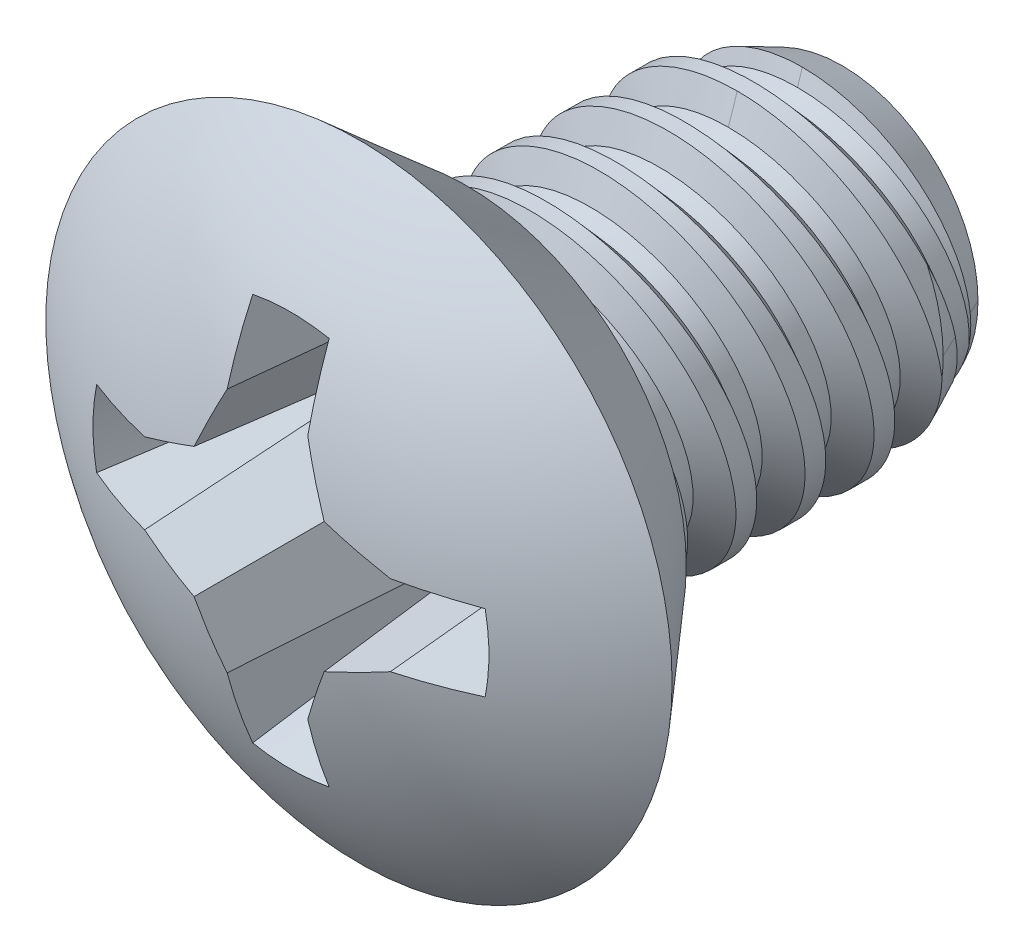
ISO-10303-21;
HEADER;
FILE_DESCRIPTION(('STEP AP214'),'2;1');
FILE_NAME('part.step','',(''),(''),'','','');
FILE_SCHEMA(('AUTOMOTIVE_DESIGN { 1 0 10303 214 1 1 1 1 }'));
ENDSEC;
DATA;
#1=APPLICATION_CONTEXT('core data for automotive mechanical design processes');
#2=APPLICATION_PROTOCOL_DEFINITION('international standard','automotive_design',2000,#1);
#3=PRODUCT_CONTEXT('',#1,'mechanical');
#4=PRODUCT('Part','Part','',(#3));
#5=PRODUCT_RELATED_PRODUCT_CATEGORY('part','',(#4));
#6=PRODUCT_DEFINITION_FORMATION('','',#4);
#7=PRODUCT_DEFINITION_CONTEXT('part definition',#1,'design');
#8=PRODUCT_DEFINITION('design','',#6,#7);
#9=PRODUCT_DEFINITION_SHAPE('','',#8);
#10=(LENGTH_UNIT() NAMED_UNIT(*) SI_UNIT(.MILLI.,.METRE.));
#11=(NAMED_UNIT(*) PLANE_ANGLE_UNIT() SI_UNIT($,.RADIAN.));
#12=(NAMED_UNIT(*) SI_UNIT($,.STERADIAN.) SOLID_ANGLE_UNIT());
#13=UNCERTAINTY_MEASURE_WITH_UNIT(LENGTH_MEASURE(1.E-05),#10,'distance_accuracy_value','');
#14=(GEOMETRIC_REPRESENTATION_CONTEXT(3) GLOBAL_UNCERTAINTY_ASSIGNED_CONTEXT((#13)) GLOBAL_UNIT_ASSIGNED_CONTEXT((#10,
#11,#12)) REPRESENTATION_CONTEXT('',''));
#15=CARTESIAN_POINT('',(0.,0.,0.));
#16=DIRECTION('',(0.,0.,1.));
#17=DIRECTION('',(1.,0.,0.));
#18=AXIS2_PLACEMENT_3D('',#15,#16,#17);
#19=CARTESIAN_POINT('',(-0.215477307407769,0.520208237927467,1.4224));
#20=DIRECTION('',(0.381227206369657,-0.920363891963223,0.0871557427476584));
#21=DIRECTION('',(0.923879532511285,0.382683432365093,0.));
#22=AXIS2_PLACEMENT_3D('',#19,#20,#21);
#23=PLANE('',#22);
#24=DIRECTION('',(0.0666626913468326,-0.0666626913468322,-0.995546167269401));
#25=VECTOR('',#24,1.);
#26=CARTESIAN_POINT('',(-0.427254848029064,0.42725484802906,1.36714737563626));
#27=LINE('',#26,#25);
#28=CARTESIAN_POINT('',(-0.427254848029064,0.427254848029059,1.36714737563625));
#29=VERTEX_POINT('',#28);
#30=CARTESIAN_POINT('',(-0.29161702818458,0.291616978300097,-0.658479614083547));
#31=VERTEX_POINT('',#30);
#32=EDGE_CURVE('E235',#29,#31,#27,.T.);
#33=ORIENTED_EDGE('',*,*,#32,.F.);
#34=CARTESIAN_POINT('',(-0.807187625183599,0.264685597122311,1.31227827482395));
#35=CARTESIAN_POINT('',(-0.744542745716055,0.291908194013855,1.32573421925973));
#36=CARTESIAN_POINT('',(-0.681559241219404,0.31906693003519,1.33703461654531));
#37=CARTESIAN_POINT('',(-0.554914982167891,0.373256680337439,1.35532431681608));
#38=CARTESIAN_POINT('',(-0.491254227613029,0.400287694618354,1.36231361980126));
#39=CARTESIAN_POINT('',(-0.42725484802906,0.427254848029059,1.36714737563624));
#40=B_SPLINE_CURVE_WITH_KNOTS('',3,(#34,#35,#36,#37,#38,#39),.UNSPECIFIED.,.F.,.F.,(4,2,4),(0.,
0.208542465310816,0.417084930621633),.UNSPECIFIED.);
#41=CARTESIAN_POINT('',(-0.807187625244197,0.264685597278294,1.31227827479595));
#42=VERTEX_POINT('',#41);
#43=EDGE_CURVE('E242',#42,#29,#40,.T.);
#44=ORIENTED_EDGE('',*,*,#43,.F.);
#45=DIRECTION('',(-0.0173337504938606,0.0871426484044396,0.996045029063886));
#46=VECTOR('',#45,1.);
#47=CARTESIAN_POINT('',(-0.780476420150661,0.130399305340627,-0.222621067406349));
#48=LINE('',#47,#46);
#49=CARTESIAN_POINT('',(-0.780476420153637,0.130399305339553,-0.222621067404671));
#50=VERTEX_POINT('',#49);
#51=EDGE_CURVE('E707',#50,#42,#48,.T.);
#52=ORIENTED_EDGE('',*,*,#51,.F.);
#53=CARTESIAN_POINT('',(-0.78047642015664,0.130399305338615,-0.222621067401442));
#54=CARTESIAN_POINT('',(-0.761689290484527,0.136268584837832,-0.242818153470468));
#55=CARTESIAN_POINT('',(-0.742826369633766,0.142176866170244,-0.262934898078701));
#56=CARTESIAN_POINT('',(-0.704892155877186,0.154101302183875,-0.302940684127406));
#57=CARTESIAN_POINT('',(-0.685820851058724,0.160117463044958,-0.322829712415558));
#58=CARTESIAN_POINT('',(-0.647516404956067,0.172254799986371,-0.362206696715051));
#59=CARTESIAN_POINT('',(-0.628284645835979,0.178375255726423,-0.381696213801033));
#60=CARTESIAN_POINT('',(-0.589469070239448,0.190799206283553,-0.420282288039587));
#61=CARTESIAN_POINT('',(-0.569885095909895,0.197102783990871,-0.439378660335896));
#62=CARTESIAN_POINT('',(-0.530148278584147,0.209989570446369,-0.477106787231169));
#63=CARTESIAN_POINT('',(-0.509992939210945,0.216574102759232,-0.495735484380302));
#64=CARTESIAN_POINT('',(-0.469061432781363,0.230082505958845,-0.532125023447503));
#65=CARTESIAN_POINT('',(-0.448285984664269,0.237005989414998,-0.549886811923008));
#66=CARTESIAN_POINT('',(-0.405706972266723,0.251393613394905,-0.584198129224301));
#67=CARTESIAN_POINT('',(-0.383898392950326,0.258860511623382,-0.60074047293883));
#68=CARTESIAN_POINT('',(-0.350177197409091,0.270634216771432,-0.623909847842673));
#69=CARTESIAN_POINT('',(-0.338746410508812,0.274662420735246,-0.631371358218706));
#70=CARTESIAN_POINT('',(-0.315489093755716,0.28295389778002,-0.645543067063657));
#71=CARTESIAN_POINT('',(-0.30366203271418,0.287217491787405,-0.652252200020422));
#72=CARTESIAN_POINT('',(-0.291617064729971,0.291616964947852,-0.658479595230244));
#73=B_SPLINE_CURVE_WITH_KNOTS('',3,(#53,#54,#55,#56,#57,#58,#59,#60,#61,#62,#63,#64,#65,#66,#67,
#68,#69,#70,#71,#72),.UNSPECIFIED.,.F.,.F.,(4,2,2,2,2,2,2,2,2,4),(0.,0.0846059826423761,
0.169216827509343,0.253381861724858,0.33758560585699,0.422243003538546,0.50680579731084,
0.59183250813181,0.634505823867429,0.677238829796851),.UNSPECIFIED.);
#74=EDGE_CURVE('E372',#50,#31,#73,.T.);
#75=ORIENTED_EDGE('',*,*,#74,.T.);
#76=EDGE_LOOP('',(#33,#44,#52,#75));
#77=FACE_BOUND('',#76,.T.);
#78=ADVANCED_FACE('F16',(#77),#23,.T.);
#79=CARTESIAN_POINT('',(-0.520208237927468,0.215477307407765,1.4224));
#80=DIRECTION('',(0.920363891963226,-0.38122720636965,0.0871557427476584));
#81=DIRECTION('',(0.382683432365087,0.923879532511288,0.));
#82=AXIS2_PLACEMENT_3D('',#79,#80,#81);
#83=PLANE('',#82);
#84=DIRECTION('',(0.0871426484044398,-0.0173337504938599,-0.996045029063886));
#85=VECTOR('',#84,1.);
#86=CARTESIAN_POINT('',(-0.264685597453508,0.807187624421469,1.3122782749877));
#87=LINE('',#86,#85);
#88=CARTESIAN_POINT('',(-0.264685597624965,0.807187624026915,1.31227827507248));
#89=VERTEX_POINT('',#88);
#90=CARTESIAN_POINT('',(-0.130399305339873,0.780476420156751,-0.222621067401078));
#91=VERTEX_POINT('',#90);
#92=EDGE_CURVE('E492',#89,#91,#87,.T.);
#93=ORIENTED_EDGE('',*,*,#92,.F.);
#94=CARTESIAN_POINT('',(-0.427254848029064,0.427254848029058,1.36714737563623));
#95=CARTESIAN_POINT('',(-0.400287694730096,0.491254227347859,1.36231361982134));
#96=CARTESIAN_POINT('',(-0.373256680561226,0.554914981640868,1.35532431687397));
#97=CARTESIAN_POINT('',(-0.319066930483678,0.681559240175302,1.33703461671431));
#98=CARTESIAN_POINT('',(-0.291908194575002,0.744542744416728,1.32573421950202));
#99=CARTESIAN_POINT('',(-0.264685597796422,0.807187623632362,1.31227827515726));
#100=B_SPLINE_CURVE_WITH_KNOTS('',3,(#94,#95,#96,#97,#98,#99),.UNSPECIFIED.,.F.,.F.,(4,2,4),(0.,
0.208542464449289,0.417084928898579),.UNSPECIFIED.);
#101=EDGE_CURVE('E239',#29,#89,#100,.T.);
#102=ORIENTED_EDGE('',*,*,#101,.F.);
#103=ORIENTED_EDGE('',*,*,#32,.T.);
#104=CARTESIAN_POINT('',(-0.291617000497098,0.291616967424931,-0.658479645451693));
#105=CARTESIAN_POINT('',(-0.287212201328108,0.303676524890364,-0.652244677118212));
#106=CARTESIAN_POINT('',(-0.282943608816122,0.315517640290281,-0.645526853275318));
#107=CARTESIAN_POINT('',(-0.274642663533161,0.338802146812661,-0.631336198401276));
#108=CARTESIAN_POINT('',(-0.270609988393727,0.350246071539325,-0.623864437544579));
#109=CARTESIAN_POINT('',(-0.25882347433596,0.384005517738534,-0.600663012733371));
#110=CARTESIAN_POINT('',(-0.251348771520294,0.405838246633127,-0.584097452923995));
#111=CARTESIAN_POINT('',(-0.236946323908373,0.448463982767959,-0.549738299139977));
#112=CARTESIAN_POINT('',(-0.230015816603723,0.469262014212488,-0.531951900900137));
#113=CARTESIAN_POINT('',(-0.216493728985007,0.510237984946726,-0.49551237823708));
#114=CARTESIAN_POINT('',(-0.20990253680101,0.530415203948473,-0.476858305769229));
#115=CARTESIAN_POINT('',(-0.197018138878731,0.570147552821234,-0.439124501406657));
#116=CARTESIAN_POINT('',(-0.190723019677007,0.589706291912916,-0.420049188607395));
#117=CARTESIAN_POINT('',(-0.178315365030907,0.62847257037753,-0.381506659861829));
#118=CARTESIAN_POINT('',(-0.172202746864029,0.647680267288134,-0.362039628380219));
#119=CARTESIAN_POINT('',(-0.160080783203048,0.685937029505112,-0.322708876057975));
#120=CARTESIAN_POINT('',(-0.154072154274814,0.704984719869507,-0.302843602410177));
#121=CARTESIAN_POINT('',(-0.142162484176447,0.742872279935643,-0.262885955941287));
#122=CARTESIAN_POINT('',(-0.136261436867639,0.761712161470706,-0.242793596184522));
#123=CARTESIAN_POINT('',(-0.13039930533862,0.78047642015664,-0.222621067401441));
#124=B_SPLINE_CURVE_WITH_KNOTS('',3,(#104,#105,#106,#107,#108,#109,#110,#111,#112,#113,#114,
#115,#116,#117,#118,#119,#120,#121,#122,#123),.UNSPECIFIED.,.F.,.F.,(4,2,2,2,2,2,2,2,2,4),(0.,
0.0427847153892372,0.0855095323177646,0.170638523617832,0.255302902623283,0.340062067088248,
0.424164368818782,0.508227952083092,0.592735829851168,0.677238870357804),.UNSPECIFIED.);
#125=EDGE_CURVE('E368',#31,#91,#124,.T.);
#126=ORIENTED_EDGE('',*,*,#125,.T.);
#127=EDGE_LOOP('',(#93,#102,#103,#126));
#128=FACE_BOUND('',#127,.T.);
#129=ADVANCED_FACE('F380',(#128),#83,.T.);
#130=CARTESIAN_POINT('',(0.520208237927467,0.215477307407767,1.4224));
#131=DIRECTION('',(-0.920363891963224,-0.381227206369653,0.0871557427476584));
#132=DIRECTION('',(0.38268343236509,-0.923879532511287,0.));
#133=AXIS2_PLACEMENT_3D('',#130,#131,#132);
#134=PLANE('',#133);
#135=DIRECTION('',(-0.0666626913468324,-0.0666626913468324,-0.995546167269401));
#136=VECTOR('',#135,1.);
#137=CARTESIAN_POINT('',(0.427254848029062,0.427254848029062,1.36714737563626));
#138=LINE('',#137,#136);
#139=CARTESIAN_POINT('',(0.427254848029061,0.427254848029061,1.36714737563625));
#140=VERTEX_POINT('',#139);
#141=CARTESIAN_POINT('',(0.291616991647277,0.291616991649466,-0.658479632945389));
#142=VERTEX_POINT('',#141);
#143=EDGE_CURVE('E624',#140,#142,#138,.T.);
#144=ORIENTED_EDGE('',*,*,#143,.F.);
#145=CARTESIAN_POINT('',(0.427254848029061,0.42725484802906,1.36714737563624));
#146=CARTESIAN_POINT('',(0.400287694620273,0.491254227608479,1.3623136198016));
#147=CARTESIAN_POINT('',(0.37325668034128,0.55491498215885,1.35532431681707));
#148=CARTESIAN_POINT('',(0.319066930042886,0.681559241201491,1.33703461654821));
#149=CARTESIAN_POINT('',(0.291908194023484,0.744542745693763,1.32573421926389));
#150=CARTESIAN_POINT('',(0.264685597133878,0.807187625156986,1.31227827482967));
#151=B_SPLINE_CURVE_WITH_KNOTS('',3,(#145,#146,#147,#148,#149,#150),.UNSPECIFIED.,.F.,.F.,(4,2,
4),(0.,0.208542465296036,0.417084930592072),.UNSPECIFIED.);
#152=CARTESIAN_POINT('',(0.264685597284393,0.807187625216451,1.3122782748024));
#153=VERTEX_POINT('',#152);
#154=EDGE_CURVE('E220',#140,#153,#151,.T.);
#155=ORIENTED_EDGE('',*,*,#154,.T.);
#156=DIRECTION('',(0.0871426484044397,0.0173337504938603,0.996045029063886));
#157=VECTOR('',#156,1.);
#158=CARTESIAN_POINT('',(0.130399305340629,0.780476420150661,-0.222621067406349));
#159=LINE('',#158,#157);
#160=CARTESIAN_POINT('',(0.130399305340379,0.780476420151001,-0.222621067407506));
#161=VERTEX_POINT('',#160);
#162=EDGE_CURVE('E215',#161,#153,#159,.T.);
#163=ORIENTED_EDGE('',*,*,#162,.F.);
#164=CARTESIAN_POINT('',(0.130399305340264,0.780476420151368,-0.222621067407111));
#165=CARTESIAN_POINT('',(0.136268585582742,0.761689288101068,-0.242818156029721));
#166=CARTESIAN_POINT('',(0.142176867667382,0.742826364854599,-0.262934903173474));
#167=CARTESIAN_POINT('',(0.154101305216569,0.704892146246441,-0.302940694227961));
#168=CARTESIAN_POINT('',(0.160117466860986,0.685820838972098,-0.322829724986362));
#169=CARTESIAN_POINT('',(0.172254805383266,0.647516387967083,-0.362206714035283));
#170=CARTESIAN_POINT('',(0.178375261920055,0.628284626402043,-0.381696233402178));
#171=CARTESIAN_POINT('',(0.190799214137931,0.589469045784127,-0.420282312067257));
#172=CARTESIAN_POINT('',(0.197102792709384,0.569885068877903,-0.439378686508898));
#173=CARTESIAN_POINT('',(0.209989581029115,0.530148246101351,-0.4771068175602));
#174=CARTESIAN_POINT('',(0.216574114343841,0.509992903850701,-0.495735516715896));
#175=CARTESIAN_POINT('',(0.230082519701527,0.469061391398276,-0.532125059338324));
#176=CARTESIAN_POINT('',(0.237006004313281,0.448285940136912,-0.549886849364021));
#177=CARTESIAN_POINT('',(0.251393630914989,0.405706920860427,-0.584198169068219));
#178=CARTESIAN_POINT('',(0.258860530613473,0.383898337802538,-0.600740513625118));
#179=CARTESIAN_POINT('',(0.270634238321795,0.350177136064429,-0.623909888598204));
#180=CARTESIAN_POINT('',(0.274662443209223,0.33874634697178,-0.631371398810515));
#181=CARTESIAN_POINT('',(0.282953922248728,0.3154890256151,-0.645543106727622));
#182=CARTESIAN_POINT('',(0.287217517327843,0.303661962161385,-0.652252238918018));
#183=CARTESIAN_POINT('',(0.291616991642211,0.291616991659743,-0.658479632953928));
#184=B_SPLINE_CURVE_WITH_KNOTS('',3,(#164,#165,#166,#167,#168,#169,#170,#171,#172,#173,#174,
#175,#176,#177,#178,#179,#180,#181,#182,#183),.UNSPECIFIED.,.F.,.F.,(4,2,2,2,2,2,2,2,2,4),(0.,
0.0846059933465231,0.169216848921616,0.253381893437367,0.337585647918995,0.42224305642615,
0.506805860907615,0.591832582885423,0.634505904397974,0.677238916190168),.UNSPECIFIED.);
#185=EDGE_CURVE('E22',#161,#142,#184,.T.);
#186=ORIENTED_EDGE('',*,*,#185,.T.);
#187=EDGE_LOOP('',(#144,#155,#163,#186));
#188=FACE_BOUND('',#187,.T.);
#189=ADVANCED_FACE('F218',(#188),#134,.T.);
#190=CARTESIAN_POINT('',(0.215477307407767,0.520208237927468,1.4224));
#191=DIRECTION('',(-0.381227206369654,-0.920363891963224,0.0871557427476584));
#192=DIRECTION('',(0.923879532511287,-0.38268343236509,0.));
#193=AXIS2_PLACEMENT_3D('',#190,#191,#192);
#194=PLANE('',#193);
#195=DIRECTION('',(-0.0173337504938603,-0.0871426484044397,-0.996045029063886));
#196=VECTOR('',#195,1.);
#197=CARTESIAN_POINT('',(0.80718762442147,0.264685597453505,1.3122782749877));
#198=LINE('',#197,#196);
#199=CARTESIAN_POINT('',(0.807187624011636,0.264685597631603,1.31227827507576));
#200=VERTEX_POINT('',#199);
#201=CARTESIAN_POINT('',(0.780476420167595,0.130399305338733,-0.22262106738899));
#202=VERTEX_POINT('',#201);
#203=EDGE_CURVE('E477',#200,#202,#198,.T.);
#204=ORIENTED_EDGE('',*,*,#203,.F.);
#205=CARTESIAN_POINT('',(0.807187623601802,0.264685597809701,1.31227827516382));
#206=CARTESIAN_POINT('',(0.744542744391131,0.291908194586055,1.32573421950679));
#207=CARTESIAN_POINT('',(0.681559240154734,0.319066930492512,1.33703461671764));
#208=CARTESIAN_POINT('',(0.554914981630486,0.373256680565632,1.35532431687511));
#209=CARTESIAN_POINT('',(0.491254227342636,0.400287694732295,1.36231361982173));
#210=CARTESIAN_POINT('',(0.42725484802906,0.427254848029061,1.36714737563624));
#211=B_SPLINE_CURVE_WITH_KNOTS('',3,(#205,#206,#207,#208,#209,#210),.UNSPECIFIED.,.F.,.F.,(4,2,
4),(0.,0.208542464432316,0.417084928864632),.UNSPECIFIED.);
#212=EDGE_CURVE('E622',#200,#140,#211,.T.);
#213=ORIENTED_EDGE('',*,*,#212,.T.);
#214=ORIENTED_EDGE('',*,*,#143,.T.);
#215=CARTESIAN_POINT('',(0.291616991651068,0.291616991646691,-0.658479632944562));
#216=CARTESIAN_POINT('',(0.303676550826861,0.287212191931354,-0.652244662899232));
#217=CARTESIAN_POINT('',(0.315517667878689,0.282943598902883,-0.645526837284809));
#218=CARTESIAN_POINT('',(0.338802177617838,0.274642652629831,-0.631336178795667));
#219=CARTESIAN_POINT('',(0.350246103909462,0.270609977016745,-0.623864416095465));
#220=CARTESIAN_POINT('',(0.38400555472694,0.258823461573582,-0.600662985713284));
#221=CARTESIAN_POINT('',(0.405838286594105,0.251348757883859,-0.584097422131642));
#222=CARTESIAN_POINT('',(0.44846402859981,0.23694630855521,-0.549738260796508));
#223=CARTESIAN_POINT('',(0.469262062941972,0.230015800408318,-0.531951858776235));
#224=CARTESIAN_POINT('',(0.51023803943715,0.216493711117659,-0.495512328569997));
#225=CARTESIAN_POINT('',(0.530415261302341,0.209902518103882,-0.476858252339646));
#226=CARTESIAN_POINT('',(0.570147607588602,0.19701812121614,-0.439124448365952));
#227=CARTESIAN_POINT('',(0.589706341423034,0.1907230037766,-0.420049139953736));
#228=CARTESIAN_POINT('',(0.628472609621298,0.178315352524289,-0.381506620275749));
#229=CARTESIAN_POINT('',(0.647680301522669,0.172202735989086,-0.362039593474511));
#230=CARTESIAN_POINT('',(0.685937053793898,0.160080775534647,-0.322708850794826));
#231=CARTESIAN_POINT('',(0.704984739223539,0.154072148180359,-0.302843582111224));
#232=CARTESIAN_POINT('',(0.742872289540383,0.142162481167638,-0.262885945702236));
#233=CARTESIAN_POINT('',(0.761712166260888,0.13626143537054,-0.242793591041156));
#234=CARTESIAN_POINT('',(0.780476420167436,0.130399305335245,-0.222621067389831));
#235=B_SPLINE_CURVE_WITH_KNOTS('',3,(#215,#216,#217,#218,#219,#220,#221,#222,#223,#224,#225,
#226,#227,#228,#229,#230,#231,#232,#233,#234),.UNSPECIFIED.,.F.,.F.,(4,2,2,2,2,2,2,2,2,4),(0.,
0.0427847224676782,0.0855095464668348,0.170638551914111,0.255302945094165,0.34006212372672,
0.424164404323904,0.508227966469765,0.592735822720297,0.677238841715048),.UNSPECIFIED.);
#236=EDGE_CURVE('E234',#142,#202,#235,.T.);
#237=ORIENTED_EDGE('',*,*,#236,.T.);
#238=EDGE_LOOP('',(#204,#213,#214,#237));
#239=FACE_BOUND('',#238,.T.);
#240=ADVANCED_FACE('F266',(#239),#194,.T.);
#241=CARTESIAN_POINT('',(0.,0.,0.00940029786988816));
#242=DIRECTION('',(0.,0.,1.));
#243=DIRECTION('',(1.,0.,0.));
#244=AXIS2_PLACEMENT_3D('',#241,#242,#243);
#245=CONICAL_SURFACE('',#244,0.99298787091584,0.715584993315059);
#246=CARTESIAN_POINT('',(0.,0.,-1.13290157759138));
#247=VERTEX_POINT('',#246);
#248=VERTEX_LOOP('',#247);
#249=FACE_BOUND('',#248,.T.);
#250=CARTESIAN_POINT('',(0.981486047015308,-0.150698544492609,0.00940029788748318));
#251=CARTESIAN_POINT('',(0.947991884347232,-0.147314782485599,-0.0292762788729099));
#252=CARTESIAN_POINT('',(0.914494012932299,-0.143931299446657,-0.0679496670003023));
#253=CARTESIAN_POINT('',(0.847490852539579,-0.137164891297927,-0.145290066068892));
#254=CARTESIAN_POINT('',(0.813985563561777,-0.133781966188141,-0.183957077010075));
#255=CARTESIAN_POINT('',(0.780476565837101,-0.130399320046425,-0.222620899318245));
#256=B_SPLINE_CURVE_WITH_KNOTS('',3,(#250,#251,#252,#253,#254,#255),.UNSPECIFIED.,.F.,.F.,(4,2,
4),(0.,0.153826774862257,0.307653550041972),.UNSPECIFIED.);
#257=CARTESIAN_POINT('',(0.981486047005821,-0.150698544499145,0.00940029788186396));
#258=VERTEX_POINT('',#257);
#259=CARTESIAN_POINT('',(0.78047656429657,-0.130399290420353,-0.222620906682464));
#260=VERTEX_POINT('',#259);
#261=EDGE_CURVE('E334',#258,#260,#256,.T.);
#262=ORIENTED_EDGE('',*,*,#261,.F.);
#263=CARTESIAN_POINT('',(0.,0.,0.00940029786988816));
#264=DIRECTION('',(0.,0.,1.));
#265=DIRECTION('',(1.,0.,0.));
#266=AXIS2_PLACEMENT_3D('',#263,#264,#265);
#267=CIRCLE('',#266,0.99298787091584);
#268=CARTESIAN_POINT('',(0.981486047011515,0.150698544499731,0.00940029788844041));
#269=VERTEX_POINT('',#268);
#270=EDGE_CURVE('E596',#269,#258,#267,.F.);
#271=ORIENTED_EDGE('',*,*,#270,.F.);
#272=CARTESIAN_POINT('',(0.780476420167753,0.130399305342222,-0.222621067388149));
#273=CARTESIAN_POINT('',(0.813985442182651,0.133781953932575,-0.183957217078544));
#274=CARTESIAN_POINT('',(0.847490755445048,0.137164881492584,-0.145290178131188));
#275=CARTESIAN_POINT('',(0.914493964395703,0.143931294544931,-0.067949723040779));
#276=CARTESIAN_POINT('',(0.947991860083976,0.147314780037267,-0.029276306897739));
#277=CARTESIAN_POINT('',(0.981486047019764,0.150698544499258,0.00940029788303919));
#278=B_SPLINE_CURVE_WITH_KNOTS('',3,(#272,#273,#274,#275,#276,#277),.UNSPECIFIED.,.F.,.F.,(4,2,
4),(0.,0.15382688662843,0.3076537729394),.UNSPECIFIED.);
#279=EDGE_CURVE('E274',#202,#269,#278,.T.);
#280=ORIENTED_EDGE('',*,*,#279,.F.);
#281=ORIENTED_EDGE('',*,*,#236,.F.);
#282=ORIENTED_EDGE('',*,*,#185,.F.);
#283=CARTESIAN_POINT('',(0.150698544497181,0.981486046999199,0.00940029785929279));
#284=CARTESIAN_POINT('',(0.147314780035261,0.947991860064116,-0.0292763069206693));
#285=CARTESIAN_POINT('',(0.143931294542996,0.914493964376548,-0.0679497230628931));
#286=CARTESIAN_POINT('',(0.137164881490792,0.847490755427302,-0.14529017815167));
#287=CARTESIAN_POINT('',(0.133781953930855,0.813985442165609,-0.18395721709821));
#288=CARTESIAN_POINT('',(0.130399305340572,0.780476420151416,-0.222621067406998));
#289=B_SPLINE_CURVE_WITH_KNOTS('',3,(#283,#284,#285,#286,#287,#288),.UNSPECIFIED.,.F.,.F.,(4,2,
4),(0.,0.153826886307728,0.307653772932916),.UNSPECIFIED.);
#290=CARTESIAN_POINT('',(0.150698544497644,0.981486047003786,0.0094002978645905));
#291=VERTEX_POINT('',#290);
#292=EDGE_CURVE('E225',#291,#161,#289,.T.);
#293=ORIENTED_EDGE('',*,*,#292,.F.);
#294=CARTESIAN_POINT('',(0.,0.,0.00940029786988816));
#295=DIRECTION('',(0.,0.,1.));
#296=DIRECTION('',(1.,0.,0.));
#297=AXIS2_PLACEMENT_3D('',#294,#295,#296);
#298=CIRCLE('',#297,0.99298787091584);
#299=CARTESIAN_POINT('',(-0.150698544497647,0.981486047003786,0.00940029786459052));
#300=VERTEX_POINT('',#299);
#301=EDGE_CURVE('E597',#300,#291,#298,.F.);
#302=ORIENTED_EDGE('',*,*,#301,.F.);
#303=CARTESIAN_POINT('',(-0.130399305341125,0.780476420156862,-0.222621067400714));
#304=CARTESIAN_POINT('',(-0.133781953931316,0.813985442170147,-0.183957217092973));
#305=CARTESIAN_POINT('',(-0.137164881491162,0.847490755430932,-0.14529017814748));
#306=CARTESIAN_POINT('',(-0.143931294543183,0.914493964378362,-0.0679497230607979));
#307=CARTESIAN_POINT('',(-0.147314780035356,0.947991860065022,-0.0292763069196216));
#308=CARTESIAN_POINT('',(-0.150698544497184,0.981486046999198,0.00940029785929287));
#309=B_SPLINE_CURVE_WITH_KNOTS('',3,(#303,#304,#305,#306,#307,#308),.UNSPECIFIED.,.F.,.F.,(4,2,
4),(0.,0.153826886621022,0.307653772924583),.UNSPECIFIED.);
#310=EDGE_CURVE('E350',#91,#300,#309,.T.);
#311=ORIENTED_EDGE('',*,*,#310,.F.);
#312=ORIENTED_EDGE('',*,*,#125,.F.);
#313=ORIENTED_EDGE('',*,*,#74,.F.);
#314=CARTESIAN_POINT('',(-0.981486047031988,0.150698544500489,0.00940029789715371));
#315=CARTESIAN_POINT('',(-0.947991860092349,0.14731478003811,-0.0292763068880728));
#316=CARTESIAN_POINT('',(-0.914493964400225,0.143931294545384,-0.0679497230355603));
#317=CARTESIAN_POINT('',(-0.847490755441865,0.13716488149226,-0.145290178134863));
#318=CARTESIAN_POINT('',(-0.813985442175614,0.133781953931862,-0.183957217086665));
#319=CARTESIAN_POINT('',(-0.780476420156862,0.130399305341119,-0.222621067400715));
#320=B_SPLINE_CURVE_WITH_KNOTS('',3,(#314,#315,#316,#317,#318,#319),.UNSPECIFIED.,.F.,.F.,(4,2,
4),(0.,0.153826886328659,0.307653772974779),.UNSPECIFIED.);
#321=CARTESIAN_POINT('',(-0.981486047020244,0.150698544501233,0.00940029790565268));
#322=VERTEX_POINT('',#321);
#323=EDGE_CURVE('E358',#322,#50,#320,.T.);
#324=ORIENTED_EDGE('',*,*,#323,.F.);
#325=CARTESIAN_POINT('',(0.,0.,0.00940029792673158));
#326=DIRECTION('',(0.,0.,1.));
#327=DIRECTION('',(1.,0.,0.));
#328=AXIS2_PLACEMENT_3D('',#325,#326,#327);
#329=CIRCLE('',#328,0.992987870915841);
#330=CARTESIAN_POINT('',(-0.981486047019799,-0.150698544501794,0.0094002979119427));
#331=VERTEX_POINT('',#330);
#332=EDGE_CURVE('E495',#322,#331,#329,.T.);
#333=ORIENTED_EDGE('',*,*,#332,.T.);
#334=CARTESIAN_POINT('',(-0.780476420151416,-0.130399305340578,-0.222621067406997));
#335=CARTESIAN_POINT('',(-0.813985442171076,-0.133781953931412,-0.183957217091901));
#336=CARTESIAN_POINT('',(-0.847490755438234,-0.137164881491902,-0.145290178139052));
#337=CARTESIAN_POINT('',(-0.914493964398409,-0.143931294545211,-0.0679497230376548));
#338=CARTESIAN_POINT('',(-0.947991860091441,-0.147314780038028,-0.0292763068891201));
#339=CARTESIAN_POINT('',(-0.981486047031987,-0.1506985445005,0.00940029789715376));
#340=B_SPLINE_CURVE_WITH_KNOTS('',3,(#334,#335,#336,#337,#338,#339),.UNSPECIFIED.,.F.,.F.,(4,2,
4),(0.,0.153826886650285,0.30765377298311),.UNSPECIFIED.);
#341=CARTESIAN_POINT('',(-0.780476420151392,-0.130399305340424,-0.222621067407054));
#342=VERTEX_POINT('',#341);
#343=EDGE_CURVE('E317',#342,#331,#340,.T.);
#344=ORIENTED_EDGE('',*,*,#343,.F.);
#345=CARTESIAN_POINT('',(-0.291616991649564,-0.291616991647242,-0.658479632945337));
#346=CARTESIAN_POINT('',(-0.30367655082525,-0.287212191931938,-0.652244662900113));
#347=CARTESIAN_POINT('',(-0.315517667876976,-0.2829435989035,-0.645526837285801));
#348=CARTESIAN_POINT('',(-0.338802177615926,-0.27464265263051,-0.631336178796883));
#349=CARTESIAN_POINT('',(-0.350246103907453,-0.270609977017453,-0.623864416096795));
#350=CARTESIAN_POINT('',(-0.384005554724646,-0.258823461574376,-0.600662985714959));
#351=CARTESIAN_POINT('',(-0.405838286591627,-0.251348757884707,-0.58409742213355));
#352=CARTESIAN_POINT('',(-0.448464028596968,-0.236946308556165,-0.549738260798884));
#353=CARTESIAN_POINT('',(-0.46926206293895,-0.230015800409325,-0.531951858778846));
#354=CARTESIAN_POINT('',(-0.510238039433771,-0.21649371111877,-0.495512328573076));
#355=CARTESIAN_POINT('',(-0.530415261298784,-0.209902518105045,-0.476858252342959));
#356=CARTESIAN_POINT('',(-0.570147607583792,-0.197018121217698,-0.439124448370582));
#357=CARTESIAN_POINT('',(-0.58970634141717,-0.190723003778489,-0.420049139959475));
#358=CARTESIAN_POINT('',(-0.628472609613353,-0.178315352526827,-0.381506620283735));
#359=CARTESIAN_POINT('',(-0.647680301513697,-0.172202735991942,-0.362039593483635));
#360=CARTESIAN_POINT('',(-0.685937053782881,-0.160080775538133,-0.32270885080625));
#361=CARTESIAN_POINT('',(-0.704984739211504,-0.154072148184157,-0.302843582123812));
#362=CARTESIAN_POINT('',(-0.742872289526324,-0.142162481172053,-0.262885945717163));
#363=CARTESIAN_POINT('',(-0.761712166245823,-0.13626143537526,-0.242793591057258));
#364=CARTESIAN_POINT('',(-0.780476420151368,-0.13039930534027,-0.222621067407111));
#365=B_SPLINE_CURVE_WITH_KNOTS('',3,(#345,#346,#347,#348,#349,#350,#351,#352,#353,#354,#355,
#356,#357,#358,#359,#360,#361,#362,#363,#364),.UNSPECIFIED.,.F.,.F.,(4,2,2,2,2,2,2,2,2,4),(0.,
0.0427847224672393,0.0855095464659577,0.170638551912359,0.255302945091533,0.340062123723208,
0.424164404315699,0.50822796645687,0.592735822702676,0.677238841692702),.UNSPECIFIED.);
#366=CARTESIAN_POINT('',(-0.291616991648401,-0.291616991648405,-0.658479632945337));
#367=VERTEX_POINT('',#366);
#368=EDGE_CURVE('E325',#367,#342,#365,.T.);
#369=ORIENTED_EDGE('',*,*,#368,.F.);
#370=CARTESIAN_POINT('',(-0.130399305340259,-0.780476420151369,-0.222621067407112));
#371=CARTESIAN_POINT('',(-0.136268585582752,-0.76168928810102,-0.242818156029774));
#372=CARTESIAN_POINT('',(-0.142176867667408,-0.742826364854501,-0.262934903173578));
#373=CARTESIAN_POINT('',(-0.154101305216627,-0.704892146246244,-0.302940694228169));
#374=CARTESIAN_POINT('',(-0.16011746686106,-0.685820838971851,-0.32282972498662));
#375=CARTESIAN_POINT('',(-0.172254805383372,-0.647516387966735,-0.362206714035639));
#376=CARTESIAN_POINT('',(-0.178375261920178,-0.628284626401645,-0.381696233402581));
#377=CARTESIAN_POINT('',(-0.190799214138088,-0.589469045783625,-0.420282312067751));
#378=CARTESIAN_POINT('',(-0.197102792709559,-0.569885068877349,-0.439378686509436));
#379=CARTESIAN_POINT('',(-0.209989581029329,-0.530148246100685,-0.477106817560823));
#380=CARTESIAN_POINT('',(-0.216574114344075,-0.509992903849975,-0.495735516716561));
#381=CARTESIAN_POINT('',(-0.230082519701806,-0.469061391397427,-0.532125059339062));
#382=CARTESIAN_POINT('',(-0.237006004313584,-0.448285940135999,-0.54988684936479));
#383=CARTESIAN_POINT('',(-0.251393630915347,-0.405706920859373,-0.584198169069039));
#384=CARTESIAN_POINT('',(-0.258860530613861,-0.383898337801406,-0.600740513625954));
#385=CARTESIAN_POINT('',(-0.270634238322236,-0.35017713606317,-0.623909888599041));
#386=CARTESIAN_POINT('',(-0.274662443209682,-0.338746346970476,-0.631371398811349));
#387=CARTESIAN_POINT('',(-0.282953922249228,-0.315489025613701,-0.645543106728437));
#388=CARTESIAN_POINT('',(-0.287217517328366,-0.303661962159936,-0.652252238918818));
#389=CARTESIAN_POINT('',(-0.291616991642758,-0.291616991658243,-0.658479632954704));
#390=B_SPLINE_CURVE_WITH_KNOTS('',3,(#370,#371,#372,#373,#374,#375,#376,#377,#378,#379,#380,
#381,#382,#383,#384,#385,#386,#387,#388,#389),.UNSPECIFIED.,.F.,.F.,(4,2,2,2,2,2,2,2,2,4),(0.,
0.0846059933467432,0.169216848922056,0.253381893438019,0.33758564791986,0.422243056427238,
0.506805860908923,0.59183258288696,0.63450590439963,0.677238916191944),.UNSPECIFIED.);
#391=CARTESIAN_POINT('',(-0.130399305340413,-0.780476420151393,-0.222621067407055));
#392=VERTEX_POINT('',#391);
#393=EDGE_CURVE('E343',#392,#367,#390,.T.);
#394=ORIENTED_EDGE('',*,*,#393,.F.);
#395=CARTESIAN_POINT('',(-0.150698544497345,-0.981486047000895,0.0094002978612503));
#396=CARTESIAN_POINT('',(-0.147314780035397,-0.947991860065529,-0.0292763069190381));
#397=CARTESIAN_POINT('',(-0.143931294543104,-0.914493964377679,-0.0679497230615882));
#398=CARTESIAN_POINT('',(-0.137164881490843,-0.847490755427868,-0.145290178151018));
#399=CARTESIAN_POINT('',(-0.133781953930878,-0.813985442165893,-0.183957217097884));
#400=CARTESIAN_POINT('',(-0.130399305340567,-0.780476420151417,-0.222621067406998));
#401=B_SPLINE_CURVE_WITH_KNOTS('',3,(#395,#396,#397,#398,#399,#400),.UNSPECIFIED.,.F.,.F.,(4,2,
4),(0.,0.153826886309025,0.307653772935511),.UNSPECIFIED.);
#402=CARTESIAN_POINT('',(-0.150698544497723,-0.981486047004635,0.00940029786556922));
#403=VERTEX_POINT('',#402);
#404=EDGE_CURVE('E292',#403,#392,#401,.T.);
#405=ORIENTED_EDGE('',*,*,#404,.F.);
#406=CARTESIAN_POINT('',(0.,0.,0.00940029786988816));
#407=DIRECTION('',(0.,0.,1.));
#408=DIRECTION('',(1.,0.,0.));
#409=AXIS2_PLACEMENT_3D('',#406,#407,#408);
#410=CIRCLE('',#409,0.99298787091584);
#411=CARTESIAN_POINT('',(0.15069854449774,-0.981486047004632,0.00940029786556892));
#412=VERTEX_POINT('',#411);
#413=EDGE_CURVE('E377',#412,#403,#410,.F.);
#414=ORIENTED_EDGE('',*,*,#413,.F.);
#415=CARTESIAN_POINT('',(0.130399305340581,-0.780476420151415,-0.222621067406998));
#416=CARTESIAN_POINT('',(0.133781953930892,-0.813985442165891,-0.183957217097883));
#417=CARTESIAN_POINT('',(0.137164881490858,-0.847490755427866,-0.145290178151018));
#418=CARTESIAN_POINT('',(0.14393129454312,-0.914493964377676,-0.0679497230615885));
#419=CARTESIAN_POINT('',(0.147314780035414,-0.947991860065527,-0.0292763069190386));
#420=CARTESIAN_POINT('',(0.150698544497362,-0.981486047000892,0.00940029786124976));
#421=B_SPLINE_CURVE_WITH_KNOTS('',3,(#415,#416,#417,#418,#419,#420),.UNSPECIFIED.,.F.,.F.,(4,2,
4),(0.,0.153826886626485,0.30765377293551),.UNSPECIFIED.);
#422=CARTESIAN_POINT('',(0.130399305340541,-0.780476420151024,-0.222621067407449));
#423=VERTEX_POINT('',#422);
#424=EDGE_CURVE('E284',#423,#412,#421,.T.);
#425=ORIENTED_EDGE('',*,*,#424,.F.);
#426=CARTESIAN_POINT('',(0.291616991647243,-0.291616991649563,-0.658479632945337));
#427=CARTESIAN_POINT('',(0.287212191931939,-0.30367655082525,-0.652244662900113));
#428=CARTESIAN_POINT('',(0.282943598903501,-0.315517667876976,-0.645526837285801));
#429=CARTESIAN_POINT('',(0.274642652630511,-0.338802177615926,-0.631336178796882));
#430=CARTESIAN_POINT('',(0.270609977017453,-0.350246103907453,-0.623864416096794));
#431=CARTESIAN_POINT('',(0.258823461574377,-0.384005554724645,-0.600662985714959));
#432=CARTESIAN_POINT('',(0.251348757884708,-0.405838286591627,-0.58409742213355));
#433=CARTESIAN_POINT('',(0.236946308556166,-0.448464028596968,-0.549738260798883));
#434=CARTESIAN_POINT('',(0.230015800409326,-0.46926206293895,-0.531951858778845));
#435=CARTESIAN_POINT('',(0.216493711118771,-0.510238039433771,-0.495512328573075));
#436=CARTESIAN_POINT('',(0.209902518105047,-0.530415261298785,-0.476858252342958));
#437=CARTESIAN_POINT('',(0.197018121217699,-0.570147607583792,-0.439124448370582));
#438=CARTESIAN_POINT('',(0.190723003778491,-0.58970634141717,-0.420049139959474));
#439=CARTESIAN_POINT('',(0.178315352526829,-0.628472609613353,-0.381506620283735));
#440=CARTESIAN_POINT('',(0.172202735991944,-0.647680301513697,-0.362039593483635));
#441=CARTESIAN_POINT('',(0.160080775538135,-0.685937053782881,-0.32270885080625));
#442=CARTESIAN_POINT('',(0.154072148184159,-0.704984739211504,-0.302843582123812));
#443=CARTESIAN_POINT('',(0.142162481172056,-0.742872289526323,-0.262885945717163));
#444=CARTESIAN_POINT('',(0.136261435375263,-0.761712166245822,-0.242793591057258));
#445=CARTESIAN_POINT('',(0.130399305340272,-0.780476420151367,-0.222621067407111));
#446=B_SPLINE_CURVE_WITH_KNOTS('',3,(#426,#427,#428,#429,#430,#431,#432,#433,#434,#435,#436,
#437,#438,#439,#440,#441,#442,#443,#444,#445),.UNSPECIFIED.,.F.,.F.,(4,2,2,2,2,2,2,2,2,4),(0.,
0.0427847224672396,0.085509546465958,0.170638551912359,0.255302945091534,0.340062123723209,
0.4241644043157,0.50822796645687,0.592735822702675,0.677238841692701),.UNSPECIFIED.);
#447=CARTESIAN_POINT('',(0.291616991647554,-0.291616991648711,-0.658479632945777));
#448=VERTEX_POINT('',#447);
#449=EDGE_CURVE('E308',#448,#423,#446,.T.);
#450=ORIENTED_EDGE('',*,*,#449,.F.);
#451=CARTESIAN_POINT('',(0.780476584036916,-0.130399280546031,-0.222620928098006));
#452=CARTESIAN_POINT('',(0.761689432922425,-0.136268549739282,-0.24281801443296));
#453=CARTESIAN_POINT('',(0.742826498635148,-0.142176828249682,-0.262934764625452));
#454=CARTESIAN_POINT('',(0.704892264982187,-0.154101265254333,-0.302940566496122));
#455=CARTESIAN_POINT('',(0.685820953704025,-0.160117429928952,-0.322829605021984));
#456=CARTESIAN_POINT('',(0.647516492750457,-0.172254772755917,-0.362206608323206));
#457=CARTESIAN_POINT('',(0.628284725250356,-0.178375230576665,-0.38169613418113));
#458=CARTESIAN_POINT('',(0.589469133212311,-0.190799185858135,-0.420282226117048));
#459=CARTESIAN_POINT('',(0.569885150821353,-0.197102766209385,-0.439378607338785));
#460=CARTESIAN_POINT('',(0.530148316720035,-0.209989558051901,-0.477106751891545));
#461=CARTESIAN_POINT('',(0.509992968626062,-0.216574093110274,-0.495735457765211));
#462=CARTESIAN_POINT('',(0.469061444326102,-0.230082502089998,-0.53212501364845));
#463=CARTESIAN_POINT('',(0.448285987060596,-0.237005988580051,-0.54988681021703));
#464=CARTESIAN_POINT('',(0.405706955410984,-0.251393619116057,-0.584198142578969));
#465=CARTESIAN_POINT('',(0.383898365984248,-0.258860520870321,-0.60074049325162));
#466=CARTESIAN_POINT('',(0.350177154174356,-0.270634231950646,-0.623909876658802));
#467=CARTESIAN_POINT('',(0.338746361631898,-0.274662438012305,-0.631371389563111));
#468=CARTESIAN_POINT('',(0.315489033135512,-0.282953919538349,-0.645543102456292));
#469=CARTESIAN_POINT('',(0.303661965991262,-0.287217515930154,-0.652252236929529));
#470=CARTESIAN_POINT('',(0.291616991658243,-0.291616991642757,-0.658479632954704));
#471=B_SPLINE_CURVE_WITH_KNOTS('',3,(#451,#452,#453,#454,#455,#456,#457,#458,#459,#460,#461,
#462,#463,#464,#465,#466,#467,#468,#469,#470),.UNSPECIFIED.,.F.,.F.,(4,2,2,2,2,2,2,2,2,4),(0.,
0.0846060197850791,0.169216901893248,0.253381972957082,0.337585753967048,0.422243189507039,
0.506806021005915,0.591832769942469,0.634506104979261,0.677239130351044),.UNSPECIFIED.);
#472=EDGE_CURVE('E300',#260,#448,#471,.T.);
#473=ORIENTED_EDGE('',*,*,#472,.F.);
#474=EDGE_LOOP('',(#262,#271,#280,#281,#282,#293,#302,#311,#312,#313,#324,#333,#344,#369,#394,
#405,#414,#425,#450,#473));
#475=FACE_BOUND('',#474,.T.);
#476=ADVANCED_FACE('F231',(#249,#475),#245,.F.);
#477=CARTESIAN_POINT('',(0.,0.,-2.20060984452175));
#478=DIRECTION('',(0.,0.,1.));
#479=DIRECTION('',(1.,0.,0.));
#480=AXIS2_PLACEMENT_3D('',#477,#478,#479);
#481=CONICAL_SURFACE('',#480,1.01489532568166,0.436332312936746);
#482=CARTESIAN_POINT('',(0.,1.01416335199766,-2.20217956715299));
#483=CARTESIAN_POINT('',(0.0459310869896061,1.01418866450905,-2.20217617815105));
#484=CARTESIAN_POINT('',(0.0918450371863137,1.01079575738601,-2.20271186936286));
#485=CARTESIAN_POINT('',(0.182664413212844,0.997369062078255,-2.2048349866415));
#486=CARTESIAN_POINT('',(0.227569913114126,0.987335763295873,-2.20642233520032));
#487=CARTESIAN_POINT('',(0.321413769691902,0.959010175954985,-2.21090966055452));
#488=CARTESIAN_POINT('',(0.37006332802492,0.939775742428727,-2.21395951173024));
#489=CARTESIAN_POINT('',(0.463433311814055,0.893565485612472,-2.22130398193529));
#490=CARTESIAN_POINT('',(0.508153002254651,0.866588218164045,-2.2255988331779));
#491=CARTESIAN_POINT('',(0.592706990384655,0.805492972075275,-2.23535514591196));
#492=CARTESIAN_POINT('',(0.632508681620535,0.771331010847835,-2.24082379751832));
#493=CARTESIAN_POINT('',(0.705817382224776,0.696973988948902,-2.25277206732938));
#494=CARTESIAN_POINT('',(0.739324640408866,0.656779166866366,-2.25925164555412));
#495=CARTESIAN_POINT('',(0.799517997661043,0.57099996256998,-2.27314173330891));
#496=CARTESIAN_POINT('',(0.826120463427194,0.525358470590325,-2.28056216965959));
#497=CARTESIAN_POINT('',(0.871301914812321,0.430366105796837,-2.29608665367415));
#498=CARTESIAN_POINT('',(0.889878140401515,0.381013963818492,-2.3041909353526));
#499=CARTESIAN_POINT('',(0.919384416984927,0.276907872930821,-2.32138657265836));
#500=CARTESIAN_POINT('',(0.929789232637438,0.222007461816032,-2.33050797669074));
#501=CARTESIAN_POINT('',(0.938013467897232,0.138999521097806,-2.34439264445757));
#502=CARTESIAN_POINT('',(0.939522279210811,0.111193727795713,-2.34905919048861));
#503=CARTESIAN_POINT('',(0.940070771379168,0.0555644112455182,-2.35842757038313));
#504=CARTESIAN_POINT('',(0.939110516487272,0.027740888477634,-2.36312940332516));
#505=CARTESIAN_POINT('',(0.936917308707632,-6.99459501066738E-12,-2.36783424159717));
#506=B_SPLINE_CURVE_WITH_KNOTS('',3,(#482,#483,#484,#485,#486,#487,#488,#489,#490,#491,#492,
#493,#494,#495,#496,#497,#498,#499,#500,#501,#502,#503,#504,#505),.UNSPECIFIED.,.F.,.F.,(4,2,2,
2,2,2,2,2,2,2,2,4),(0.,0.137635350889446,0.275260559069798,0.431714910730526,0.588198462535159,
0.745669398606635,0.903134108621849,1.06242539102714,1.22177140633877,1.39067157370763,
1.47528375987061,1.55989374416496),.UNSPECIFIED.);
#507=CARTESIAN_POINT('',(0.,1.01416335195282,-2.20217956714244));
#508=VERTEX_POINT('',#507);
#509=CARTESIAN_POINT('',(0.936917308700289,-3.50766830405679E-12,-2.36783424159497));
#510=VERTEX_POINT('',#509);
#511=EDGE_CURVE('E591',#508,#510,#506,.T.);
#512=ORIENTED_EDGE('',*,*,#511,.T.);
#513=DIRECTION('',(-0.422618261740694,0.,-0.906307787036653));
#514=VECTOR('',#513,1.);
#515=CARTESIAN_POINT('',(232689.562475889,0.,499000.));
#516=LINE('',#515,#514);
#517=CARTESIAN_POINT('',(0.892167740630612,0.,-2.46380000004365));
#518=VERTEX_POINT('',#517);
#519=EDGE_CURVE('E589',#510,#518,#516,.T.);
#520=ORIENTED_EDGE('',*,*,#519,.T.);
#521=CARTESIAN_POINT('',(0.,0.,-2.46380000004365));
#522=DIRECTION('',(0.,0.,1.));
#523=DIRECTION('',(1.,0.,0.));
#524=AXIS2_PLACEMENT_3D('',#521,#522,#523);
#525=CIRCLE('',#524,0.892167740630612);
#526=CARTESIAN_POINT('',(-0.892167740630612,0.,-2.46380000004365));
#527=VERTEX_POINT('',#526);
#528=EDGE_CURVE('E586',#518,#527,#525,.T.);
#529=ORIENTED_EDGE('',*,*,#528,.T.);
#530=DIRECTION('',(0.422618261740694,0.,-0.906307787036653));
#531=VECTOR('',#530,1.);
#532=CARTESIAN_POINT('',(-232689.562475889,2.84962527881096E-11,499000.));
#533=LINE('',#532,#531);
#534=CARTESIAN_POINT('',(-0.936917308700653,-4.14046345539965E-12,-2.36783424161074));
#535=VERTEX_POINT('',#534);
#536=EDGE_CURVE('E592',#527,#535,#533,.F.);
#537=ORIENTED_EDGE('',*,*,#536,.T.);
#538=CARTESIAN_POINT('',(-0.936917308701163,-4.13008745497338E-12,-2.36783424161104));
#539=CARTESIAN_POINT('',(-0.941183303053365,0.0533977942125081,-2.3587761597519));
#540=CARTESIAN_POINT('',(-0.940799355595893,0.107154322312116,-2.34972359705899));
#541=CARTESIAN_POINT('',(-0.930925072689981,0.213842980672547,-2.33186994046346));
#542=CARTESIAN_POINT('',(-0.921438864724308,0.266775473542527,-2.32306873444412));
#543=CARTESIAN_POINT('',(-0.893556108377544,0.370328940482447,-2.30594898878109));
#544=CARTESIAN_POINT('',(-0.875158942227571,0.420949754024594,-2.29763048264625));
#545=CARTESIAN_POINT('',(-0.829957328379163,0.518394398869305,-2.28169614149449));
#546=CARTESIAN_POINT('',(-0.803154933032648,0.565219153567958,-2.27408013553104));
#547=CARTESIAN_POINT('',(-0.742093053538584,0.653367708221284,-2.25980197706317));
#548=CARTESIAN_POINT('',(-0.707890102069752,0.694729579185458,-2.25313319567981));
#549=CARTESIAN_POINT('',(-0.632852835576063,0.771119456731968,-2.24085732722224));
#550=CARTESIAN_POINT('',(-0.592018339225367,0.80614729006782,-2.23525026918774));
#551=CARTESIAN_POINT('',(-0.505415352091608,0.868404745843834,-2.22530915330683));
#552=CARTESIAN_POINT('',(-0.459713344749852,0.895724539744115,-2.22096035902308));
#553=CARTESIAN_POINT('',(-0.364272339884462,0.942290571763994,-2.21356033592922));
#554=CARTESIAN_POINT('',(-0.314534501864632,0.961539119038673,-2.21050873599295));
#555=CARTESIAN_POINT('',(-0.220800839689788,0.988929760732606,-2.20617011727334));
#556=CARTESIAN_POINT('',(-0.177188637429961,0.998369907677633,-2.20467669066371));
#557=CARTESIAN_POINT('',(-0.0890569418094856,1.01099663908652,-2.202680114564));
#558=CARTESIAN_POINT('',(-0.0445376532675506,1.01418461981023,-2.20217674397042));
#559=CARTESIAN_POINT('',(0.,1.01416335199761,-2.20217956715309));
#560=B_SPLINE_CURVE_WITH_KNOTS('',3,(#538,#539,#540,#541,#542,#543,#544,#545,#546,#547,#548,
#549,#550,#551,#552,#553,#554,#555,#556,#557,#558,#559),.UNSPECIFIED.,.F.,.F.,(4,2,2,2,2,2,2,2,
2,2,4),(0.,0.162775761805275,0.325477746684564,0.488191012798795,0.650864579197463,
0.812336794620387,0.973813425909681,1.13331430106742,1.29276951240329,1.42626269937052,
1.55972607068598),.UNSPECIFIED.);
#561=EDGE_CURVE('E595',#535,#508,#560,.T.);
#562=ORIENTED_EDGE('',*,*,#561,.T.);
#563=EDGE_LOOP('',(#512,#520,#529,#537,#562));
#564=FACE_BOUND('',#563,.T.);
#565=ADVANCED_FACE('F265',(#564),#481,.T.);
#566=CARTESIAN_POINT('',(0.,0.,-2.4638));
#567=DIRECTION('',(0.,0.,1.));
#568=DIRECTION('',(1.,0.,0.));
#569=AXIS2_PLACEMENT_3D('',#566,#567,#568);
#570=PLANE('',#569);
#571=CARTESIAN_POINT('',(0.,0.,-2.46380000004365));
#572=DIRECTION('',(0.,0.,1.));
#573=DIRECTION('',(1.,0.,0.));
#574=AXIS2_PLACEMENT_3D('',#571,#572,#573);
#575=CIRCLE('',#574,0.892167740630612);
#576=EDGE_CURVE('E585',#527,#518,#575,.T.);
#577=ORIENTED_EDGE('',*,*,#576,.F.);
#578=ORIENTED_EDGE('',*,*,#528,.F.);
#579=EDGE_LOOP('',(#577,#578));
#580=FACE_BOUND('',#579,.T.);
#581=ADVANCED_FACE('F1013',(#580),#570,.F.);
#582=CARTESIAN_POINT('',(0.,0.0221818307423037,-2.40847504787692));
#583=DIRECTION('',(0.,0.203304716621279,-0.979115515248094));
#584=DIRECTION('',(0.,0.979115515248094,0.203304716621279));
#585=AXIS2_PLACEMENT_3D('',#582,#583,#584);
#586=CONICAL_SURFACE('',#585,1.01374675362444,1.04719755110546);
#587=CARTESIAN_POINT('',(0.936917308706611,-7.01530655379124E-12,-2.36783424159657));
#588=CARTESIAN_POINT('',(0.933819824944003,-0.0389605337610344,-2.37444212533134));
#589=CARTESIAN_POINT('',(0.928357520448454,-0.0774423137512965,-2.38100149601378));
#590=CARTESIAN_POINT('',(0.912702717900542,-0.153451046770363,-2.3940236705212));
#591=CARTESIAN_POINT('',(0.90250988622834,-0.190977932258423,-2.40048646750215));
#592=CARTESIAN_POINT('',(0.889951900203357,-0.228025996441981,-2.40690074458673));
#593=B_SPLINE_CURVE_WITH_KNOTS('',3,(#587,#588,#589,#590,#591,#592),.UNSPECIFIED.,.F.,.F.,(4,2,
4),(0.,0.118251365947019,0.236511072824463),.UNSPECIFIED.);
#594=CARTESIAN_POINT('',(0.889951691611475,-0.228026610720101,-2.4069008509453));
#595=VERTEX_POINT('',#594);
#596=EDGE_CURVE('E572',#510,#595,#593,.T.);
#597=ORIENTED_EDGE('',*,*,#596,.F.);
#598=ORIENTED_EDGE('',*,*,#511,.F.);
#599=DIRECTION('',(0.,-0.949591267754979,0.313490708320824));
#600=VECTOR('',#599,1.);
#601=CARTESIAN_POINT('',(0.,499000.,-164737.863545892));
#602=LINE('',#601,#600);
#603=CARTESIAN_POINT('',(0.,0.915221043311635,-2.16951551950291));
#604=VERTEX_POINT('',#603);
#605=EDGE_CURVE('E582',#604,#508,#602,.F.);
#606=ORIENTED_EDGE('',*,*,#605,.F.);
#607=CARTESIAN_POINT('',(0.,0.011526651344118,-2.35715970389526));
#608=DIRECTION('',(0.,-0.203304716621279,0.979115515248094));
#609=DIRECTION('',(0.,-0.979115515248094,-0.203304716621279));
#610=AXIS2_PLACEMENT_3D('',#607,#608,#609);
#611=CIRCLE('',#610,0.922970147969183);
#612=EDGE_CURVE('E1162',#595,#604,#611,.T.);
#613=ORIENTED_EDGE('',*,*,#612,.F.);
#614=EDGE_LOOP('',(#597,#598,#606,#613));
#615=FACE_BOUND('',#614,.T.);
#616=ADVANCED_FACE('F1005',(#615),#586,.T.);
#617=CARTESIAN_POINT('',(0.,0.0221818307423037,-2.40847504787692));
#618=DIRECTION('',(0.,0.203304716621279,-0.979115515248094));
#619=DIRECTION('',(0.,0.979115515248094,0.203304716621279));
#620=AXIS2_PLACEMENT_3D('',#617,#618,#619);
#621=CONICAL_SURFACE('',#620,1.01374675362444,1.04719755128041);
#622=ORIENTED_EDGE('',*,*,#561,.F.);
#623=CARTESIAN_POINT('',(-0.889951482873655,-0.228027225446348,-2.40690095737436));
#624=CARTESIAN_POINT('',(-0.902509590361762,-0.190978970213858,-2.40048664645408));
#625=CARTESIAN_POINT('',(-0.912702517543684,-0.153451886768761,-2.39402381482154));
#626=CARTESIAN_POINT('',(-0.928357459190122,-0.0774427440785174,-2.3810015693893));
#627=CARTESIAN_POINT('',(-0.933819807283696,-0.0389607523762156,-2.37444216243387));
#628=CARTESIAN_POINT('',(-0.936917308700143,-4.15082699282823E-12,-2.36783424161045));
#629=B_SPLINE_CURVE_WITH_KNOTS('',3,(#623,#624,#625,#626,#627,#628),.UNSPECIFIED.,.F.,.F.,(4,2,
4),(0.,0.118260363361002,0.236512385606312),.UNSPECIFIED.);
#630=CARTESIAN_POINT('',(-0.889951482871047,-0.228027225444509,-2.40690095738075));
#631=VERTEX_POINT('',#630);
#632=EDGE_CURVE('E1102',#631,#535,#629,.T.);
#633=ORIENTED_EDGE('',*,*,#632,.F.);
#634=CARTESIAN_POINT('',(0.,0.0115266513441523,-2.35715970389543));
#635=DIRECTION('',(0.,-0.203304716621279,0.979115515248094));
#636=DIRECTION('',(0.,-0.979115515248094,-0.203304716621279));
#637=AXIS2_PLACEMENT_3D('',#634,#635,#636);
#638=CIRCLE('',#637,0.922970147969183);
#639=EDGE_CURVE('E1160',#604,#631,#638,.T.);
#640=ORIENTED_EDGE('',*,*,#639,.F.);
#641=ORIENTED_EDGE('',*,*,#605,.T.);
#642=EDGE_LOOP('',(#622,#633,#640,#641));
#643=FACE_BOUND('',#642,.T.);
#644=ADVANCED_FACE('F997',(#643),#621,.T.);
#645=CARTESIAN_POINT('',(0.,0.,-2.03482943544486));
#646=DIRECTION('',(0.,0.,1.));
#647=DIRECTION('',(1.,0.,0.));
#648=AXIS2_PLACEMENT_3D('',#645,#646,#647);
#649=CONICAL_SURFACE('',#648,1.092199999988,0.436332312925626);
#650=CARTESIAN_POINT('',(-0.889951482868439,-0.228027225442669,-2.40690095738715));
#651=CARTESIAN_POINT('',(-0.882779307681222,-0.254502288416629,-2.40770722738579));
#652=CARTESIAN_POINT('',(-0.874465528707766,-0.280655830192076,-2.40842241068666));
#653=CARTESIAN_POINT('',(-0.855613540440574,-0.332153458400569,-2.40966023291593));
#654=CARTESIAN_POINT('',(-0.84507531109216,-0.357497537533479,-2.41018287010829));
#655=CARTESIAN_POINT('',(-0.810195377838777,-0.432101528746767,-2.41144700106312));
#656=CARTESIAN_POINT('',(-0.782599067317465,-0.479894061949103,-2.41188350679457));
#657=CARTESIAN_POINT('',(-0.72044726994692,-0.568779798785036,-2.41195507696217));
#658=CARTESIAN_POINT('',(-0.686096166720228,-0.61001726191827,-2.4116111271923));
#659=CARTESIAN_POINT('',(-0.611002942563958,-0.686005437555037,-2.41031041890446));
#660=CARTESIAN_POINT('',(-0.57027977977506,-0.720774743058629,-2.40935545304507));
#661=CARTESIAN_POINT('',(-0.510331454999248,-0.763682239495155,-2.40781569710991));
#662=CARTESIAN_POINT('',(-0.493336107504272,-0.775020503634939,-2.40736580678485));
#663=CARTESIAN_POINT('',(-0.475991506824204,-0.785774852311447,-2.40690098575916));
#664=B_SPLINE_CURVE_WITH_KNOTS('',3,(#650,#651,#652,#653,#654,#655,#656,#657,#658,#659,#660,
#661,#662,#663),.UNSPECIFIED.,.F.,.F.,(4,2,2,2,2,2,4),(0.,0.0822689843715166,0.164538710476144,
0.329198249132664,0.489482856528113,0.649299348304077,0.710557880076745),.UNSPECIFIED.);
#665=CARTESIAN_POINT('',(-0.47599099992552,-0.785775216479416,-2.40690088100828));
#666=VERTEX_POINT('',#665);
#667=EDGE_CURVE('E1096',#631,#666,#664,.T.);
#668=ORIENTED_EDGE('',*,*,#667,.F.);
#669=ORIENTED_EDGE('',*,*,#632,.T.);
#670=ORIENTED_EDGE('',*,*,#536,.F.);
#671=ORIENTED_EDGE('',*,*,#576,.T.);
#672=ORIENTED_EDGE('',*,*,#519,.F.);
#673=ORIENTED_EDGE('',*,*,#596,.T.);
#674=CARTESIAN_POINT('',(0.475990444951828,-0.785775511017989,-2.40690095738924));
#675=CARTESIAN_POINT('',(0.499330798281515,-0.771295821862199,-2.40752532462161));
#676=CARTESIAN_POINT('',(0.522014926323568,-0.755787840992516,-2.40812414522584));
#677=CARTESIAN_POINT('',(0.565931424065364,-0.722837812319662,-2.40922698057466));
#678=CARTESIAN_POINT('',(0.587163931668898,-0.705395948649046,-2.40973100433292));
#679=CARTESIAN_POINT('',(0.648470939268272,-0.65035839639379,-2.41103527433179));
#680=CARTESIAN_POINT('',(0.686167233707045,-0.610043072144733,-2.41162809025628));
#681=CARTESIAN_POINT('',(0.752711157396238,-0.525206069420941,-2.41203827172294));
#682=CARTESIAN_POINT('',(0.781842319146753,-0.480904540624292,-2.41188445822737));
#683=CARTESIAN_POINT('',(0.832313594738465,-0.388182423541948,-2.41081459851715));
#684=CARTESIAN_POINT('',(0.853673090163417,-0.339772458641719,-2.40990046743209));
#685=CARTESIAN_POINT('',(0.877944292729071,-0.269548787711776,-2.40811557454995));
#686=CARTESIAN_POINT('',(0.88430870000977,-0.248877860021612,-2.40753685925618));
#687=CARTESIAN_POINT('',(0.889951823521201,-0.228025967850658,-2.40690091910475));
#688=B_SPLINE_CURVE_WITH_KNOTS('',3,(#674,#675,#676,#677,#678,#679,#680,#681,#682,#683,#684,
#685,#686,#687),.UNSPECIFIED.,.F.,.F.,(4,2,2,2,2,2,4),(0.,0.0823638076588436,0.164719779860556,
0.329388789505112,0.487753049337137,0.645719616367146,0.710573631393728),.UNSPECIFIED.);
#689=CARTESIAN_POINT('',(0.475990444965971,-0.785775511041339,-2.40690095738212));
#690=VERTEX_POINT('',#689);
#691=EDGE_CURVE('E560',#690,#595,#688,.T.);
#692=ORIENTED_EDGE('',*,*,#691,.F.);
#693=CARTESIAN_POINT('',(1.02212127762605,-2.37895861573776E-12,-2.18511374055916));
#694=CARTESIAN_POINT('',(1.01772462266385,-0.0308035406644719,-2.19453961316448));
#695=CARTESIAN_POINT('',(1.01200139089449,-0.0614452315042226,-2.20382735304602));
#696=CARTESIAN_POINT('',(0.997902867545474,-0.122219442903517,-2.22208036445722));
#697=CARTESIAN_POINT('',(0.989526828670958,-0.152351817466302,-2.23104554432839));
#698=CARTESIAN_POINT('',(0.960392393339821,-0.241783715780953,-2.2574104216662));
#699=CARTESIAN_POINT('',(0.935642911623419,-0.300009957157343,-2.27424646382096));
#700=CARTESIAN_POINT('',(0.876144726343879,-0.411193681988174,-2.30585351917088));
#701=CARTESIAN_POINT('',(0.841460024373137,-0.464182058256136,-2.32063687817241));
#702=CARTESIAN_POINT('',(0.762851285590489,-0.563320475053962,-2.34788701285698));
#703=CARTESIAN_POINT('',(0.718952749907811,-0.609488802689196,-2.36036000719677));
#704=CARTESIAN_POINT('',(0.641391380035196,-0.677289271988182,-2.37845642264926));
#705=CARTESIAN_POINT('',(0.610191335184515,-0.701572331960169,-2.38488005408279));
#706=CARTESIAN_POINT('',(0.545052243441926,-0.746501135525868,-2.39668638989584));
#707=CARTESIAN_POINT('',(0.511110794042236,-0.76714363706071,-2.40206816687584));
#708=CARTESIAN_POINT('',(0.475990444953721,-0.785775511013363,-2.40690095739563));
#709=B_SPLINE_CURVE_WITH_KNOTS('',3,(#693,#694,#695,#696,#697,#698,#699,#700,#701,#702,#703,
#704,#705,#706,#707,#708),.UNSPECIFIED.,.F.,.F.,(4,2,2,2,2,2,2,4),(0.,0.0974789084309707,
0.194985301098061,0.390335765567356,0.584455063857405,0.778044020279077,0.89795706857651,
1.01797637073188),.UNSPECIFIED.);
#710=CARTESIAN_POINT('',(1.02212127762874,-1.18944004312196E-12,-2.18511374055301));
#711=VERTEX_POINT('',#710);
#712=EDGE_CURVE('E567',#711,#690,#709,.T.);
#713=ORIENTED_EDGE('',*,*,#712,.F.);
#714=DIRECTION('',(-0.422618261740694,0.,-0.906307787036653));
#715=VECTOR('',#714,1.);
#716=CARTESIAN_POINT('',(232689.562475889,0.,499000.));
#717=LINE('',#716,#715);
#718=CARTESIAN_POINT('',(1.09219999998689,0.,-2.03482943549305));
#719=VERTEX_POINT('',#718);
#720=EDGE_CURVE('E552',#719,#711,#717,.T.);
#721=ORIENTED_EDGE('',*,*,#720,.F.);
#722=CARTESIAN_POINT('',(0.,0.,-2.03482943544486));
#723=DIRECTION('',(0.,0.,1.));
#724=DIRECTION('',(1.,0.,0.));
#725=AXIS2_PLACEMENT_3D('',#722,#723,#724);
#726=CIRCLE('',#725,1.092199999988);
#727=CARTESIAN_POINT('',(1.08482436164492,-0.126715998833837,-2.03482943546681));
#728=VERTEX_POINT('',#727);
#729=EDGE_CURVE('E568',#719,#728,#726,.F.);
#730=ORIENTED_EDGE('',*,*,#729,.T.);
#731=CARTESIAN_POINT('',(1.08482436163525,-0.126715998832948,-2.0348294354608));
#732=CARTESIAN_POINT('',(1.07247899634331,-0.188443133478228,-2.0458733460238));
#733=CARTESIAN_POINT('',(1.05476419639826,-0.249102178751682,-2.05682124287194));
#734=CARTESIAN_POINT('',(1.00927293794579,-0.366633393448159,-2.07819810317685));
#735=CARTESIAN_POINT('',(0.981494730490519,-0.423504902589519,-2.08862697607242));
#736=CARTESIAN_POINT('',(0.916572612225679,-0.531764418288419,-2.10863050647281));
#737=CARTESIAN_POINT('',(0.87943273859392,-0.583154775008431,-2.11820552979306));
#738=CARTESIAN_POINT('',(0.796827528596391,-0.678931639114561,-2.13617321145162));
#739=CARTESIAN_POINT('',(0.751367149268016,-0.723322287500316,-2.14456656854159));
#740=CARTESIAN_POINT('',(0.653969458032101,-0.803280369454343,-2.15977316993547));
#741=CARTESIAN_POINT('',(0.602118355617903,-0.838949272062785,-2.16660451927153));
#742=CARTESIAN_POINT('',(0.492964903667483,-0.901065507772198,-2.17855362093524));
#743=CARTESIAN_POINT('',(0.435661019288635,-0.927510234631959,-2.18367088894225));
#744=CARTESIAN_POINT('',(0.316357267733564,-0.970633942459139,-2.19203890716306));
#745=CARTESIAN_POINT('',(0.254300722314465,-0.987163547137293,-2.1952610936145));
#746=CARTESIAN_POINT('',(0.159753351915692,-1.00375386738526,-2.19849849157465));
#747=CARTESIAN_POINT('',(0.127957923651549,-1.0079166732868,-2.19931165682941));
#748=CARTESIAN_POINT('',(0.0641140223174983,-1.0134735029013,-2.20039758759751));
#749=CARTESIAN_POINT('',(0.0320655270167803,-1.01486728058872,-2.20067030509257));
#750=CARTESIAN_POINT('',(0.,-1.01486723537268,-2.20067008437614));
#751=B_SPLINE_CURVE_WITH_KNOTS('',3,(#731,#732,#733,#734,#735,#736,#737,#738,#739,#740,#741,
#742,#743,#744,#745,#746,#747,#748,#749,#750),.UNSPECIFIED.,.F.,.F.,(4,2,2,2,2,2,2,2,2,4),(0.,
0.191494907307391,0.38302311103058,0.574468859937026,0.765800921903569,0.954788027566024,
1.14382848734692,1.33564973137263,1.4317726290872,1.52790406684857),.UNSPECIFIED.);
#752=CARTESIAN_POINT('',(0.,-1.01486723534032,-2.20067008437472));
#753=VERTEX_POINT('',#752);
#754=EDGE_CURVE('E571',#728,#753,#751,.T.);
#755=ORIENTED_EDGE('',*,*,#754,.T.);
#756=CARTESIAN_POINT('',(0.,-1.01486723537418,-2.20067008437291));
#757=CARTESIAN_POINT('',(-0.0306250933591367,-1.01486732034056,-2.2006702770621));
#758=CARTESIAN_POINT('',(-0.0612354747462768,-1.01359600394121,-2.20042153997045));
#759=CARTESIAN_POINT('',(-0.12223550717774,-1.00852601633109,-2.19943071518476));
#760=CARTESIAN_POINT('',(-0.152625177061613,-1.00472756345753,-2.19868867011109));
#761=CARTESIAN_POINT('',(-0.243061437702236,-0.989584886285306,-2.19573328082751));
#762=CARTESIAN_POINT('',(-0.302501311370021,-0.974493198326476,-2.19279064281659));
#763=CARTESIAN_POINT('',(-0.418008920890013,-0.93475865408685,-2.18507531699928));
#764=CARTESIAN_POINT('',(-0.474072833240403,-0.910105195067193,-2.1803005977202));
#765=CARTESIAN_POINT('',(-0.581249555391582,-0.851997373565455,-2.16910909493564));
#766=CARTESIAN_POINT('',(-0.632363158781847,-0.818544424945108,-2.16269257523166));
#767=CARTESIAN_POINT('',(-0.728802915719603,-0.743409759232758,-2.14837657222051));
#768=CARTESIAN_POINT('',(-0.774060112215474,-0.701642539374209,-2.14046172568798));
#769=CARTESIAN_POINT('',(-0.856967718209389,-0.611288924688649,-2.12346777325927));
#770=CARTESIAN_POINT('',(-0.89461247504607,-0.562697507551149,-2.11438781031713));
#771=CARTESIAN_POINT('',(-0.961862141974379,-0.459209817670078,-2.09520283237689));
#772=CARTESIAN_POINT('',(-0.991318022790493,-0.404219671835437,-2.08508290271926));
#773=CARTESIAN_POINT('',(-1.04050501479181,-0.290259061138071,-2.06428287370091));
#774=CARTESIAN_POINT('',(-1.06025775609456,-0.231297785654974,-2.05360407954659));
#775=CARTESIAN_POINT('',(-1.07853744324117,-0.156436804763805,-2.04015381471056));
#776=CARTESIAN_POINT('',(-1.08183612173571,-0.141603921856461,-2.03749393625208));
#777=CARTESIAN_POINT('',(-1.0848243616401,-0.126715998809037,-2.03482943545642));
#778=B_SPLINE_CURVE_WITH_KNOTS('',3,(#756,#757,#758,#759,#760,#761,#762,#763,#764,#765,#766,
#767,#768,#769,#770,#771,#772,#773,#774,#775,#776,#777),.UNSPECIFIED.,.F.,.F.,(4,2,2,2,2,2,2,2,
2,2,4),(0.,0.0918187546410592,0.183629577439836,0.366877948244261,0.550330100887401,
0.733752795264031,0.919169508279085,1.10472340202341,1.29346101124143,1.48177595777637,
1.52804060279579),.UNSPECIFIED.);
#779=CARTESIAN_POINT('',(-1.08482436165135,-0.12671599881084,-2.03482943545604));
#780=VERTEX_POINT('',#779);
#781=EDGE_CURVE('E579',#753,#780,#778,.T.);
#782=ORIENTED_EDGE('',*,*,#781,.T.);
#783=CARTESIAN_POINT('',(0.,0.,-2.03482943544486));
#784=DIRECTION('',(0.,0.,1.));
#785=DIRECTION('',(1.,0.,0.));
#786=AXIS2_PLACEMENT_3D('',#783,#784,#785);
#787=CIRCLE('',#786,1.092199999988);
#788=CARTESIAN_POINT('',(-1.092199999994,0.,-2.03482943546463));
#789=VERTEX_POINT('',#788);
#790=EDGE_CURVE('E575',#780,#789,#787,.F.);
#791=ORIENTED_EDGE('',*,*,#790,.T.);
#792=DIRECTION('',(0.422618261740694,0.,-0.906307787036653));
#793=VECTOR('',#792,1.);
#794=CARTESIAN_POINT('',(-232689.562475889,-5.75825948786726E-09,499000.));
#795=LINE('',#794,#793);
#796=CARTESIAN_POINT('',(-1.02212127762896,3.62231857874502E-13,-2.18511374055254));
#797=VERTEX_POINT('',#796);
#798=EDGE_CURVE('E555',#797,#789,#795,.F.);
#799=ORIENTED_EDGE('',*,*,#798,.F.);
#800=CARTESIAN_POINT('',(-1.0221212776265,7.49754157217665E-13,-2.1851137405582));
#801=CARTESIAN_POINT('',(-1.0177246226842,-0.0308035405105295,-2.19453961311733));
#802=CARTESIAN_POINT('',(-1.01200139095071,-0.0614452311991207,-2.20382735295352));
#803=CARTESIAN_POINT('',(-0.997902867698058,-0.122219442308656,-2.22208036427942));
#804=CARTESIAN_POINT('',(-0.98952682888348,-0.152351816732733,-2.23104554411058));
#805=CARTESIAN_POINT('',(-0.960392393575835,-0.241783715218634,-2.25741042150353));
#806=CARTESIAN_POINT('',(-0.935642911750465,-0.300009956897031,-2.27424646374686));
#807=CARTESIAN_POINT('',(-0.876144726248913,-0.411193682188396,-2.3058535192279));
#808=CARTESIAN_POINT('',(-0.841460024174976,-0.464182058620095,-2.32063687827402));
#809=CARTESIAN_POINT('',(-0.762851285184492,-0.563320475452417,-2.34788701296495));
#810=CARTESIAN_POINT('',(-0.718952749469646,-0.609488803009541,-2.36036000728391));
#811=CARTESIAN_POINT('',(-0.641391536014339,-0.67728913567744,-2.37845638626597));
#812=CARTESIAN_POINT('',(-0.61019166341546,-0.701572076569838,-2.38487998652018));
#813=CARTESIAN_POINT('',(-0.545052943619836,-0.746500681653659,-2.39668627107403));
#814=CARTESIAN_POINT('',(-0.511111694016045,-0.767143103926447,-2.40206802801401));
#815=CARTESIAN_POINT('',(-0.475991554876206,-0.785774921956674,-2.40690080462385));
#816=B_SPLINE_CURVE_WITH_KNOTS('',3,(#800,#801,#802,#803,#804,#805,#806,#807,#808,#809,#810,
#811,#812,#813,#814,#815),.UNSPECIFIED.,.F.,.F.,(4,2,2,2,2,2,2,4),(0.,0.097478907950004,
0.194985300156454,0.39033576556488,0.584455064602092,0.778044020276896,0.897956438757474,
1.01797510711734),.UNSPECIFIED.);
#817=EDGE_CURVE('E578',#797,#666,#816,.T.);
#818=ORIENTED_EDGE('',*,*,#817,.T.);
#819=EDGE_LOOP('',(#668,#669,#670,#671,#672,#673,#692,#713,#721,#730,#755,#782,#791,#799,#818));
#820=FACE_BOUND('',#819,.T.);
#821=ADVANCED_FACE('F989',(#820),#649,.T.);
#822=CARTESIAN_POINT('',(0.,-0.101196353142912,-1.81428571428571));
#823=DIRECTION('',(0.,-0.203304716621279,0.979115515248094));
#824=DIRECTION('',(0.,-0.979115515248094,-0.203304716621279));
#825=AXIS2_PLACEMENT_3D('',#822,#823,#824);
#826=CYLINDRICAL_SURFACE('',#825,0.922970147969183);
#827=CARTESIAN_POINT('',(0.,-0.0115266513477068,-2.24613499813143));
#828=DIRECTION('',(0.,-0.203304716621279,0.979115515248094));
#829=DIRECTION('',(0.,-0.979115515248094,-0.203304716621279));
#830=AXIS2_PLACEMENT_3D('',#827,#828,#829);
#831=CIRCLE('',#830,0.922970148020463);
#832=EDGE_CURVE('E563',#690,#666,#831,.T.);
#833=ORIENTED_EDGE('',*,*,#832,.F.);
#834=ORIENTED_EDGE('',*,*,#691,.T.);
#835=ORIENTED_EDGE('',*,*,#612,.T.);
#836=ORIENTED_EDGE('',*,*,#639,.T.);
#837=ORIENTED_EDGE('',*,*,#667,.T.);
#838=EDGE_LOOP('',(#833,#834,#835,#836,#837));
#839=FACE_BOUND('',#838,.T.);
#840=ADVANCED_FACE('F981',(#839),#826,.T.);
#841=CARTESIAN_POINT('',(0.,0.,-2.03482943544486));
#842=DIRECTION('',(0.,0.,1.));
#843=DIRECTION('',(1.,0.,0.));
#844=AXIS2_PLACEMENT_3D('',#841,#842,#843);
#845=CONICAL_SURFACE('',#844,1.092199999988,0.436332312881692);
#846=ORIENTED_EDGE('',*,*,#798,.T.);
#847=CARTESIAN_POINT('',(0.,0.,-2.0348294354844));
#848=DIRECTION('',(0.,0.,1.));
#849=DIRECTION('',(1.,0.,0.));
#850=AXIS2_PLACEMENT_3D('',#847,#848,#849);
#851=CIRCLE('',#850,1.0922);
#852=CARTESIAN_POINT('',(-0.98625714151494,0.469252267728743,-2.0348294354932));
#853=VERTEX_POINT('',#852);
#854=EDGE_CURVE('E1173',#853,#789,#851,.T.);
#855=ORIENTED_EDGE('',*,*,#854,.F.);
#856=CARTESIAN_POINT('',(-1.02212127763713,-2.47347984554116E-12,-2.18511374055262));
#857=CARTESIAN_POINT('',(-1.02668869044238,0.032030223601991,-2.17531350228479));
#858=CARTESIAN_POINT('',(-1.02981888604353,0.064200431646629,-2.16537485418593));
#859=CARTESIAN_POINT('',(-1.03321079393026,0.128631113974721,-2.14527926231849));
#860=CARTESIAN_POINT('',(-1.03347193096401,0.160891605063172,-2.13512227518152));
#861=CARTESIAN_POINT('',(-1.03000110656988,0.25634105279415,-2.1047873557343));
#862=CARTESIAN_POINT('',(-1.02217768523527,0.319369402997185,-2.08438688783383));
#863=CARTESIAN_POINT('',(-1.00263367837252,0.410861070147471,-2.05427791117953));
#864=CARTESIAN_POINT('',(-0.995057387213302,0.440249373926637,-2.0445278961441));
#865=CARTESIAN_POINT('',(-0.98625714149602,0.469252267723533,-2.034829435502));
#866=B_SPLINE_CURVE_WITH_KNOTS('',3,(#856,#857,#858,#859,#860,#861,#862,#863,#864,#865),
.UNSPECIFIED.,.F.,.F.,(4,2,2,2,4),(0.,0.101344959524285,0.202710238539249,0.401779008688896,
0.49729371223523),.UNSPECIFIED.);
#867=EDGE_CURVE('E566',#797,#853,#866,.T.);
#868=ORIENTED_EDGE('',*,*,#867,.F.);
#869=EDGE_LOOP('',(#846,#855,#868));
#870=FACE_BOUND('',#869,.T.);
#871=ADVANCED_FACE('F973',(#870),#845,.T.);
#872=CARTESIAN_POINT('',(0.,0.,-2.03482943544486));
#873=DIRECTION('',(0.,0.,1.));
#874=DIRECTION('',(1.,0.,0.));
#875=AXIS2_PLACEMENT_3D('',#872,#873,#874);
#876=CONICAL_SURFACE('',#875,1.092199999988,0.436332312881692);
#877=CARTESIAN_POINT('',(0.98625714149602,0.469252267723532,-2.034829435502));
#878=CARTESIAN_POINT('',(0.995654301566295,0.43824155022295,-2.04519722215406));
#879=CARTESIAN_POINT('',(1.00365640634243,0.406845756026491,-2.0556086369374));
#880=CARTESIAN_POINT('',(1.01683255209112,0.343458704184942,-2.07644826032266));
#881=CARTESIAN_POINT('',(1.02200557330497,0.311467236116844,-2.08687647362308));
#882=CARTESIAN_POINT('',(1.03307827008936,0.216076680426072,-2.1176877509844));
#883=CARTESIAN_POINT('',(1.0348775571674,0.152109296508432,-2.13798340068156));
#884=CARTESIAN_POINT('',(1.02929427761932,0.0588466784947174,-2.16702932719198));
#885=CARTESIAN_POINT('',(1.02631591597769,0.0293431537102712,-2.17613754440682));
#886=CARTESIAN_POINT('',(1.02212127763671,-5.40398653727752E-12,-2.18511374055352));
#887=B_SPLINE_CURVE_WITH_KNOTS('',3,(#877,#878,#879,#880,#881,#882,#883,#884,#885,#886),
.UNSPECIFIED.,.F.,.F.,(4,2,2,2,4),(0.,0.101991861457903,0.204020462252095,0.404334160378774,
0.49728912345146),.UNSPECIFIED.);
#888=CARTESIAN_POINT('',(0.9862571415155,0.469252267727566,-2.03482943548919));
#889=VERTEX_POINT('',#888);
#890=EDGE_CURVE('E554',#889,#711,#887,.T.);
#891=ORIENTED_EDGE('',*,*,#890,.F.);
#892=CARTESIAN_POINT('',(0.,0.,-2.0348294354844));
#893=DIRECTION('',(0.,0.,1.));
#894=DIRECTION('',(1.,0.,0.));
#895=AXIS2_PLACEMENT_3D('',#892,#893,#894);
#896=CIRCLE('',#895,1.0922);
#897=EDGE_CURVE('E1134',#719,#889,#896,.T.);
#898=ORIENTED_EDGE('',*,*,#897,.F.);
#899=ORIENTED_EDGE('',*,*,#720,.T.);
#900=EDGE_LOOP('',(#891,#898,#899));
#901=FACE_BOUND('',#900,.T.);
#902=ADVANCED_FACE('F965',(#901),#876,.T.);
#903=CARTESIAN_POINT('',(0.,-0.0389377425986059,-2.1141231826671));
#904=DIRECTION('',(0.,-0.203304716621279,0.979115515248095));
#905=DIRECTION('',(0.,-0.979115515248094,-0.203304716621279));
#906=AXIS2_PLACEMENT_3D('',#903,#904,#905);
#907=CONICAL_SURFACE('',#906,1.15649843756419,1.04719755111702);
#908=ORIENTED_EDGE('',*,*,#817,.F.);
#909=ORIENTED_EDGE('',*,*,#867,.T.);
#910=CARTESIAN_POINT('',(0.98625714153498,0.4692522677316,-2.03482943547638));
#911=CARTESIAN_POINT('',(0.97290995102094,0.497303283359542,-2.02813269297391));
#912=CARTESIAN_POINT('',(0.958363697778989,0.52479095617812,-2.02153470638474));
#913=CARTESIAN_POINT('',(0.926951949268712,0.578471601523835,-2.00858548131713));
#914=CARTESIAN_POINT('',(0.910086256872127,0.604664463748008,-2.00223426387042));
#915=CARTESIAN_POINT('',(0.856145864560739,0.681022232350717,-1.98363107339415));
#916=CARTESIAN_POINT('',(0.815717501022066,0.728988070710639,-1.97182435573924));
#917=CARTESIAN_POINT('',(0.727112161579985,0.817388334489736,-1.94989269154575));
#918=CARTESIAN_POINT('',(0.67894783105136,0.857834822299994,-1.93976505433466));
#919=CARTESIAN_POINT('',(0.576149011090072,0.929994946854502,-1.92158451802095));
#920=CARTESIAN_POINT('',(0.521518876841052,0.961714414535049,-1.9135302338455));
#921=CARTESIAN_POINT('',(0.408975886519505,1.01459172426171,-1.9000459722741));
#922=CARTESIAN_POINT('',(0.351199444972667,1.03602272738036,-1.89454825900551));
#923=CARTESIAN_POINT('',(0.232681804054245,1.06889675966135,-1.8860962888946));
#924=CARTESIAN_POINT('',(0.17194050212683,1.08033944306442,-1.88314212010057));
#925=CARTESIAN_POINT('',(0.0509519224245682,1.09265961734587,-1.87996070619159));
#926=CARTESIAN_POINT('',(-0.00926607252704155,1.09380802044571,-1.87966353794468));
#927=CARTESIAN_POINT('',(-0.129026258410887,1.08621000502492,-1.88162640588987));
#928=CARTESIAN_POINT('',(-0.18856852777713,1.07746474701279,-1.88388614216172));
#929=CARTESIAN_POINT('',(-0.30479851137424,1.05049026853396,-1.89083149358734));
#930=CARTESIAN_POINT('',(-0.36150548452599,1.03233866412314,-1.89549725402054));
#931=CARTESIAN_POINT('',(-0.471033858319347,0.987186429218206,-1.90704284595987));
#932=CARTESIAN_POINT('',(-0.523855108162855,0.960185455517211,-1.9139227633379));
#933=CARTESIAN_POINT('',(-0.624969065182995,0.897718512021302,-1.92973215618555));
#934=CARTESIAN_POINT('',(-0.673184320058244,0.862134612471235,-1.93869011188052));
#935=CARTESIAN_POINT('',(-0.762985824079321,0.783775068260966,-1.95825450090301));
#936=CARTESIAN_POINT('',(-0.804572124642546,0.740999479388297,-1.96886092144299));
#937=CARTESIAN_POINT('',(-0.870937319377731,0.660598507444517,-1.98861130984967));
#938=CARTESIAN_POINT('',(-0.89734708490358,0.624236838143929,-1.99748686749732));
#939=CARTESIAN_POINT('',(-0.945418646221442,0.548715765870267,-2.0157852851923));
#940=CARTESIAN_POINT('',(-0.967088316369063,0.509561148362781,-2.02520720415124));
#941=CARTESIAN_POINT('',(-0.98625714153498,0.469252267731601,-2.03482943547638));
#942=B_SPLINE_CURVE_WITH_KNOTS('',3,(#910,#911,#912,#913,#914,#915,#916,#917,#918,#919,#920,
#921,#922,#923,#924,#925,#926,#927,#928,#929,#930,#931,#932,#933,#934,#935,#936,#937,#938,#939,
#940,#941),.UNSPECIFIED.,.F.,.F.,(4,2,2,2,2,2,2,2,2,2,2,2,2,2,2,4),(0.,0.095277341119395,
0.190562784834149,0.381060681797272,0.571250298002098,0.761312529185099,0.94600313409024,
1.13070013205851,1.31052175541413,1.49032228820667,1.66866228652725,1.84700920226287,
2.02796222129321,2.20891383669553,2.34601757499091,2.48289179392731),.UNSPECIFIED.);
#943=EDGE_CURVE('E1125',#889,#853,#942,.T.);
#944=ORIENTED_EDGE('',*,*,#943,.F.);
#945=ORIENTED_EDGE('',*,*,#890,.T.);
#946=ORIENTED_EDGE('',*,*,#712,.T.);
#947=ORIENTED_EDGE('',*,*,#832,.T.);
#948=EDGE_LOOP('',(#908,#909,#944,#945,#946,#947));
#949=FACE_BOUND('',#948,.T.);
#950=ADVANCED_FACE('F957',(#949),#907,.T.);
#951=CARTESIAN_POINT('',(0.,0.,-2.4638));
#952=DIRECTION('',(0.,0.,1.));
#953=DIRECTION('',(1.,0.,0.));
#954=AXIS2_PLACEMENT_3D('',#951,#952,#953);
#955=CYLINDRICAL_SURFACE('',#954,1.0922);
#956=ORIENTED_EDGE('',*,*,#897,.T.);
#957=ORIENTED_EDGE('',*,*,#943,.T.);
#958=ORIENTED_EDGE('',*,*,#854,.T.);
#959=ORIENTED_EDGE('',*,*,#790,.F.);
#960=CARTESIAN_POINT('',(0.,1.0922,-1.77437055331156));
#961=CARTESIAN_POINT('',(-0.0301767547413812,1.09220010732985,-1.77437067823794));
#962=CARTESIAN_POINT('',(-0.0603390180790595,1.09094854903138,-1.77462108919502));
#963=CARTESIAN_POINT('',(-0.120446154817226,1.08595753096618,-1.77562064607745));
#964=CARTESIAN_POINT('',(-0.150391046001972,1.0822182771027,-1.77636975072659));
#965=CARTESIAN_POINT('',(-0.239501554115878,1.06731238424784,-1.77935828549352));
#966=CARTESIAN_POINT('',(-0.298069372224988,1.05245746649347,-1.78233895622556));
#967=CARTESIAN_POINT('',(-0.411871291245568,1.01335656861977,-1.79021274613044));
#968=CARTESIAN_POINT('',(-0.467102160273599,0.989101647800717,-1.79510768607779));
#969=CARTESIAN_POINT('',(-0.572686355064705,0.931950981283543,-1.80669878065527));
#970=CARTESIAN_POINT('',(-0.6230400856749,0.8990559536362,-1.81339478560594));
#971=CARTESIAN_POINT('',(-0.718026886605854,0.825224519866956,-1.82851798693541));
#972=CARTESIAN_POINT('',(-0.76259407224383,0.784207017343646,-1.8369626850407));
#973=CARTESIAN_POINT('',(-0.844233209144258,0.695559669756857,-1.85535178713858));
#974=CARTESIAN_POINT('',(-0.881302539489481,0.647927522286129,-1.8652967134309));
#975=CARTESIAN_POINT('',(-0.94762487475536,0.546488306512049,-1.88665951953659));
#976=CARTESIAN_POINT('',(-0.976718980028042,0.492582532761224,-1.8981014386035));
#977=CARTESIAN_POINT('',(-1.02544043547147,0.380893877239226,-1.9220408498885));
#978=CARTESIAN_POINT('',(-1.04507281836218,0.323113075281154,-1.9345377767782));
#979=CARTESIAN_POINT('',(-1.07054691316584,0.220957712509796,-1.95686357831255));
#980=CARTESIAN_POINT('',(-1.07866623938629,0.177097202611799,-1.966519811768));
#981=CARTESIAN_POINT('',(-1.08948792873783,0.0888179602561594,-1.98610891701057));
#982=CARTESIAN_POINT('',(-1.09219632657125,0.0443999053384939,-1.99604146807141));
#983=CARTESIAN_POINT('',(-1.09220350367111,-0.0423480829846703,-2.01559407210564));
#984=CARTESIAN_POINT('',(-1.08974648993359,-0.0846796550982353,-2.0252073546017));
#985=CARTESIAN_POINT('',(-1.0848243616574,-0.126715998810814,-2.03482943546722));
#986=B_SPLINE_CURVE_WITH_KNOTS('',3,(#960,#961,#962,#963,#964,#965,#966,#967,#968,#969,#970,
#971,#972,#973,#974,#975,#976,#977,#978,#979,#980,#981,#982,#983,#984,#985),.UNSPECIFIED.,.F.,
.F.,(4,2,2,2,2,2,2,2,2,2,2,2,4),(0.,0.0904745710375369,0.180941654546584,0.361501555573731,
0.542233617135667,0.722950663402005,0.905572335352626,1.08825773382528,1.27435481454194,
1.46035280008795,1.59696374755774,1.73342225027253,1.86357468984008),.UNSPECIFIED.);
#987=CARTESIAN_POINT('',(0.,1.09220000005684,-1.77437055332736));
#988=VERTEX_POINT('',#987);
#989=EDGE_CURVE('E545',#988,#780,#986,.T.);
#990=ORIENTED_EDGE('',*,*,#989,.F.);
#991=CARTESIAN_POINT('',(1.0848243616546,-0.126715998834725,-2.03482943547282));
#992=CARTESIAN_POINT('',(1.0872770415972,-0.105707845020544,-2.03002145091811));
#993=CARTESIAN_POINT('',(1.08912038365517,-0.0846371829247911,-2.02521751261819));
#994=CARTESIAN_POINT('',(1.09158350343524,-0.0423821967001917,-2.01562027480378));
#995=CARTESIAN_POINT('',(1.0922010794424,-0.0211977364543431,-2.0108270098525));
#996=CARTESIAN_POINT('',(1.09219681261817,0.0625927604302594,-1.99194049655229));
#997=CARTESIAN_POINT('',(1.08679953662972,0.125301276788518,-1.97796504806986));
#998=CARTESIAN_POINT('',(1.06528354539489,0.24905389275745,-1.95067725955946));
#999=CARTESIAN_POINT('',(1.04914975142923,0.310095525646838,-1.93736588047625));
#1000=CARTESIAN_POINT('',(1.00655805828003,0.428598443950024,-1.9117742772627));
#1001=CARTESIAN_POINT('',(0.980116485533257,0.486065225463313,-1.89949245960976));
#1002=CARTESIAN_POINT('',(0.917583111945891,0.595757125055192,-1.87624910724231));
#1003=CARTESIAN_POINT('',(0.881494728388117,0.647984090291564,-1.86528710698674));
#1004=CARTESIAN_POINT('',(0.801339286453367,0.744737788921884,-1.84512526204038));
#1005=CARTESIAN_POINT('',(0.75742106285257,0.789382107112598,-1.83589821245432));
#1006=CARTESIAN_POINT('',(0.662401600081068,0.870650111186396,-1.81919661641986));
#1007=CARTESIAN_POINT('',(0.611300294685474,0.907273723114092,-1.81172208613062));
#1008=CARTESIAN_POINT('',(0.5045229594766,0.970635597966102,-1.79884394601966));
#1009=CARTESIAN_POINT('',(0.448964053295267,0.997563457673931,-1.79340053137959));
#1010=CARTESIAN_POINT('',(0.333981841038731,1.04170089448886,-1.78450094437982));
#1011=CARTESIAN_POINT('',(0.274561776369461,1.05891850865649,-1.78104312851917));
#1012=CARTESIAN_POINT('',(0.17888296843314,1.07805261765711,-1.7772044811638));
#1013=CARTESIAN_POINT('',(0.143293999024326,1.08335556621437,-1.7761418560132));
#1014=CARTESIAN_POINT('',(0.0718089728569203,1.09042778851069,-1.77472535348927));
#1015=CARTESIAN_POINT('',(0.0359134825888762,1.09220256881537,-1.77437037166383));
#1016=CARTESIAN_POINT('',(0.,1.0922,-1.77437055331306));
#1017=B_SPLINE_CURVE_WITH_KNOTS('',3,(#991,#992,#993,#994,#995,#996,#997,#998,#999,#1000,#1001,
#1002,#1003,#1004,#1005,#1006,#1007,#1008,#1009,#1010,#1011,#1012,#1013,#1014,#1015,#1016),
.UNSPECIFIED.,.F.,.F.,(4,2,2,2,2,2,2,2,2,2,2,2,4),(0.,0.0650440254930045,0.130204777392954,
0.322611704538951,0.515289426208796,0.707663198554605,0.899968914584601,1.08894768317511,
1.27792819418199,1.46298183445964,1.64788208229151,1.75571011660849,1.86336972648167),.UNSPECIFIED.);
#1018=EDGE_CURVE('E544',#728,#988,#1017,.T.);
#1019=ORIENTED_EDGE('',*,*,#1018,.F.);
#1020=ORIENTED_EDGE('',*,*,#729,.F.);
#1021=EDGE_LOOP('',(#956,#957,#958,#959,#990,#1019,#1020));
#1022=FACE_BOUND('',#1021,.T.);
#1023=ADVANCED_FACE('F949',(#1022),#955,.T.);
#1024=CARTESIAN_POINT('',(0.,0.0320598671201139,-2.00247624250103));
#1025=DIRECTION('',(0.,0.203304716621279,-0.979115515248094));
#1026=DIRECTION('',(0.,0.979115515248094,0.203304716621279));
#1027=AXIS2_PLACEMENT_3D('',#1024,#1025,#1026);
#1028=CONICAL_SURFACE('',#1027,1.09790250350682,1.0471975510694);
#1029=ORIENTED_EDGE('',*,*,#989,.T.);
#1030=ORIENTED_EDGE('',*,*,#781,.F.);
#1031=DIRECTION('',(0.,0.746286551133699,0.665624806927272));
#1032=VECTOR('',#1031,1.);
#1033=CARTESIAN_POINT('',(5.57320991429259E-11,-392165.730497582,-349780.128101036));
#1034=LINE('',#1033,#1032);
#1035=CARTESIAN_POINT('',(0.,-0.892167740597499,-2.09123245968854));
#1036=VERTEX_POINT('',#1035);
#1037=EDGE_CURVE('E541',#1036,#753,#1034,.F.);
#1038=ORIENTED_EDGE('',*,*,#1037,.F.);
#1039=CARTESIAN_POINT('',(0.,0.0115266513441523,-1.903588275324));
#1040=DIRECTION('',(0.,-0.203304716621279,0.979115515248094));
#1041=DIRECTION('',(0.,-0.979115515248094,-0.203304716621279));
#1042=AXIS2_PLACEMENT_3D('',#1039,#1040,#1041);
#1043=CIRCLE('',#1042,0.922970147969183);
#1044=CARTESIAN_POINT('',(0.,0.915221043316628,-1.71594409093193));
#1045=VERTEX_POINT('',#1044);
#1046=EDGE_CURVE('E531',#1045,#1036,#1043,.T.);
#1047=ORIENTED_EDGE('',*,*,#1046,.F.);
#1048=DIRECTION('',(0.,-0.949591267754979,0.313490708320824));
#1049=VECTOR('',#1048,1.);
#1050=CARTESIAN_POINT('',(0.,499000.,-164737.409974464));
#1051=LINE('',#1050,#1049);
#1052=EDGE_CURVE('E534',#988,#1045,#1051,.T.);
#1053=ORIENTED_EDGE('',*,*,#1052,.F.);
#1054=EDGE_LOOP('',(#1029,#1030,#1038,#1047,#1053));
#1055=FACE_BOUND('',#1054,.T.);
#1056=ADVANCED_FACE('F941',(#1055),#1028,.T.);
#1057=CARTESIAN_POINT('',(0.,0.0320598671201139,-2.00247624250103));
#1058=DIRECTION('',(0.,0.203304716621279,-0.979115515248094));
#1059=DIRECTION('',(0.,0.979115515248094,0.203304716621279));
#1060=AXIS2_PLACEMENT_3D('',#1057,#1058,#1059);
#1061=CONICAL_SURFACE('',#1060,1.09790250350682,1.04719755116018);
#1062=ORIENTED_EDGE('',*,*,#1018,.T.);
#1063=ORIENTED_EDGE('',*,*,#1052,.T.);
#1064=CARTESIAN_POINT('',(0.,0.0115266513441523,-1.903588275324));
#1065=DIRECTION('',(0.,-0.203304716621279,0.979115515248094));
#1066=DIRECTION('',(0.,-0.979115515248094,-0.203304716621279));
#1067=AXIS2_PLACEMENT_3D('',#1064,#1065,#1066);
#1068=CIRCLE('',#1067,0.922970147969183);
#1069=EDGE_CURVE('E530',#1036,#1045,#1068,.T.);
#1070=ORIENTED_EDGE('',*,*,#1069,.F.);
#1071=ORIENTED_EDGE('',*,*,#1037,.T.);
#1072=ORIENTED_EDGE('',*,*,#754,.F.);
#1073=EDGE_LOOP('',(#1062,#1063,#1070,#1071,#1072));
#1074=FACE_BOUND('',#1073,.T.);
#1075=ADVANCED_FACE('F933',(#1074),#1061,.T.);
#1076=CARTESIAN_POINT('',(0.,-0.101196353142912,-1.36071428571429));
#1077=DIRECTION('',(0.,-0.203304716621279,0.979115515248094));
#1078=DIRECTION('',(0.,-0.979115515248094,-0.203304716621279));
#1079=AXIS2_PLACEMENT_3D('',#1076,#1077,#1078);
#1080=CYLINDRICAL_SURFACE('',#1079,0.922970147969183);
#1081=CARTESIAN_POINT('',(0.,-0.0115266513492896,-1.79256356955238));
#1082=DIRECTION('',(0.,-0.203304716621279,0.979115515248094));
#1083=DIRECTION('',(0.,-0.979115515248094,-0.203304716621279));
#1084=AXIS2_PLACEMENT_3D('',#1081,#1082,#1083);
#1085=CIRCLE('',#1084,0.922970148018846);
#1086=CARTESIAN_POINT('',(0.,-0.915221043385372,-1.98020775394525));
#1087=VERTEX_POINT('',#1086);
#1088=EDGE_CURVE('E526',#1087,#1087,#1085,.T.);
#1089=ORIENTED_EDGE('',*,*,#1088,.F.);
#1090=EDGE_LOOP('',(#1089));
#1091=FACE_BOUND('',#1090,.T.);
#1092=ORIENTED_EDGE('',*,*,#1069,.T.);
#1093=ORIENTED_EDGE('',*,*,#1046,.T.);
#1094=EDGE_LOOP('',(#1092,#1093));
#1095=FACE_BOUND('',#1094,.T.);
#1096=ADVANCED_FACE('F925',(#1091,#1095),#1080,.T.);
#1097=CARTESIAN_POINT('',(0.,-0.0389367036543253,-1.66055675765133));
#1098=DIRECTION('',(0.,-0.203304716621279,0.979115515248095));
#1099=DIRECTION('',(0.,-0.979115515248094,-0.203304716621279));
#1100=AXIS2_PLACEMENT_3D('',#1097,#1098,#1099);
#1101=CONICAL_SURFACE('',#1100,1.15648958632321,1.04719755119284);
#1102=CARTESIAN_POINT('',(0.,-1.0922,-1.92178129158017));
#1103=CARTESIAN_POINT('',(0.0602286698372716,-1.09219715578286,-1.92178081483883));
#1104=CARTESIAN_POINT('',(0.120504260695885,-1.08719955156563,-1.92078090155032));
#1105=CARTESIAN_POINT('',(0.239395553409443,-1.0673480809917,-1.91680062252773));
#1106=CARTESIAN_POINT('',(0.298009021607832,-1.05248155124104,-1.91381771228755));
#1107=CARTESIAN_POINT('',(0.411865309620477,-1.01335527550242,-1.90593886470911));
#1108=CARTESIAN_POINT('',(0.46710884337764,-0.989097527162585,-1.90104333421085));
#1109=CARTESIAN_POINT('',(0.572698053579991,-0.931945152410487,-1.88945187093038));
#1110=CARTESIAN_POINT('',(0.623044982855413,-0.899052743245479,-1.88275640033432));
#1111=CARTESIAN_POINT('',(0.718027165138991,-0.825223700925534,-1.86763369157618));
#1112=CARTESIAN_POINT('',(0.76259587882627,-0.784205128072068,-1.85918876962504));
#1113=CARTESIAN_POINT('',(0.844235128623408,-0.695557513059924,-1.84079960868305));
#1114=CARTESIAN_POINT('',(0.881303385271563,-0.647926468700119,-1.83085491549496));
#1115=CARTESIAN_POINT('',(0.947628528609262,-0.54648247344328,-1.80949109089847));
#1116=CARTESIAN_POINT('',(0.976725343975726,-0.492570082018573,-1.7980477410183));
#1117=CARTESIAN_POINT('',(1.02544504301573,-0.38088117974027,-1.77410827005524));
#1118=CARTESIAN_POINT('',(1.04507507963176,-0.323107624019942,-1.76161295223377));
#1119=CARTESIAN_POINT('',(1.07054026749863,-0.220981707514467,-1.73929345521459));
#1120=CARTESIAN_POINT('',(1.07865545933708,-0.177144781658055,-1.72964233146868));
#1121=CARTESIAN_POINT('',(1.0894862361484,-0.0888720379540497,-1.71005518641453));
#1122=CARTESIAN_POINT('',(1.0922016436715,-0.0444362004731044,-1.70011915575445));
#1123=CARTESIAN_POINT('',(1.09219767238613,0.0629263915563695,-1.67591866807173));
#1124=CARTESIAN_POINT('',(1.08674668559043,0.125853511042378,-1.66157349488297));
#1125=CARTESIAN_POINT('',(1.06509300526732,0.249898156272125,-1.63297258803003));
#1126=CARTESIAN_POINT('',(1.04887976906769,0.311013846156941,-1.61871695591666));
#1127=CARTESIAN_POINT('',(1.00612755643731,0.429626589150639,-1.59074660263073));
#1128=CARTESIAN_POINT('',(0.97959348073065,0.487125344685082,-1.57703162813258));
#1129=CARTESIAN_POINT('',(0.916883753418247,0.596838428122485,-1.55059823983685));
#1130=CARTESIAN_POINT('',(0.88071079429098,0.64905422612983,-1.5378795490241));
#1131=CARTESIAN_POINT('',(0.800109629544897,0.746096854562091,-1.51403332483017));
#1132=CARTESIAN_POINT('',(0.755775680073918,0.790998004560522,-1.50288996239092));
#1133=CARTESIAN_POINT('',(0.659769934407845,0.872682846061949,-1.48247223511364));
#1134=CARTESIAN_POINT('',(0.608096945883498,0.909465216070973,-1.47319817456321));
#1135=CARTESIAN_POINT('',(0.50031238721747,0.972829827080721,-1.45713621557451));
#1136=CARTESIAN_POINT('',(0.444349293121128,0.999650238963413,-1.45029047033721));
#1137=CARTESIAN_POINT('',(0.328522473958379,1.04345343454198,-1.43907304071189));
#1138=CARTESIAN_POINT('',(0.268664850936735,1.06045121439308,-1.43469758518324));
#1139=CARTESIAN_POINT('',(0.17359514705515,1.07888063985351,-1.42994706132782));
#1140=CARTESIAN_POINT('',(0.139078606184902,1.08386949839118,-1.42865918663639));
#1141=CARTESIAN_POINT('',(0.0697118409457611,1.09052924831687,-1.42693933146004));
#1142=CARTESIAN_POINT('',(0.0348617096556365,1.09220103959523,-1.4265071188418));
#1143=CARTESIAN_POINT('',(-0.0523034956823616,1.09219844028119,-1.4265079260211));
#1144=CARTESIAN_POINT('',(-0.104633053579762,1.08843143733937,-1.42748202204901));
#1145=CARTESIAN_POINT('',(-0.208184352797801,1.0734539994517,-1.43134675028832));
#1146=CARTESIAN_POINT('',(-0.259404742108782,1.06223495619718,-1.43423959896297));
#1147=CARTESIAN_POINT('',(-0.366502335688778,1.03058475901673,-1.44237184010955));
#1148=CARTESIAN_POINT('',(-0.422050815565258,1.00909862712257,-1.44787929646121));
#1149=CARTESIAN_POINT('',(-0.528724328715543,0.957530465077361,-1.46102094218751));
#1150=CARTESIAN_POINT('',(-0.579848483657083,0.927446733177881,-1.46865555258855));
#1151=CARTESIAN_POINT('',(-0.677214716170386,0.859001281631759,-1.48589927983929));
#1152=CARTESIAN_POINT('',(-0.723355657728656,0.820503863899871,-1.49554062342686));
#1153=CARTESIAN_POINT('',(-0.808556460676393,0.736688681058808,-1.51634918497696));
#1154=CARTESIAN_POINT('',(-0.847614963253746,0.691369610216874,-1.52751669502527));
#1155=CARTESIAN_POINT('',(-0.91874339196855,0.593770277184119,-1.55133429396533));
#1156=CARTESIAN_POINT('',(-0.950576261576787,0.54132553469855,-1.56401812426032));
#1157=CARTESIAN_POINT('',(-1.00497451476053,0.432031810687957,-1.59016798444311));
#1158=CARTESIAN_POINT('',(-1.02754263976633,0.37518413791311,-1.60363378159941));
#1159=CARTESIAN_POINT('',(-1.06077171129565,0.265595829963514,-1.6293056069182));
#1160=CARTESIAN_POINT('',(-1.0725329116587,0.213175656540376,-1.64146999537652));
#1161=CARTESIAN_POINT('',(-1.08824786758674,0.107183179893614,-1.66582657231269));
#1162=CARTESIAN_POINT('',(-1.09220126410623,0.0536108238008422,-1.6780187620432));
#1163=CARTESIAN_POINT('',(-1.09219852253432,-0.0626594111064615,-1.70422650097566));
#1164=CARTESIAN_POINT('',(-1.08679476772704,-0.125371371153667,-1.71820247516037));
#1165=CARTESIAN_POINT('',(-1.06526761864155,-0.24910272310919,-1.74548512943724));
#1166=CARTESIAN_POINT('',(-1.0491394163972,-0.310121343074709,-1.7587915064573));
#1167=CARTESIAN_POINT('',(-1.00655980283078,-0.428596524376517,-1.78437718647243));
#1168=CARTESIAN_POINT('',(-0.980120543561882,-0.486057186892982,-1.79665767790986));
#1169=CARTESIAN_POINT('',(-0.917588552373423,-0.595748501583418,-1.81990091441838));
#1170=CARTESIAN_POINT('',(-0.881497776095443,-0.647980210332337,-1.83086392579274));
#1171=CARTESIAN_POINT('',(-0.801342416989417,-0.744734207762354,-1.85102584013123));
#1172=CARTESIAN_POINT('',(-0.757427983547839,-0.789375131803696,-1.86025219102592));
#1173=CARTESIAN_POINT('',(-0.662409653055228,-0.870644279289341,-1.87695403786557));
#1174=CARTESIAN_POINT('',(-0.611304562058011,-0.907271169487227,-1.8844292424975));
#1175=CARTESIAN_POINT('',(-0.504506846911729,-0.970645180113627,-1.89730984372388));
#1176=CARTESIAN_POINT('',(-0.448930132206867,-0.997579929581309,-1.90275463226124));
#1177=CARTESIAN_POINT('',(-0.333945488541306,-1.04171140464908,-1.91165302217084));
#1178=CARTESIAN_POINT('',(-0.274543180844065,-1.0589220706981,-1.91510947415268));
#1179=CARTESIAN_POINT('',(-0.178910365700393,-1.07804723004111,-1.91894625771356));
#1180=CARTESIAN_POINT('',(-0.14334940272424,-1.08334758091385,-1.92000831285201));
#1181=CARTESIAN_POINT('',(-0.0718645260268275,-1.09042479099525,-1.92142596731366));
#1182=CARTESIAN_POINT('',(-0.0359406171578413,-1.09220169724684,-1.92178157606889));
#1183=CARTESIAN_POINT('',(0.,-1.0922,-1.92178129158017));
#1184=B_SPLINE_CURVE_WITH_KNOTS('',3,(#1102,#1103,#1104,#1105,#1106,#1107,#1108,#1109,#1110,
#1111,#1112,#1113,#1114,#1115,#1116,#1117,#1118,#1119,#1120,#1121,#1122,#1123,#1124,#1125,#1126,
#1127,#1128,#1129,#1130,#1131,#1132,#1133,#1134,#1135,#1136,#1137,#1138,#1139,#1140,#1141,#1142,
#1143,#1144,#1145,#1146,#1147,#1148,#1149,#1150,#1151,#1152,#1153,#1154,#1155,#1156,#1157,#1158,
#1159,#1160,#1161,#1162,#1163,#1164,#1165,#1166,#1167,#1168,#1169,#1170,#1171,#1172,#1173,#1174,
#1175,#1176,#1177,#1178,#1179,#1180,#1181,#1182,#1183),.UNSPECIFIED.,.T.,.F.,(4,2,2,2,2,2,2,2,2,
2,2,2,2,2,2,2,2,2,2,2,2,2,2,2,2,2,2,2,2,2,2,2,2,2,2,2,2,2,2,2,4),(0.,0.18055404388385,
0.361340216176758,0.542087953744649,0.722789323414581,0.905415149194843,1.08809639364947,
1.27421435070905,1.46019145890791,1.59672394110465,1.73326091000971,1.92661179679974,
2.12015236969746,2.31360115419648,2.50699595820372,2.69828326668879,2.88960168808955,
3.07599581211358,3.26210461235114,3.36665116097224,3.47116934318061,3.62797938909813,
3.78497089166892,3.96355956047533,4.14218360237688,4.32393471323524,4.50572065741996,
4.69280861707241,4.87984117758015,5.04453412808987,5.20923465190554,5.4017337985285,
5.5943193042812,5.78667852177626,5.97899879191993,6.16796272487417,6.35695807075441,
6.5420680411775,6.72691196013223,6.83465650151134,6.94239960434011),.UNSPECIFIED.);
#1185=CARTESIAN_POINT('',(0.,-1.0922,-1.92178129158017));
#1186=VERTEX_POINT('',#1185);
#1187=EDGE_CURVE('E529',#1186,#1186,#1184,.T.);
#1188=ORIENTED_EDGE('',*,*,#1187,.F.);
#1189=EDGE_LOOP('',(#1188));
#1190=FACE_BOUND('',#1189,.T.);
#1191=ORIENTED_EDGE('',*,*,#1088,.T.);
#1192=EDGE_LOOP('',(#1191));
#1193=FACE_BOUND('',#1192,.T.);
#1194=ADVANCED_FACE('F917',(#1190,#1193),#1101,.T.);
#1195=CARTESIAN_POINT('',(0.,0.,-2.4638));
#1196=DIRECTION('',(0.,0.,1.));
#1197=DIRECTION('',(1.,0.,0.));
#1198=AXIS2_PLACEMENT_3D('',#1195,#1196,#1197);
#1199=CYLINDRICAL_SURFACE('',#1198,1.0922);
#1200=CARTESIAN_POINT('',(0.,-1.09219999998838,-1.81607297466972));
#1201=CARTESIAN_POINT('',(0.0523034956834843,-1.09219844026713,-1.81607249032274));
#1202=CARTESIAN_POINT('',(0.104633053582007,-1.08843143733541,-1.81509839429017));
#1203=CARTESIAN_POINT('',(0.20818435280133,-1.07345399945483,-1.81123366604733));
#1204=CARTESIAN_POINT('',(0.259404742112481,-1.06223495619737,-1.80834081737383));
#1205=CARTESIAN_POINT('',(0.366502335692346,-1.03058475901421,-1.80020857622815));
#1206=CARTESIAN_POINT('',(0.422050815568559,-1.00909862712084,-1.79470111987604));
#1207=CARTESIAN_POINT('',(0.528724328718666,-0.957530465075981,-1.78155947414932));
#1208=CARTESIAN_POINT('',(0.579848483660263,-0.927446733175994,-1.77392486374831));
#1209=CARTESIAN_POINT('',(0.677214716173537,-0.85900128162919,-1.75668113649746));
#1210=CARTESIAN_POINT('',(0.723355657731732,-0.820503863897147,-1.74703979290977));
#1211=CARTESIAN_POINT('',(0.808556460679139,-0.736688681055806,-1.72623123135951));
#1212=CARTESIAN_POINT('',(0.847614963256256,-0.691369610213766,-1.71506372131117));
#1213=CARTESIAN_POINT('',(0.91874339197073,-0.59377027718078,-1.69124612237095));
#1214=CARTESIAN_POINT('',(0.950576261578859,-0.541325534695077,-1.67856229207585));
#1215=CARTESIAN_POINT('',(1.00497451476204,-0.432031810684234,-1.65241243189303));
#1216=CARTESIAN_POINT('',(1.02754263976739,-0.375184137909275,-1.63894663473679));
#1217=CARTESIAN_POINT('',(1.06077171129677,-0.265595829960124,-1.61327480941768));
#1218=CARTESIAN_POINT('',(1.07253291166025,-0.213175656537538,-1.60111042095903));
#1219=CARTESIAN_POINT('',(1.08824786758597,-0.107183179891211,-1.57675384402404));
#1220=CARTESIAN_POINT('',(1.09220126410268,-0.0536108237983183,-1.56456165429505));
#1221=CARTESIAN_POINT('',(1.09219852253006,0.0626594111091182,-1.53835391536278));
#1222=CARTESIAN_POINT('',(1.08679476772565,0.125371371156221,-1.52437794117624));
#1223=CARTESIAN_POINT('',(1.06526761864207,0.24910272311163,-1.497095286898));
#1224=CARTESIAN_POINT('',(1.04913941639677,0.310121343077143,-1.48378890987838));
#1225=CARTESIAN_POINT('',(1.00655980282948,0.428596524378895,-1.45820322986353));
#1226=CARTESIAN_POINT('',(0.980120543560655,0.486057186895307,-1.44592273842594));
#1227=CARTESIAN_POINT('',(0.917588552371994,0.595748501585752,-1.42267950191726));
#1228=CARTESIAN_POINT('',(0.881497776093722,0.647980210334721,-1.41171649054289));
#1229=CARTESIAN_POINT('',(0.801342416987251,0.744734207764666,-1.39155457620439));
#1230=CARTESIAN_POINT('',(0.757427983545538,0.789375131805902,-1.38232822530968));
#1231=CARTESIAN_POINT('',(0.662409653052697,0.870644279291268,-1.36562637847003));
#1232=CARTESIAN_POINT('',(0.611304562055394,0.90727116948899,-1.35815117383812));
#1233=CARTESIAN_POINT('',(0.504506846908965,0.970645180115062,-1.34527057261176));
#1234=CARTESIAN_POINT('',(0.448930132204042,0.997579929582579,-1.33982578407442));
#1235=CARTESIAN_POINT('',(0.33394548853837,1.04171140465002,-1.33092739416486));
#1236=CARTESIAN_POINT('',(0.274543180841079,1.05892207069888,-1.32747094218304));
#1237=CARTESIAN_POINT('',(0.178910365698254,1.07804723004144,-1.32363415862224));
#1238=CARTESIAN_POINT('',(0.143349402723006,1.08334758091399,-1.32257210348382));
#1239=CARTESIAN_POINT('',(0.0718645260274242,1.09042479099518,-1.32115444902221));
#1240=CARTESIAN_POINT('',(0.0359406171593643,1.09220169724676,-1.32079884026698));
#1241=CARTESIAN_POINT('',(-0.060228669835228,1.09219715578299,-1.320799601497));
#1242=CARTESIAN_POINT('',(-0.120504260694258,1.08719955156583,-1.32179951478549));
#1243=CARTESIAN_POINT('',(-0.23939555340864,1.06734808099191,-1.3257797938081));
#1244=CARTESIAN_POINT('',(-0.298009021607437,1.05248155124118,-1.3287627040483));
#1245=CARTESIAN_POINT('',(-0.411865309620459,1.01335527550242,-1.33664155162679));
#1246=CARTESIAN_POINT('',(-0.467108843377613,0.989097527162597,-1.34153708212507));
#1247=CARTESIAN_POINT('',(-0.572698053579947,0.931945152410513,-1.35312854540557));
#1248=CARTESIAN_POINT('',(-0.623044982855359,0.899052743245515,-1.35982401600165));
#1249=CARTESIAN_POINT('',(-0.718027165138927,0.825223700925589,-1.37494672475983));
#1250=CARTESIAN_POINT('',(-0.762595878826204,0.784205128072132,-1.383391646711));
#1251=CARTESIAN_POINT('',(-0.84423512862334,0.695557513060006,-1.40178080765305));
#1252=CARTESIAN_POINT('',(-0.881303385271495,0.647926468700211,-1.41172550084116));
#1253=CARTESIAN_POINT('',(-0.947628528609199,0.546482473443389,-1.43308932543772));
#1254=CARTESIAN_POINT('',(-0.976725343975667,0.492570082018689,-1.44453267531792));
#1255=CARTESIAN_POINT('',(-1.02544504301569,0.380881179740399,-1.46847214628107));
#1256=CARTESIAN_POINT('',(-1.04507507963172,0.323107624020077,-1.48096746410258));
#1257=CARTESIAN_POINT('',(-1.0705402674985,0.220981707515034,-1.50328696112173));
#1258=CARTESIAN_POINT('',(-1.0786554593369,0.177144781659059,-1.51293808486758));
#1259=CARTESIAN_POINT('',(-1.08948623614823,0.0888720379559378,-1.5325252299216));
#1260=CARTESIAN_POINT('',(-1.09220164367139,0.0444362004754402,-1.54246126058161));
#1261=CARTESIAN_POINT('',(-1.09219767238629,-0.0629263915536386,-1.56666174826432));
#1262=CARTESIAN_POINT('',(-1.08674668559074,-0.125853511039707,-1.58100692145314));
#1263=CARTESIAN_POINT('',(-1.06509300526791,-0.249898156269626,-1.60960782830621));
#1264=CARTESIAN_POINT('',(-1.0488797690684,-0.311013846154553,-1.62386346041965));
#1265=CARTESIAN_POINT('',(-1.00612755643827,-0.429626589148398,-1.6518338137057));
#1266=CARTESIAN_POINT('',(-0.979593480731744,-0.487125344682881,-1.66554878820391));
#1267=CARTESIAN_POINT('',(-0.916883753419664,-0.596838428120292,-1.69198217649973));
#1268=CARTESIAN_POINT('',(-0.880710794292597,-0.649054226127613,-1.70470086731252));
#1269=CARTESIAN_POINT('',(-0.800109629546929,-0.746096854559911,-1.72854709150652));
#1270=CARTESIAN_POINT('',(-0.755775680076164,-0.790998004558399,-1.7396904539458));
#1271=CARTESIAN_POINT('',(-0.659769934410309,-0.872682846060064,-1.76010818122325));
#1272=CARTESIAN_POINT('',(-0.608096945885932,-0.909465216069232,-1.76938224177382));
#1273=CARTESIAN_POINT('',(-0.500312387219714,-0.972829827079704,-1.78544420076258));
#1274=CARTESIAN_POINT('',(-0.444349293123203,-0.999650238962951,-1.79228994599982));
#1275=CARTESIAN_POINT('',(-0.32852247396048,-1.04345343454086,-1.80350737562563));
#1276=CARTESIAN_POINT('',(-0.268664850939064,-1.06045121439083,-1.80788283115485));
#1277=CARTESIAN_POINT('',(-0.173595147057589,-1.07888063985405,-1.8126333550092));
#1278=CARTESIAN_POINT('',(-0.139078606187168,-1.08386949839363,-1.81392122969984));
#1279=CARTESIAN_POINT('',(-0.0697118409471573,-1.09052924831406,-1.8156410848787));
#1280=CARTESIAN_POINT('',(-0.0348617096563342,-1.09220103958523,-1.81607329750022));
#1281=CARTESIAN_POINT('',(0.,-1.09219999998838,-1.81607297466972));
#1282=B_SPLINE_CURVE_WITH_KNOTS('',3,(#1200,#1201,#1202,#1203,#1204,#1205,#1206,#1207,#1208,
#1209,#1210,#1211,#1212,#1213,#1214,#1215,#1216,#1217,#1218,#1219,#1220,#1221,#1222,#1223,#1224,
#1225,#1226,#1227,#1228,#1229,#1230,#1231,#1232,#1233,#1234,#1235,#1236,#1237,#1238,#1239,#1240,
#1241,#1242,#1243,#1244,#1245,#1246,#1247,#1248,#1249,#1250,#1251,#1252,#1253,#1254,#1255,#1256,
#1257,#1258,#1259,#1260,#1261,#1262,#1263,#1264,#1265,#1266,#1267,#1268,#1269,#1270,#1271,#1272,
#1273,#1274,#1275,#1276,#1277,#1278,#1279,#1280,#1281),.UNSPECIFIED.,.T.,.F.,(4,2,2,2,2,2,2,2,2,
2,2,2,2,2,2,2,2,2,2,2,2,2,2,2,2,2,2,2,2,2,2,2,2,2,2,2,2,2,2,2,4),(0.,0.156810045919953,
0.313801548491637,0.492390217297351,0.671014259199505,0.852765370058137,1.03455131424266,
1.22163927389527,1.40867183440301,1.57336478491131,1.73806530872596,1.93056445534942,
2.12314996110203,2.3155091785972,2.50782944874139,2.69679338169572,2.88578872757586,
3.07089869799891,3.25574261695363,3.36348715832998,3.47123026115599,3.65178430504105,
3.83257047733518,4.01331821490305,4.19401958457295,4.3766454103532,4.55932665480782,
4.74544461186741,4.93142172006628,5.0679542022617,5.20449117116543,5.39784205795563,
5.59138263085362,5.78483141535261,5.9782262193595,6.16951352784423,6.36083194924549,
6.54722607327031,6.73333487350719,6.837881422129,6.94239960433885),.UNSPECIFIED.);
#1283=CARTESIAN_POINT('',(0.,-1.09219999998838,-1.81607297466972));
#1284=VERTEX_POINT('',#1283);
#1285=EDGE_CURVE('E525',#1284,#1284,#1282,.T.);
#1286=ORIENTED_EDGE('',*,*,#1285,.F.);
#1287=EDGE_LOOP('',(#1286));
#1288=FACE_BOUND('',#1287,.T.);
#1289=ORIENTED_EDGE('',*,*,#1187,.T.);
#1290=EDGE_LOOP('',(#1289));
#1291=FACE_BOUND('',#1290,.T.);
#1292=ADVANCED_FACE('F909',(#1288,#1291),#1199,.T.);
#1293=CARTESIAN_POINT('',(0.,0.0389367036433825,-1.58202365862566));
#1294=DIRECTION('',(0.,0.203304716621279,-0.979115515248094));
#1295=DIRECTION('',(0.,0.979115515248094,0.203304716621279));
#1296=AXIS2_PLACEMENT_3D('',#1293,#1294,#1295);
#1297=CONICAL_SURFACE('',#1296,1.15648958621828,1.04719755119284);
#1298=ORIENTED_EDGE('',*,*,#1285,.T.);
#1299=EDGE_LOOP('',(#1298));
#1300=FACE_BOUND('',#1299,.T.);
#1301=CARTESIAN_POINT('',(0.,0.0115266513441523,-1.45001684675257));
#1302=DIRECTION('',(0.,-0.203304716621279,0.979115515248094));
#1303=DIRECTION('',(0.,-0.979115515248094,-0.203304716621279));
#1304=AXIS2_PLACEMENT_3D('',#1301,#1302,#1303);
#1305=CIRCLE('',#1304,0.922970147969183);
#1306=CARTESIAN_POINT('',(0.,-0.892167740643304,-1.63766103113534));
#1307=VERTEX_POINT('',#1306);
#1308=EDGE_CURVE('E522',#1307,#1307,#1305,.T.);
#1309=ORIENTED_EDGE('',*,*,#1308,.F.);
#1310=EDGE_LOOP('',(#1309));
#1311=FACE_BOUND('',#1310,.T.);
#1312=ADVANCED_FACE('F901',(#1300,#1311),#1297,.T.);
#1313=CARTESIAN_POINT('',(0.,-0.101196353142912,-0.907142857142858));
#1314=DIRECTION('',(0.,-0.203304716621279,0.979115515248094));
#1315=DIRECTION('',(0.,-0.979115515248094,-0.203304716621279));
#1316=AXIS2_PLACEMENT_3D('',#1313,#1314,#1315);
#1317=CYLINDRICAL_SURFACE('',#1316,0.922970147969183);
#1318=CARTESIAN_POINT('',(0.,-0.011526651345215,-1.33899214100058));
#1319=DIRECTION('',(0.,-0.203304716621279,0.979115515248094));
#1320=DIRECTION('',(0.,-0.979115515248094,-0.203304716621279));
#1321=AXIS2_PLACEMENT_3D('',#1318,#1319,#1320);
#1322=CIRCLE('',#1321,0.922970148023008);
#1323=CARTESIAN_POINT('',(0.,-0.915221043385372,-1.52663632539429));
#1324=VERTEX_POINT('',#1323);
#1325=EDGE_CURVE('E518',#1324,#1324,#1322,.T.);
#1326=ORIENTED_EDGE('',*,*,#1325,.F.);
#1327=EDGE_LOOP('',(#1326));
#1328=FACE_BOUND('',#1327,.T.);
#1329=ORIENTED_EDGE('',*,*,#1308,.T.);
#1330=EDGE_LOOP('',(#1329));
#1331=FACE_BOUND('',#1330,.T.);
#1332=ADVANCED_FACE('F893',(#1328,#1331),#1317,.T.);
#1333=CARTESIAN_POINT('',(0.,-0.0389367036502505,-1.20698532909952));
#1334=DIRECTION('',(0.,-0.203304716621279,0.979115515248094));
#1335=DIRECTION('',(0.,-0.979115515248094,-0.203304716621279));
#1336=AXIS2_PLACEMENT_3D('',#1333,#1334,#1335);
#1337=CONICAL_SURFACE('',#1336,1.15648958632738,1.04719755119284);
#1338=CARTESIAN_POINT('',(0.,-1.0922,-1.46820986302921));
#1339=CARTESIAN_POINT('',(0.060228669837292,-1.09219715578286,-1.46820938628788));
#1340=CARTESIAN_POINT('',(0.120504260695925,-1.08719955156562,-1.46720947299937));
#1341=CARTESIAN_POINT('',(0.239395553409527,-1.06734808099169,-1.46322919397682));
#1342=CARTESIAN_POINT('',(0.298009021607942,-1.05248155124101,-1.46024628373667));
#1343=CARTESIAN_POINT('',(0.411865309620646,-1.01335527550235,-1.4523674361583));
#1344=CARTESIAN_POINT('',(0.467108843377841,-0.989097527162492,-1.44747190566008));
#1345=CARTESIAN_POINT('',(0.572698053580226,-0.931945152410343,-1.43588044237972));
#1346=CARTESIAN_POINT('',(0.62304498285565,-0.899052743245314,-1.42918497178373));
#1347=CARTESIAN_POINT('',(0.71802716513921,-0.825223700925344,-1.41406226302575));
#1348=CARTESIAN_POINT('',(0.762595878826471,-0.784205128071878,-1.4056173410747));
#1349=CARTESIAN_POINT('',(0.844235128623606,-0.69555751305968,-1.38722818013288));
#1350=CARTESIAN_POINT('',(0.881303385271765,-0.647926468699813,-1.37728348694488));
#1351=CARTESIAN_POINT('',(0.947628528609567,-0.546482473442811,-1.35591966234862));
#1352=CARTESIAN_POINT('',(0.976725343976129,-0.492570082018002,-1.34447631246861));
#1353=CARTESIAN_POINT('',(1.02544504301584,-0.380881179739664,-1.32053684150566));
#1354=CARTESIAN_POINT('',(1.04507507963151,-0.323107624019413,-1.30804152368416));
#1355=CARTESIAN_POINT('',(1.0705402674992,-0.220981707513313,-1.28572202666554));
#1356=CARTESIAN_POINT('',(1.07865545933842,-0.17714478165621,-1.27607090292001));
#1357=CARTESIAN_POINT('',(1.08948623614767,-0.0888720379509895,-1.25648375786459));
#1358=CARTESIAN_POINT('',(1.0922016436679,-0.0444362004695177,-1.24654772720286));
#1359=CARTESIAN_POINT('',(1.09219767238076,0.0629263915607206,-1.22234723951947));
#1360=CARTESIAN_POINT('',(1.08674668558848,0.12585351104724,-1.20800206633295));
#1361=CARTESIAN_POINT('',(1.06509300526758,0.249898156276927,-1.17940115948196));
#1362=CARTESIAN_POINT('',(1.0488797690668,0.311013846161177,-1.16514552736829));
#1363=CARTESIAN_POINT('',(1.00612755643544,0.429626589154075,-1.13717517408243));
#1364=CARTESIAN_POINT('',(0.979593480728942,0.487125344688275,-1.12346019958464));
#1365=CARTESIAN_POINT('',(0.916883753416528,0.596838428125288,-1.09702681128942));
#1366=CARTESIAN_POINT('',(0.880710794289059,0.649054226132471,-1.08430812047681));
#1367=CARTESIAN_POINT('',(0.800109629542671,0.746096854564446,-1.06046189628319));
#1368=CARTESIAN_POINT('',(0.75577568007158,0.790998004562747,-1.04931853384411));
#1369=CARTESIAN_POINT('',(0.659769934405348,0.872682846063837,-1.02890080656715));
#1370=CARTESIAN_POINT('',(0.608096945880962,0.909465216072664,-1.01962674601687));
#1371=CARTESIAN_POINT('',(0.500312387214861,0.97282982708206,-1.00356478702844));
#1372=CARTESIAN_POINT('',(0.444349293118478,0.999650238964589,-0.996719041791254));
#1373=CARTESIAN_POINT('',(0.328522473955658,1.04345343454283,-0.985501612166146));
#1374=CARTESIAN_POINT('',(0.268664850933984,1.06045121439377,-0.981126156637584));
#1375=CARTESIAN_POINT('',(0.173595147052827,1.07888063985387,-0.976375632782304));
#1376=CARTESIAN_POINT('',(0.139078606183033,1.0838694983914,-0.975087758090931));
#1377=CARTESIAN_POINT('',(0.0697118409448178,1.09052924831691,-0.973367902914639));
#1378=CARTESIAN_POINT('',(0.0348617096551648,1.09220103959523,-0.972935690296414));
#1379=CARTESIAN_POINT('',(-0.0523034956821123,1.09219844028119,-0.972936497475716));
#1380=CARTESIAN_POINT('',(-0.104633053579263,1.08843143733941,-0.973910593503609));
#1381=CARTESIAN_POINT('',(-0.208184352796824,1.07345399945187,-0.977775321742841));
#1382=CARTESIAN_POINT('',(-0.259404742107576,1.06223495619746,-0.98066817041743));
#1383=CARTESIAN_POINT('',(-0.366502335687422,1.03058475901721,-0.988800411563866));
#1384=CARTESIAN_POINT('',(-0.422050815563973,1.00909862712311,-0.99430786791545));
#1385=CARTESIAN_POINT('',(-0.528724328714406,0.957530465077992,-1.00744951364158));
#1386=CARTESIAN_POINT('',(-0.579848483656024,0.927446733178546,-1.01508412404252));
#1387=CARTESIAN_POINT('',(-0.677214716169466,0.859001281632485,-1.03232785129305));
#1388=CARTESIAN_POINT('',(-0.723355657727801,0.820503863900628,-1.0419691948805));
#1389=CARTESIAN_POINT('',(-0.808556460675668,0.736688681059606,-1.06277775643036));
#1390=CARTESIAN_POINT('',(-0.847614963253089,0.691369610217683,-1.07394526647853));
#1391=CARTESIAN_POINT('',(-0.918743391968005,0.593770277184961,-1.09776286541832));
#1392=CARTESIAN_POINT('',(-0.950576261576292,0.541325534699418,-1.11044669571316));
#1393=CARTESIAN_POINT('',(-1.00497451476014,0.432031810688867,-1.13659655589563));
#1394=CARTESIAN_POINT('',(-1.02754263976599,0.375184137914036,-1.15006235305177));
#1395=CARTESIAN_POINT('',(-1.06077171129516,0.265595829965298,-1.17573417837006));
#1396=CARTESIAN_POINT('',(-1.07253291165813,0.213175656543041,-1.18789856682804));
#1397=CARTESIAN_POINT('',(-1.08824786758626,0.107183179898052,-1.21225514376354));
#1398=CARTESIAN_POINT('',(-1.09220126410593,0.0536108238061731,-1.2244473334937));
#1399=CARTESIAN_POINT('',(-1.09219852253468,-0.0626594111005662,-1.25065507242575));
#1400=CARTESIAN_POINT('',(-1.08679476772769,-0.12537137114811,-1.26463104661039));
#1401=CARTESIAN_POINT('',(-1.0652676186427,-0.249102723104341,-1.29191370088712));
#1402=CARTESIAN_POINT('',(-1.04913941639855,-0.31012134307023,-1.30522007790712));
#1403=CARTESIAN_POINT('',(-1.00655980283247,-0.42859652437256,-1.33080575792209));
#1404=CARTESIAN_POINT('',(-0.980120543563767,-0.486057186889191,-1.34308624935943));
#1405=CARTESIAN_POINT('',(-0.917588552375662,-0.595748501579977,-1.36632948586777));
#1406=CARTESIAN_POINT('',(-0.881497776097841,-0.64798021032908,-1.37729249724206));
#1407=CARTESIAN_POINT('',(-0.801342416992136,-0.744734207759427,-1.3974544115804));
#1408=CARTESIAN_POINT('',(-0.75742798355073,-0.789375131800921,-1.40668076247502));
#1409=CARTESIAN_POINT('',(-0.662409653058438,-0.870644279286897,-1.42338260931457));
#1410=CARTESIAN_POINT('',(-0.61130456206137,-0.907271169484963,-1.43085781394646));
#1411=CARTESIAN_POINT('',(-0.50450684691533,-0.970645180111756,-1.44373841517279));
#1412=CARTESIAN_POINT('',(-0.448930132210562,-0.997579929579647,-1.44918320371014));
#1413=CARTESIAN_POINT('',(-0.333945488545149,-1.04171140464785,-1.45808159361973));
#1414=CARTESIAN_POINT('',(-0.274543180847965,-1.05892207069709,-1.46153804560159));
#1415=CARTESIAN_POINT('',(-0.178910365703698,-1.07804723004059,-1.46537482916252));
#1416=CARTESIAN_POINT('',(-0.143349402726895,-1.08334758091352,-1.46643688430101));
#1417=CARTESIAN_POINT('',(-0.0718645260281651,-1.09042479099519,-1.46785453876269));
#1418=CARTESIAN_POINT('',(-0.0359406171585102,-1.09220169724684,-1.46821014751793));
#1419=CARTESIAN_POINT('',(0.,-1.0922,-1.46820986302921));
#1420=B_SPLINE_CURVE_WITH_KNOTS('',3,(#1338,#1339,#1340,#1341,#1342,#1343,#1344,#1345,#1346,
#1347,#1348,#1349,#1350,#1351,#1352,#1353,#1354,#1355,#1356,#1357,#1358,#1359,#1360,#1361,#1362,
#1363,#1364,#1365,#1366,#1367,#1368,#1369,#1370,#1371,#1372,#1373,#1374,#1375,#1376,#1377,#1378,
#1379,#1380,#1381,#1382,#1383,#1384,#1385,#1386,#1387,#1388,#1389,#1390,#1391,#1392,#1393,#1394,
#1395,#1396,#1397,#1398,#1399,#1400,#1401,#1402,#1403,#1404,#1405,#1406,#1407,#1408,#1409,#1410,
#1411,#1412,#1413,#1414,#1415,#1416,#1417,#1418,#1419),.UNSPECIFIED.,.T.,.F.,(4,2,2,2,2,2,2,2,2,
2,2,2,2,2,2,2,2,2,2,2,2,2,2,2,2,2,2,2,2,2,2,2,2,2,2,2,2,2,2,2,4),(0.,0.180554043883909,
0.361340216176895,0.542087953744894,0.722789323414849,0.905415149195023,1.0880963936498,
1.27421435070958,1.46019145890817,1.59672394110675,1.73326091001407,1.92661179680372,
2.12015236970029,2.31360115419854,2.50699595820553,2.69828326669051,2.88960168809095,
3.07599581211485,3.26210461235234,3.36665116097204,3.47116934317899,3.62797938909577,
3.78497089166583,3.96355956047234,4.14218360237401,4.3239347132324,4.50572065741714,
4.69280861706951,4.87984117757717,5.04453412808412,5.20923465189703,5.40173379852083,
5.59431930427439,5.78667852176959,5.97899879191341,6.16796272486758,6.35695807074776,
6.54206804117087,6.72691196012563,6.83465650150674,6.94239960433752),.UNSPECIFIED.);
#1421=CARTESIAN_POINT('',(0.,-1.0922,-1.46820986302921));
#1422=VERTEX_POINT('',#1421);
#1423=EDGE_CURVE('E521',#1422,#1422,#1420,.T.);
#1424=ORIENTED_EDGE('',*,*,#1423,.F.);
#1425=EDGE_LOOP('',(#1424));
#1426=FACE_BOUND('',#1425,.T.);
#1427=ORIENTED_EDGE('',*,*,#1325,.T.);
#1428=EDGE_LOOP('',(#1427));
#1429=FACE_BOUND('',#1428,.T.);
#1430=ADVANCED_FACE('F885',(#1426,#1429),#1337,.T.);
#1431=CARTESIAN_POINT('',(0.,0.,-2.4638));
#1432=DIRECTION('',(0.,0.,1.));
#1433=DIRECTION('',(1.,0.,0.));
#1434=AXIS2_PLACEMENT_3D('',#1431,#1432,#1433);
#1435=CYLINDRICAL_SURFACE('',#1434,1.0922);
#1436=CARTESIAN_POINT('',(0.,-1.0922,-1.36250154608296));
#1437=CARTESIAN_POINT('',(0.0523034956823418,-1.09219844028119,-1.36250106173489));
#1438=CARTESIAN_POINT('',(0.10463305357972,-1.08843143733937,-1.36152696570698));
#1439=CARTESIAN_POINT('',(0.208184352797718,-1.07345399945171,-1.35766223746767));
#1440=CARTESIAN_POINT('',(0.259404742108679,-1.0622349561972,-1.35476938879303));
#1441=CARTESIAN_POINT('',(0.366502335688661,-1.03058475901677,-1.34663714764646));
#1442=CARTESIAN_POINT('',(0.422050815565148,-1.00909862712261,-1.34112969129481));
#1443=CARTESIAN_POINT('',(0.528724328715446,-0.957530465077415,-1.32798804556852));
#1444=CARTESIAN_POINT('',(0.579848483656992,-0.927446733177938,-1.3203534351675));
#1445=CARTESIAN_POINT('',(0.677214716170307,-0.859001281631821,-1.30310970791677));
#1446=CARTESIAN_POINT('',(0.723355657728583,-0.820503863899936,-1.29346836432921));
#1447=CARTESIAN_POINT('',(0.808556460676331,-0.736688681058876,-1.27265980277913));
#1448=CARTESIAN_POINT('',(0.847614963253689,-0.691369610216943,-1.26149229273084));
#1449=CARTESIAN_POINT('',(0.918743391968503,-0.593770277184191,-1.2376746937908));
#1450=CARTESIAN_POINT('',(0.950576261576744,-0.541325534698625,-1.22499086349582));
#1451=CARTESIAN_POINT('',(1.00497451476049,-0.432031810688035,-1.19884100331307));
#1452=CARTESIAN_POINT('',(1.0275426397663,-0.37518413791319,-1.18537520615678));
#1453=CARTESIAN_POINT('',(1.06077171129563,-0.265595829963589,-1.15970338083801));
#1454=CARTESIAN_POINT('',(1.07253291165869,-0.213175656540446,-1.1475389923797));
#1455=CARTESIAN_POINT('',(1.08824786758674,-0.107183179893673,-1.12318241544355));
#1456=CARTESIAN_POINT('',(1.09220126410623,-0.0536108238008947,-1.11099022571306));
#1457=CARTESIAN_POINT('',(1.09219852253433,0.062659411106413,-1.08478248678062));
#1458=CARTESIAN_POINT('',(1.08679476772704,0.125371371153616,-1.07080651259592));
#1459=CARTESIAN_POINT('',(1.06526761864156,0.249102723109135,-1.04352385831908));
#1460=CARTESIAN_POINT('',(1.04913941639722,0.310121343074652,-1.03021748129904));
#1461=CARTESIAN_POINT('',(1.0065598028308,0.428596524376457,-1.00463180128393));
#1462=CARTESIAN_POINT('',(0.980120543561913,0.486057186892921,-0.992351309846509));
#1463=CARTESIAN_POINT('',(0.917588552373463,0.595748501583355,-0.969108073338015));
#1464=CARTESIAN_POINT('',(0.881497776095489,0.647980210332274,-0.958145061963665));
#1465=CARTESIAN_POINT('',(0.801342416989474,0.744734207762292,-0.937983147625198));
#1466=CARTESIAN_POINT('',(0.757427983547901,0.789375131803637,-0.928756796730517));
#1467=CARTESIAN_POINT('',(0.6624096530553,0.870644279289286,-0.912054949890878));
#1468=CARTESIAN_POINT('',(0.611304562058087,0.907271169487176,-0.904579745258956));
#1469=CARTESIAN_POINT('',(0.504506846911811,0.970645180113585,-0.891699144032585));
#1470=CARTESIAN_POINT('',(0.448930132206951,0.997579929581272,-0.88625435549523));
#1471=CARTESIAN_POINT('',(0.333945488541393,1.04171140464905,-0.877355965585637));
#1472=CARTESIAN_POINT('',(0.274543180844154,1.05892207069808,-0.87389951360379));
#1473=CARTESIAN_POINT('',(0.178910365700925,1.07804723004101,-0.870062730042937));
#1474=CARTESIAN_POINT('',(0.143349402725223,1.08334758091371,-0.869000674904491));
#1475=CARTESIAN_POINT('',(0.0718645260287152,1.09042479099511,-0.867583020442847));
#1476=CARTESIAN_POINT('',(0.035940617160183,1.09220169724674,-0.867227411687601));
#1477=CARTESIAN_POINT('',(-0.0602286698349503,1.09219715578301,-0.867228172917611));
#1478=CARTESIAN_POINT('',(-0.120504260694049,1.08719955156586,-0.868228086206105));
#1479=CARTESIAN_POINT('',(-0.239395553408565,1.06734808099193,-0.872208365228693));
#1480=CARTESIAN_POINT('',(-0.298009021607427,1.05248155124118,-0.875191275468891));
#1481=CARTESIAN_POINT('',(-0.411865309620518,1.0133552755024,-0.883070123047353));
#1482=CARTESIAN_POINT('',(-0.467108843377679,0.989097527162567,-0.887965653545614));
#1483=CARTESIAN_POINT('',(-0.572698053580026,0.931945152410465,-0.899557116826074));
#1484=CARTESIAN_POINT('',(-0.623044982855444,0.899052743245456,-0.906252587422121));
#1485=CARTESIAN_POINT('',(-0.71802716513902,0.825223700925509,-0.921375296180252));
#1486=CARTESIAN_POINT('',(-0.762595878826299,0.78420512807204,-0.929820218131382));
#1487=CARTESIAN_POINT('',(-0.844235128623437,0.69555751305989,-0.948209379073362));
#1488=CARTESIAN_POINT('',(-0.881303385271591,0.647926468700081,-0.958154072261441));
#1489=CARTESIAN_POINT('',(-0.947628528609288,0.546482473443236,-0.979517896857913));
#1490=CARTESIAN_POINT('',(-0.976725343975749,0.492570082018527,-0.990961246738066));
#1491=CARTESIAN_POINT('',(-1.02544504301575,0.38088117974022,-1.01490071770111));
#1492=CARTESIAN_POINT('',(-1.04507507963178,0.323107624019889,-1.02739603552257));
#1493=CARTESIAN_POINT('',(-1.07054026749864,0.220981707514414,-1.04971553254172));
#1494=CARTESIAN_POINT('',(-1.07865545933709,0.177144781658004,-1.05936665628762));
#1495=CARTESIAN_POINT('',(-1.08948623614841,0.0888720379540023,-1.07895380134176));
#1496=CARTESIAN_POINT('',(-1.0922016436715,0.0444362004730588,-1.08888983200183));
#1497=CARTESIAN_POINT('',(-1.09219767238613,-0.0629263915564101,-1.11309031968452));
#1498=CARTESIAN_POINT('',(-1.08674668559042,-0.125853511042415,-1.12743549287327));
#1499=CARTESIAN_POINT('',(-1.06509300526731,-0.249898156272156,-1.15603639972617));
#1500=CARTESIAN_POINT('',(-1.04887976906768,-0.311013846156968,-1.17029203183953));
#1501=CARTESIAN_POINT('',(-1.0061275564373,-0.42962658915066,-1.19826238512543));
#1502=CARTESIAN_POINT('',(-0.979593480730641,-0.487125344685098,-1.21197735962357));
#1503=CARTESIAN_POINT('',(-0.916883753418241,-0.596838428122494,-1.23841074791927));
#1504=CARTESIAN_POINT('',(-0.880710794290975,-0.649054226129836,-1.25112943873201));
#1505=CARTESIAN_POINT('',(-0.800109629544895,-0.746096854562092,-1.27497566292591));
#1506=CARTESIAN_POINT('',(-0.755775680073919,-0.79099800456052,-1.28611902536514));
#1507=CARTESIAN_POINT('',(-0.659769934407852,-0.872682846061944,-1.3065367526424));
#1508=CARTESIAN_POINT('',(-0.608096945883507,-0.909465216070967,-1.31581081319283));
#1509=CARTESIAN_POINT('',(-0.500312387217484,-0.972829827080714,-1.33187277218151));
#1510=CARTESIAN_POINT('',(-0.444349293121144,-0.999650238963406,-1.33871851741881));
#1511=CARTESIAN_POINT('',(-0.328522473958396,-1.04345343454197,-1.34993594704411));
#1512=CARTESIAN_POINT('',(-0.268664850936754,-1.06045121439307,-1.35431140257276));
#1513=CARTESIAN_POINT('',(-0.173595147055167,-1.07888063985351,-1.35906192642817));
#1514=CARTESIAN_POINT('',(-0.139078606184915,-1.08386949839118,-1.3603498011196));
#1515=CARTESIAN_POINT('',(-0.0697118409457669,-1.09052924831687,-1.36206965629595));
#1516=CARTESIAN_POINT('',(-0.0348617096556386,-1.09220103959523,-1.36250186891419));
#1517=CARTESIAN_POINT('',(0.,-1.0922,-1.36250154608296));
#1518=B_SPLINE_CURVE_WITH_KNOTS('',3,(#1436,#1437,#1438,#1439,#1440,#1441,#1442,#1443,#1444,
#1445,#1446,#1447,#1448,#1449,#1450,#1451,#1452,#1453,#1454,#1455,#1456,#1457,#1458,#1459,#1460,
#1461,#1462,#1463,#1464,#1465,#1466,#1467,#1468,#1469,#1470,#1471,#1472,#1473,#1474,#1475,#1476,
#1477,#1478,#1479,#1480,#1481,#1482,#1483,#1484,#1485,#1486,#1487,#1488,#1489,#1490,#1491,#1492,
#1493,#1494,#1495,#1496,#1497,#1498,#1499,#1500,#1501,#1502,#1503,#1504,#1505,#1506,#1507,#1508,
#1509,#1510,#1511,#1512,#1513,#1514,#1515,#1516,#1517),.UNSPECIFIED.,.T.,.F.,(4,2,2,2,2,2,2,2,2,
2,2,2,2,2,2,2,2,2,2,2,2,2,2,2,2,2,2,2,2,2,2,2,2,2,2,2,2,2,2,2,4),(0.,0.156810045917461,
0.313801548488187,0.492390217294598,0.671014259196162,0.852765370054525,1.03455131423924,
1.22163927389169,1.40867183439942,1.57336478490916,1.73806530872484,1.93056445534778,
2.12314996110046,2.3155091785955,2.50782944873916,2.69679338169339,2.88578872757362,
3.07089869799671,3.25574261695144,3.3634871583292,3.47123026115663,3.65178430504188,
3.83257047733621,4.0133182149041,4.19401958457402,4.37664541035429,4.55932665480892,
4.74544461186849,4.93142172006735,5.06795420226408,5.20449117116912,5.39784205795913,
5.59138263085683,5.78483141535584,5.97822621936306,6.16951352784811,6.36083194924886,
6.54722607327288,6.73333487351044,6.83788142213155,6.94239960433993),.UNSPECIFIED.);
#1519=CARTESIAN_POINT('',(0.,-1.0922,-1.36250154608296));
#1520=VERTEX_POINT('',#1519);
#1521=EDGE_CURVE('E517',#1520,#1520,#1518,.T.);
#1522=ORIENTED_EDGE('',*,*,#1521,.F.);
#1523=EDGE_LOOP('',(#1522));
#1524=FACE_BOUND('',#1523,.T.);
#1525=ORIENTED_EDGE('',*,*,#1423,.T.);
#1526=EDGE_LOOP('',(#1525));
#1527=FACE_BOUND('',#1526,.T.);
#1528=ADVANCED_FACE('F877',(#1524,#1527),#1435,.T.);
#1529=CARTESIAN_POINT('',(0.,0.0389367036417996,-1.12845223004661));
#1530=DIRECTION('',(0.,0.203304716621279,-0.979115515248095));
#1531=DIRECTION('',(0.,0.979115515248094,0.203304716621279));
#1532=AXIS2_PLACEMENT_3D('',#1529,#1530,#1531);
#1533=CONICAL_SURFACE('',#1532,1.15648958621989,1.04719755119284);
#1534=ORIENTED_EDGE('',*,*,#1521,.T.);
#1535=EDGE_LOOP('',(#1534));
#1536=FACE_BOUND('',#1535,.T.);
#1537=CARTESIAN_POINT('',(0.,0.0115266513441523,-0.996445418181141));
#1538=DIRECTION('',(0.,-0.203304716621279,0.979115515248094));
#1539=DIRECTION('',(0.,-0.979115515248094,-0.203304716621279));
#1540=AXIS2_PLACEMENT_3D('',#1537,#1538,#1539);
#1541=CIRCLE('',#1540,0.922970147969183);
#1542=CARTESIAN_POINT('',(0.,-0.892167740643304,-1.18408960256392));
#1543=VERTEX_POINT('',#1542);
#1544=EDGE_CURVE('E514',#1543,#1543,#1541,.T.);
#1545=ORIENTED_EDGE('',*,*,#1544,.F.);
#1546=EDGE_LOOP('',(#1545));
#1547=FACE_BOUND('',#1546,.T.);
#1548=ADVANCED_FACE('F869',(#1536,#1547),#1533,.T.);
#1549=CARTESIAN_POINT('',(0.,-0.101196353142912,-0.453571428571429));
#1550=DIRECTION('',(0.,-0.203304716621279,0.979115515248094));
#1551=DIRECTION('',(0.,-0.979115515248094,-0.203304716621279));
#1552=AXIS2_PLACEMENT_3D('',#1549,#1550,#1551);
#1553=CYLINDRICAL_SURFACE('',#1552,0.922970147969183);
#1554=CARTESIAN_POINT('',(0.,-0.0115266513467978,-0.885420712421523));
#1555=DIRECTION('',(0.,-0.203304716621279,0.979115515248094));
#1556=DIRECTION('',(0.,-0.979115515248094,-0.203304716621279));
#1557=AXIS2_PLACEMENT_3D('',#1554,#1555,#1556);
#1558=CIRCLE('',#1557,0.922970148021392);
#1559=CARTESIAN_POINT('',(0.,-0.915221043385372,-1.07306489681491));
#1560=VERTEX_POINT('',#1559);
#1561=EDGE_CURVE('E510',#1560,#1560,#1558,.T.);
#1562=ORIENTED_EDGE('',*,*,#1561,.F.);
#1563=EDGE_LOOP('',(#1562));
#1564=FACE_BOUND('',#1563,.T.);
#1565=ORIENTED_EDGE('',*,*,#1544,.T.);
#1566=EDGE_LOOP('',(#1565));
#1567=FACE_BOUND('',#1566,.T.);
#1568=ADVANCED_FACE('F861',(#1564,#1567),#1553,.T.);
#1569=CARTESIAN_POINT('',(0.,-0.0389367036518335,-0.75341390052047));
#1570=DIRECTION('',(0.,-0.203304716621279,0.979115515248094));
#1571=DIRECTION('',(0.,-0.979115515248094,-0.203304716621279));
#1572=AXIS2_PLACEMENT_3D('',#1569,#1570,#1571);
#1573=CONICAL_SURFACE('',#1572,1.15648958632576,1.04719755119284);
#1574=CARTESIAN_POINT('',(0.,-1.0922,-1.01463843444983));
#1575=CARTESIAN_POINT('',(0.0602286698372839,-1.09219715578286,-1.01463795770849));
#1576=CARTESIAN_POINT('',(0.120504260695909,-1.08719955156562,-1.01363804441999));
#1577=CARTESIAN_POINT('',(0.239395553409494,-1.06734808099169,-1.00965776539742));
#1578=CARTESIAN_POINT('',(0.298009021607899,-1.05248155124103,-1.00667485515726));
#1579=CARTESIAN_POINT('',(0.411865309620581,-1.01335527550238,-0.998796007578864));
#1580=CARTESIAN_POINT('',(0.467108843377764,-0.989097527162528,-0.993900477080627));
#1581=CARTESIAN_POINT('',(0.572698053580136,-0.931945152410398,-0.982309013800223));
#1582=CARTESIAN_POINT('',(0.623044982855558,-0.899052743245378,-0.97561354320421));
#1583=CARTESIAN_POINT('',(0.718027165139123,-0.825223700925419,-0.960490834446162));
#1584=CARTESIAN_POINT('',(0.762595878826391,-0.784205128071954,-0.952045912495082));
#1585=CARTESIAN_POINT('',(0.844235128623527,-0.695557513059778,-0.933656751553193));
#1586=CARTESIAN_POINT('',(0.881303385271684,-0.647926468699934,-0.923712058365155));
#1587=CARTESIAN_POINT('',(0.947628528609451,-0.546482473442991,-0.902348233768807));
#1588=CARTESIAN_POINT('',(0.976725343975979,-0.492570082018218,-0.890904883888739));
#1589=CARTESIAN_POINT('',(1.0254450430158,-0.380881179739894,-0.866965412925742));
#1590=CARTESIAN_POINT('',(1.04507507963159,-0.323107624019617,-0.854470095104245));
#1591=CARTESIAN_POINT('',(1.07054026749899,-0.220981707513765,-0.832150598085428));
#1592=CARTESIAN_POINT('',(1.07865545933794,-0.177144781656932,-0.822499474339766));
#1593=CARTESIAN_POINT('',(1.08948623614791,-0.088872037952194,-0.80291232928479));
#1594=CARTESIAN_POINT('',(1.09220164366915,-0.0444362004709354,-0.792976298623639));
#1595=CARTESIAN_POINT('',(1.09219767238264,0.0629263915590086,-0.768775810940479));
#1596=CARTESIAN_POINT('',(1.08674668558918,0.125853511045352,-0.754430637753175));
#1597=CARTESIAN_POINT('',(1.06509300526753,0.249898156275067,-0.725829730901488));
#1598=CARTESIAN_POINT('',(1.04887976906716,0.311013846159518,-0.711574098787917));
#1599=CARTESIAN_POINT('',(1.00612755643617,0.429626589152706,-0.683603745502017));
#1600=CARTESIAN_POINT('',(0.97959348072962,0.487125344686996,-0.669888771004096));
#1601=CARTESIAN_POINT('',(0.916883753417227,0.596838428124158,-0.643455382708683));
#1602=CARTESIAN_POINT('',(0.880710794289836,0.649054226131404,-0.630736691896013));
#1603=CARTESIAN_POINT('',(0.800109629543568,0.746096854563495,-0.606890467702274));
#1604=CARTESIAN_POINT('',(0.755775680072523,0.79099800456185,-0.595747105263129));
#1605=CARTESIAN_POINT('',(0.659769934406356,0.872682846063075,-0.575329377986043));
#1606=CARTESIAN_POINT('',(0.608096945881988,0.90946521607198,-0.5660553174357));
#1607=CARTESIAN_POINT('',(0.50031238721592,0.972829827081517,-0.549993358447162));
#1608=CARTESIAN_POINT('',(0.444349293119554,0.999650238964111,-0.543147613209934));
#1609=CARTESIAN_POINT('',(0.328522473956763,1.04345343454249,-0.531930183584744));
#1610=CARTESIAN_POINT('',(0.268664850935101,1.06045121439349,-0.527554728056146));
#1611=CARTESIAN_POINT('',(0.17359514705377,1.07888063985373,-0.522804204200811));
#1612=CARTESIAN_POINT('',(0.139078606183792,1.08386949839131,-0.521516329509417));
#1613=CARTESIAN_POINT('',(0.0697118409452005,1.09052924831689,-0.519796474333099));
#1614=CARTESIAN_POINT('',(0.0348617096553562,1.09220103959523,-0.519364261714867));
#1615=CARTESIAN_POINT('',(-0.0523034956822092,1.09219844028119,-0.519365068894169));
#1616=CARTESIAN_POINT('',(-0.104633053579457,1.08843143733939,-0.52033916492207));
#1617=CARTESIAN_POINT('',(-0.208184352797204,1.07345399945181,-0.524203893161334));
#1618=CARTESIAN_POINT('',(-0.259404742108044,1.06223495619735,-0.527096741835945));
#1619=CARTESIAN_POINT('',(-0.366502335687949,1.03058475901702,-0.535228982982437));
#1620=CARTESIAN_POINT('',(-0.422050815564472,1.0090986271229,-0.540736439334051));
#1621=CARTESIAN_POINT('',(-0.528724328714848,0.957530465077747,-0.553878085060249));
#1622=CARTESIAN_POINT('',(-0.579848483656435,0.927446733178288,-0.561512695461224));
#1623=CARTESIAN_POINT('',(-0.677214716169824,0.859001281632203,-0.578756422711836));
#1624=CARTESIAN_POINT('',(-0.723355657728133,0.820503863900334,-0.588397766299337));
#1625=CARTESIAN_POINT('',(-0.80855646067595,0.736688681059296,-0.609206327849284));
#1626=CARTESIAN_POINT('',(-0.847614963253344,0.691369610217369,-0.620373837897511));
#1627=CARTESIAN_POINT('',(-0.918743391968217,0.593770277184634,-0.644191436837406));
#1628=CARTESIAN_POINT('',(-0.950576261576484,0.541325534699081,-0.656875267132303));
#1629=CARTESIAN_POINT('',(-1.00497451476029,0.432031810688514,-0.683025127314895));
#1630=CARTESIAN_POINT('',(-1.02754263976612,0.375184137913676,-0.696490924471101));
#1631=CARTESIAN_POINT('',(-1.06077171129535,0.265595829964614,-0.722162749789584));
#1632=CARTESIAN_POINT('',(-1.07253291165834,0.213175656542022,-0.734327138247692));
#1633=CARTESIAN_POINT('',(-1.08824786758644,0.107183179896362,-0.758683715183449));
#1634=CARTESIAN_POINT('',(-1.09220126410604,0.0536108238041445,-0.770875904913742));
#1635=CARTESIAN_POINT('',(-1.09219852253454,-0.062659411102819,-0.797083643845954));
#1636=CARTESIAN_POINT('',(-1.08679476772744,-0.125371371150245,-0.811059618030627));
#1637=CARTESIAN_POINT('',(-1.06526761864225,-0.249102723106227,-0.838342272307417));
#1638=CARTESIAN_POINT('',(-1.04913941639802,-0.310121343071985,-0.851648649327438));
#1639=CARTESIAN_POINT('',(-1.0065598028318,-0.428596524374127,-0.877234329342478));
#1640=CARTESIAN_POINT('',(-0.980120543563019,-0.486057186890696,-0.889514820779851));
#1641=CARTESIAN_POINT('',(-0.917588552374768,-0.595748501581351,-0.912758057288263));
#1642=CARTESIAN_POINT('',(-0.881497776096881,-0.647980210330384,-0.923721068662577));
#1643=CARTESIAN_POINT('',(-0.801342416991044,-0.744734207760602,-0.943882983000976));
#1644=CARTESIAN_POINT('',(-0.757427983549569,-0.789375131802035,-0.953109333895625));
#1645=CARTESIAN_POINT('',(-0.66240965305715,-0.870644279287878,-0.969811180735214));
#1646=CARTESIAN_POINT('',(-0.611304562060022,-0.907271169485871,-0.977286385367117));
#1647=CARTESIAN_POINT('',(-0.504506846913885,-0.970645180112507,-0.990166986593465));
#1648=CARTESIAN_POINT('',(-0.44893013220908,-0.997579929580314,-0.995611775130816));
#1649=CARTESIAN_POINT('',(-0.333945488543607,-1.04171140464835,-1.00451016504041));
#1650=CARTESIAN_POINT('',(-0.274543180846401,-1.0589220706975,-1.00796661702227));
#1651=CARTESIAN_POINT('',(-0.178910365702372,-1.0780472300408,-1.01180340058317));
#1652=CARTESIAN_POINT('',(-0.143349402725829,-1.08334758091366,-1.01286545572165));
#1653=CARTESIAN_POINT('',(-0.0718645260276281,-1.09042479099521,-1.01428311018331));
#1654=CARTESIAN_POINT('',(-0.0359406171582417,-1.09220169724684,-1.01463871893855));
#1655=CARTESIAN_POINT('',(0.,-1.0922,-1.01463843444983));
#1656=B_SPLINE_CURVE_WITH_KNOTS('',3,(#1574,#1575,#1576,#1577,#1578,#1579,#1580,#1581,#1582,
#1583,#1584,#1585,#1586,#1587,#1588,#1589,#1590,#1591,#1592,#1593,#1594,#1595,#1596,#1597,#1598,
#1599,#1600,#1601,#1602,#1603,#1604,#1605,#1606,#1607,#1608,#1609,#1610,#1611,#1612,#1613,#1614,
#1615,#1616,#1617,#1618,#1619,#1620,#1621,#1622,#1623,#1624,#1625,#1626,#1627,#1628,#1629,#1630,
#1631,#1632,#1633,#1634,#1635,#1636,#1637,#1638,#1639,#1640,#1641,#1642,#1643,#1644,#1645,#1646,
#1647,#1648,#1649,#1650,#1651,#1652,#1653,#1654,#1655),.UNSPECIFIED.,.T.,.F.,(4,2,2,2,2,2,2,2,2,
2,2,2,2,2,2,2,2,2,2,2,2,2,2,2,2,2,2,2,2,2,2,2,2,2,2,2,2,2,2,2,4),(0.,0.180554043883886,
0.361340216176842,0.5420879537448,0.722789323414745,0.905415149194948,1.08809639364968,
1.27421435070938,1.46019145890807,1.59672394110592,1.73326091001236,1.92661179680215,
2.12015236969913,2.31360115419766,2.50699595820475,2.69828326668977,2.88960168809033,
3.07599581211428,3.2621046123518,3.36665116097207,3.4711693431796,3.62797938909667,
3.784970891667,3.96355956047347,4.1421836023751,4.32393471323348,4.50572065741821,
4.69280861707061,4.8798411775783,5.04453412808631,5.20923465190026,5.40173379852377,
5.59431930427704,5.7866785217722,5.97899879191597,6.16796272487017,6.35695807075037,
6.54206804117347,6.72691196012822,6.83465650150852,6.9423996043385),.UNSPECIFIED.);
#1657=CARTESIAN_POINT('',(0.,-1.0922,-1.01463843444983));
#1658=VERTEX_POINT('',#1657);
#1659=EDGE_CURVE('E513',#1658,#1658,#1656,.T.);
#1660=ORIENTED_EDGE('',*,*,#1659,.F.);
#1661=EDGE_LOOP('',(#1660));
#1662=FACE_BOUND('',#1661,.T.);
#1663=ORIENTED_EDGE('',*,*,#1561,.T.);
#1664=EDGE_LOOP('',(#1663));
#1665=FACE_BOUND('',#1664,.T.);
#1666=ADVANCED_FACE('F854',(#1662,#1665),#1573,.T.);
#1667=CARTESIAN_POINT('',(0.,0.,-2.4638));
#1668=DIRECTION('',(0.,0.,1.));
#1669=DIRECTION('',(1.,0.,0.));
#1670=AXIS2_PLACEMENT_3D('',#1667,#1668,#1669);
#1671=CYLINDRICAL_SURFACE('',#1670,1.0922);
#1672=CARTESIAN_POINT('',(0.,-1.0922,-0.908930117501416));
#1673=CARTESIAN_POINT('',(0.052303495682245,-1.09219844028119,-0.908929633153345));
#1674=CARTESIAN_POINT('',(0.104633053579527,-1.08843143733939,-0.907955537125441));
#1675=CARTESIAN_POINT('',(0.208184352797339,-1.07345399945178,-0.904090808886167));
#1676=CARTESIAN_POINT('',(0.25940474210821,-1.06223495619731,-0.901197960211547));
#1677=CARTESIAN_POINT('',(0.366502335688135,-1.03058475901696,-0.893065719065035));
#1678=CARTESIAN_POINT('',(0.422050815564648,-1.00909862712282,-0.887558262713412));
#1679=CARTESIAN_POINT('',(0.528724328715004,-0.95753046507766,-0.87441661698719));
#1680=CARTESIAN_POINT('',(0.57984848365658,-0.927446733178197,-0.866782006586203));
#1681=CARTESIAN_POINT('',(0.67721471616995,-0.859001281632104,-0.849538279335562));
#1682=CARTESIAN_POINT('',(0.723355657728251,-0.82050386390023,-0.839896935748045));
#1683=CARTESIAN_POINT('',(0.808556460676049,-0.736688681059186,-0.819088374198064));
#1684=CARTESIAN_POINT('',(0.847614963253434,-0.691369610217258,-0.807920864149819));
#1685=CARTESIAN_POINT('',(0.918743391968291,-0.593770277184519,-0.784103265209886));
#1686=CARTESIAN_POINT('',(0.950576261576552,-0.541325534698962,-0.771419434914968));
#1687=CARTESIAN_POINT('',(1.00497451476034,-0.432031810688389,-0.745269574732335));
#1688=CARTESIAN_POINT('',(1.02754263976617,-0.37518413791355,-0.731803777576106));
#1689=CARTESIAN_POINT('',(1.06077171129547,-0.265595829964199,-0.706131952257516));
#1690=CARTESIAN_POINT('',(1.0725329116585,-0.21317565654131,-0.69396756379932));
#1691=CARTESIAN_POINT('',(1.08824786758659,-0.107183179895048,-0.669610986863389));
#1692=CARTESIAN_POINT('',(1.09220126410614,-0.0536108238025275,-0.65741879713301));
#1693=CARTESIAN_POINT('',(1.09219852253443,0.0626594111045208,-0.631211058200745));
#1694=CARTESIAN_POINT('',(1.08679476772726,0.125371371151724,-0.617235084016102));
#1695=CARTESIAN_POINT('',(1.065267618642,0.249102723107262,-0.589952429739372));
#1696=CARTESIAN_POINT('',(1.04913941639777,0.310121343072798,-0.57664605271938));
#1697=CARTESIAN_POINT('',(1.00655980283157,0.428596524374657,-0.551060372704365));
#1698=CARTESIAN_POINT('',(0.980120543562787,0.486057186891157,-0.538779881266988));
#1699=CARTESIAN_POINT('',(0.917588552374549,0.595748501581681,-0.51553664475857));
#1700=CARTESIAN_POINT('',(0.881497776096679,0.647980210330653,-0.504573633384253));
#1701=CARTESIAN_POINT('',(0.801342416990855,0.744734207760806,-0.484411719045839));
#1702=CARTESIAN_POINT('',(0.757427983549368,0.789375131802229,-0.475185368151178));
#1703=CARTESIAN_POINT('',(0.662409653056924,0.87064427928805,-0.458483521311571));
#1704=CARTESIAN_POINT('',(0.611304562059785,0.907271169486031,-0.45100831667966));
#1705=CARTESIAN_POINT('',(0.50450684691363,0.970645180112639,-0.438127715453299));
#1706=CARTESIAN_POINT('',(0.448930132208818,0.997579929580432,-0.432682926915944));
#1707=CARTESIAN_POINT('',(0.333945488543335,1.04171140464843,-0.423784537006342));
#1708=CARTESIAN_POINT('',(0.274543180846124,1.05892207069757,-0.420328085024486));
#1709=CARTESIAN_POINT('',(0.178910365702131,1.07804723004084,-0.416491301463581));
#1710=CARTESIAN_POINT('',(0.143349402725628,1.08334758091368,-0.415429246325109));
#1711=CARTESIAN_POINT('',(0.071864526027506,1.09042479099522,-0.414011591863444));
#1712=CARTESIAN_POINT('',(0.0359406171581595,1.09220169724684,-0.413655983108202));
#1713=CARTESIAN_POINT('',(-0.0602286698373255,1.09219715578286,-0.413656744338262));
#1714=CARTESIAN_POINT('',(-0.12050426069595,1.08719955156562,-0.414656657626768));
#1715=CARTESIAN_POINT('',(-0.239395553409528,1.06734808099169,-0.418636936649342));
#1716=CARTESIAN_POINT('',(-0.298009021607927,1.05248155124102,-0.421619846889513));
#1717=CARTESIAN_POINT('',(-0.41186530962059,1.01335527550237,-0.429498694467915));
#1718=CARTESIAN_POINT('',(-0.467108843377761,0.989097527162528,-0.434394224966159));
#1719=CARTESIAN_POINT('',(-0.572698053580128,0.931945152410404,-0.445985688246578));
#1720=CARTESIAN_POINT('',(-0.623044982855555,0.899052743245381,-0.4526811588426));
#1721=CARTESIAN_POINT('',(-0.718027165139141,0.825223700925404,-0.467803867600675));
#1722=CARTESIAN_POINT('',(-0.76259587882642,0.784205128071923,-0.476248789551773));
#1723=CARTESIAN_POINT('',(-0.844235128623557,0.695557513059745,-0.494637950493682));
#1724=CARTESIAN_POINT('',(-0.881303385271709,0.647926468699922,-0.504582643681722));
#1725=CARTESIAN_POINT('',(-0.947628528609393,0.546482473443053,-0.52594646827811));
#1726=CARTESIAN_POINT('',(-0.976725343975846,0.492570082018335,-0.537389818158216));
#1727=CARTESIAN_POINT('',(-1.02544504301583,0.380881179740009,-0.561329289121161));
#1728=CARTESIAN_POINT('',(-1.04507507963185,0.323107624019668,-0.57382460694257));
#1729=CARTESIAN_POINT('',(-1.07054026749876,0.220981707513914,-0.596144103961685));
#1730=CARTESIAN_POINT('',(-1.07865545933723,0.177144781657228,-0.605795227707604));
#1731=CARTESIAN_POINT('',(-1.08948623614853,0.0888720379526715,-0.625382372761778));
#1732=CARTESIAN_POINT('',(-1.09220164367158,0.0444362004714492,-0.635318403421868));
#1733=CARTESIAN_POINT('',(-1.09219767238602,-0.0629263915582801,-0.659518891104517));
#1734=CARTESIAN_POINT('',(-1.08674668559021,-0.125853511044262,-0.673864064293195));
#1735=CARTESIAN_POINT('',(-1.06509300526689,-0.24989815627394,-0.702464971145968));
#1736=CARTESIAN_POINT('',(-1.04887976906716,-0.311013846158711,-0.716720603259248));
#1737=CARTESIAN_POINT('',(-1.0061275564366,-0.429626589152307,-0.744690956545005));
#1738=CARTESIAN_POINT('',(-0.979593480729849,-0.487125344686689,-0.758405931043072));
#1739=CARTESIAN_POINT('',(-0.916883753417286,-0.596838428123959,-0.784839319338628));
#1740=CARTESIAN_POINT('',(-0.880710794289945,-0.649054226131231,-0.797558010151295));
#1741=CARTESIAN_POINT('',(-0.800109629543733,-0.746096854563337,-0.821404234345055));
#1742=CARTESIAN_POINT('',(-0.755775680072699,-0.790998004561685,-0.832547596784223));
#1743=CARTESIAN_POINT('',(-0.659769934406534,-0.872682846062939,-0.852965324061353));
#1744=CARTESIAN_POINT('',(-0.60809694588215,-0.909465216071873,-0.862239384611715));
#1745=CARTESIAN_POINT('',(-0.500312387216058,-0.972829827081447,-0.878301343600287));
#1746=CARTESIAN_POINT('',(-0.444349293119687,-0.999650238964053,-0.885147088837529));
#1747=CARTESIAN_POINT('',(-0.328522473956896,-1.04345343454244,-0.89636451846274));
#1748=CARTESIAN_POINT('',(-0.268664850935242,-1.06045121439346,-0.900739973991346));
#1749=CARTESIAN_POINT('',(-0.173595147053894,-1.07888063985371,-0.905490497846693));
#1750=CARTESIAN_POINT('',(-0.139078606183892,-1.0838694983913,-0.906778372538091));
#1751=CARTESIAN_POINT('',(-0.0697118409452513,-1.09052924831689,-0.908498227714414));
#1752=CARTESIAN_POINT('',(-0.0348617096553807,-1.09220103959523,-0.908930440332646));
#1753=CARTESIAN_POINT('',(0.,-1.0922,-0.908930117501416));
#1754=B_SPLINE_CURVE_WITH_KNOTS('',3,(#1672,#1673,#1674,#1675,#1676,#1677,#1678,#1679,#1680,
#1681,#1682,#1683,#1684,#1685,#1686,#1687,#1688,#1689,#1690,#1691,#1692,#1693,#1694,#1695,#1696,
#1697,#1698,#1699,#1700,#1701,#1702,#1703,#1704,#1705,#1706,#1707,#1708,#1709,#1710,#1711,#1712,
#1713,#1714,#1715,#1716,#1717,#1718,#1719,#1720,#1721,#1722,#1723,#1724,#1725,#1726,#1727,#1728,
#1729,#1730,#1731,#1732,#1733,#1734,#1735,#1736,#1737,#1738,#1739,#1740,#1741,#1742,#1743,#1744,
#1745,#1746,#1747,#1748,#1749,#1750,#1751,#1752,#1753),.UNSPECIFIED.,.T.,.F.,(4,2,2,2,2,2,2,2,2,
2,2,2,2,2,2,2,2,2,2,2,2,2,2,2,2,2,2,2,2,2,2,2,2,2,2,2,2,2,2,2,4),(0.,0.156810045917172,
0.31380154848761,0.492390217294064,0.671014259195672,0.852765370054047,1.03455131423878,
1.22163927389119,1.40867183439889,1.57336478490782,1.7380653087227,1.93056445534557,
2.12314996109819,2.31550917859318,2.50782944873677,2.69679338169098,2.88578872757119,
3.07089869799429,3.25574261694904,3.36348715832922,3.47123026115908,3.65178430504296,
3.8325704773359,4.01331821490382,4.19401958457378,4.37664541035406,4.55932665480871,
4.74544461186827,4.93142172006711,5.06795420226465,5.20449117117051,5.39784205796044,
5.59138263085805,5.78483141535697,5.97822621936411,6.16951352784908,6.36083194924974,
6.54722607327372,6.73333487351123,6.83788142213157,6.94239960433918),.UNSPECIFIED.);
#1755=CARTESIAN_POINT('',(0.,-1.0922,-0.908930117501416));
#1756=VERTEX_POINT('',#1755);
#1757=EDGE_CURVE('E1255',#1756,#1756,#1754,.T.);
#1758=ORIENTED_EDGE('',*,*,#1757,.F.);
#1759=EDGE_LOOP('',(#1758));
#1760=FACE_BOUND('',#1759,.T.);
#1761=ORIENTED_EDGE('',*,*,#1659,.T.);
#1762=EDGE_LOOP('',(#1761));
#1763=FACE_BOUND('',#1762,.T.);
#1764=ADVANCED_FACE('F847',(#1760,#1763),#1671,.T.);
#1765=CARTESIAN_POINT('',(0.,0.0389367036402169,-0.674880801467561));
#1766=DIRECTION('',(0.,0.203304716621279,-0.979115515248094));
#1767=DIRECTION('',(0.,0.979115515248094,0.203304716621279));
#1768=AXIS2_PLACEMENT_3D('',#1765,#1766,#1767);
#1769=CONICAL_SURFACE('',#1768,1.15648958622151,1.04719755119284);
#1770=ORIENTED_EDGE('',*,*,#1757,.T.);
#1771=EDGE_LOOP('',(#1770));
#1772=FACE_BOUND('',#1771,.T.);
#1773=CARTESIAN_POINT('',(0.,0.0115266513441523,-0.542873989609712));
#1774=DIRECTION('',(0.,-0.203304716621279,0.979115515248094));
#1775=DIRECTION('',(0.,-0.979115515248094,-0.203304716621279));
#1776=AXIS2_PLACEMENT_3D('',#1773,#1774,#1775);
#1777=CIRCLE('',#1776,0.922970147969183);
#1778=CARTESIAN_POINT('',(0.,-0.892167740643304,-0.730518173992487));
#1779=VERTEX_POINT('',#1778);
#1780=EDGE_CURVE('E505',#1779,#1779,#1777,.T.);
#1781=ORIENTED_EDGE('',*,*,#1780,.F.);
#1782=EDGE_LOOP('',(#1781));
#1783=FACE_BOUND('',#1782,.T.);
#1784=ADVANCED_FACE('F683',(#1772,#1783),#1769,.T.);
#1785=CARTESIAN_POINT('',(-0.520208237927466,-0.21547730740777,1.4224));
#1786=DIRECTION('',(0.920363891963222,0.38122720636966,0.0871557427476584));
#1787=DIRECTION('',(-0.382683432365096,0.923879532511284,0.));
#1788=AXIS2_PLACEMENT_3D('',#1785,#1786,#1787);
#1789=PLANE('',#1788);
#1790=DIRECTION('',(0.0666626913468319,0.0666626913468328,-0.995546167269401));
#1791=VECTOR('',#1790,1.);
#1792=CARTESIAN_POINT('',(-0.427254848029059,-0.427254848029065,1.36714737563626));
#1793=LINE('',#1792,#1791);
#1794=CARTESIAN_POINT('',(-0.427254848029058,-0.427254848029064,1.36714737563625));
#1795=VERTEX_POINT('',#1794);
#1796=EDGE_CURVE('E508',#1795,#367,#1793,.T.);
#1797=ORIENTED_EDGE('',*,*,#1796,.F.);
#1798=CARTESIAN_POINT('',(-0.427254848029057,-0.427254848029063,1.36714737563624));
#1799=CARTESIAN_POINT('',(-0.400287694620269,-0.491254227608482,1.3623136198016));
#1800=CARTESIAN_POINT('',(-0.373256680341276,-0.554914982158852,1.35532431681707));
#1801=CARTESIAN_POINT('',(-0.319066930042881,-0.681559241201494,1.33703461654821));
#1802=CARTESIAN_POINT('',(-0.291908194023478,-0.744542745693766,1.32573421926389));
#1803=CARTESIAN_POINT('',(-0.264685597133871,-0.807187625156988,1.31227827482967));
#1804=B_SPLINE_CURVE_WITH_KNOTS('',3,(#1798,#1799,#1800,#1801,#1802,#1803),.UNSPECIFIED.,.F.,
.F.,(4,2,4),(0.,0.208542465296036,0.417084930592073),.UNSPECIFIED.);
#1805=CARTESIAN_POINT('',(-0.2646855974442,-0.807187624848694,1.31227827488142));
#1806=VERTEX_POINT('',#1805);
#1807=EDGE_CURVE('E509',#1795,#1806,#1804,.T.);
#1808=ORIENTED_EDGE('',*,*,#1807,.T.);
#1809=DIRECTION('',(0.0871426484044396,0.0173337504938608,-0.996045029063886));
#1810=VECTOR('',#1809,1.);
#1811=CARTESIAN_POINT('',(-0.264685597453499,-0.807187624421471,1.3122782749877));
#1812=LINE('',#1811,#1810);
#1813=EDGE_CURVE('E667',#1806,#392,#1812,.T.);
#1814=ORIENTED_EDGE('',*,*,#1813,.T.);
#1815=ORIENTED_EDGE('',*,*,#393,.T.);
#1816=EDGE_LOOP('',(#1797,#1808,#1814,#1815));
#1817=FACE_BOUND('',#1816,.T.);
#1818=ADVANCED_FACE('F671',(#1817),#1789,.T.);
#1819=CARTESIAN_POINT('',(0.,-0.101196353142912,0.));
#1820=DIRECTION('',(0.,-0.203304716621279,0.979115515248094));
#1821=DIRECTION('',(0.,-0.979115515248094,-0.203304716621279));
#1822=AXIS2_PLACEMENT_3D('',#1819,#1820,#1821);
#1823=CYLINDRICAL_SURFACE('',#1822,0.922970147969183);
#1824=CARTESIAN_POINT('',(0.,-0.0115266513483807,-0.431849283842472));
#1825=DIRECTION('',(0.,-0.203304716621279,0.979115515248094));
#1826=DIRECTION('',(0.,-0.979115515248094,-0.203304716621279));
#1827=AXIS2_PLACEMENT_3D('',#1824,#1825,#1826);
#1828=CIRCLE('',#1827,0.922970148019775);
#1829=CARTESIAN_POINT('',(0.,-0.915221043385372,-0.619493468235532));
#1830=VERTEX_POINT('',#1829);
#1831=EDGE_CURVE('E501',#1830,#1830,#1828,.T.);
#1832=ORIENTED_EDGE('',*,*,#1831,.F.);
#1833=EDGE_LOOP('',(#1832));
#1834=FACE_BOUND('',#1833,.T.);
#1835=ORIENTED_EDGE('',*,*,#1780,.T.);
#1836=EDGE_LOOP('',(#1835));
#1837=FACE_BOUND('',#1836,.T.);
#1838=ADVANCED_FACE('F682',(#1834,#1837),#1823,.T.);
#1839=CARTESIAN_POINT('',(-0.215477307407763,-0.520208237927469,1.4224));
#1840=DIRECTION('',(0.381227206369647,0.920363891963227,0.0871557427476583));
#1841=DIRECTION('',(-0.923879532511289,0.382683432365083,0.));
#1842=AXIS2_PLACEMENT_3D('',#1839,#1840,#1841);
#1843=PLANE('',#1842);
#1844=DIRECTION('',(0.0173337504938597,0.0871426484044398,-0.996045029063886));
#1845=VECTOR('',#1844,1.);
#1846=CARTESIAN_POINT('',(-0.807187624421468,-0.26468559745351,1.3122782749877));
#1847=LINE('',#1846,#1845);
#1848=CARTESIAN_POINT('',(-0.807187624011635,-0.264685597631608,1.31227827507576));
#1849=VERTEX_POINT('',#1848);
#1850=EDGE_CURVE('E711',#1849,#342,#1847,.T.);
#1851=ORIENTED_EDGE('',*,*,#1850,.F.);
#1852=CARTESIAN_POINT('',(-0.807187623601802,-0.264685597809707,1.31227827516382));
#1853=CARTESIAN_POINT('',(-0.74454274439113,-0.29190819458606,1.32573421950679));
#1854=CARTESIAN_POINT('',(-0.681559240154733,-0.319066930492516,1.33703461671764));
#1855=CARTESIAN_POINT('',(-0.554914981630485,-0.373256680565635,1.35532431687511));
#1856=CARTESIAN_POINT('',(-0.491254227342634,-0.400287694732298,1.36231361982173));
#1857=CARTESIAN_POINT('',(-0.427254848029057,-0.427254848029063,1.36714737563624));
#1858=B_SPLINE_CURVE_WITH_KNOTS('',3,(#1852,#1853,#1854,#1855,#1856,#1857),.UNSPECIFIED.,.F.,
.F.,(4,2,4),(0.,0.208542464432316,0.417084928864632),.UNSPECIFIED.);
#1859=EDGE_CURVE('E504',#1849,#1795,#1858,.T.);
#1860=ORIENTED_EDGE('',*,*,#1859,.T.);
#1861=ORIENTED_EDGE('',*,*,#1796,.T.);
#1862=ORIENTED_EDGE('',*,*,#368,.T.);
#1863=EDGE_LOOP('',(#1851,#1860,#1861,#1862));
#1864=FACE_BOUND('',#1863,.T.);
#1865=ADVANCED_FACE('F688',(#1864),#1843,.T.);
#1866=CARTESIAN_POINT('',(0.,-0.0389367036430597,-0.299842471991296));
#1867=DIRECTION('',(0.,-0.203304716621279,0.979115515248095));
#1868=DIRECTION('',(0.,-0.979115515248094,-0.203304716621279));
#1869=AXIS2_PLACEMENT_3D('',#1866,#1867,#1868);
#1870=CONICAL_SURFACE('',#1869,1.15648958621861,1.04719755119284);
#1871=CARTESIAN_POINT('',(-1.0922,-5.34967410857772E-13,-0.329388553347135));
#1872=CARTESIAN_POINT('',(-1.09219852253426,-0.0626594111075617,-0.343512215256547));
#1873=CARTESIAN_POINT('',(-1.08679476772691,-0.125371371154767,-0.357488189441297));
#1874=CARTESIAN_POINT('',(-1.0652676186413,-0.249102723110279,-0.384770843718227));
#1875=CARTESIAN_POINT('',(-1.04913941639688,-0.310121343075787,-0.398077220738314));
#1876=CARTESIAN_POINT('',(-1.00655980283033,-0.428596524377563,-0.423662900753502));
#1877=CARTESIAN_POINT('',(-0.980120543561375,-0.486057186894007,-0.435943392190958));
#1878=CARTESIAN_POINT('',(-0.917588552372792,-0.595748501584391,-0.459186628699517));
#1879=CARTESIAN_POINT('',(-0.881497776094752,-0.647980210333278,-0.470149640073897));
#1880=CARTESIAN_POINT('',(-0.801342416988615,-0.744734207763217,-0.490311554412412));
#1881=CARTESIAN_POINT('',(-0.757427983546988,-0.789375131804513,-0.499537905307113));
#1882=CARTESIAN_POINT('',(-0.662409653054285,-0.870644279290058,-0.516239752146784));
#1883=CARTESIAN_POINT('',(-0.611304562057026,-0.907271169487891,-0.523714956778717));
#1884=CARTESIAN_POINT('',(-0.504506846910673,-0.970645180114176,-0.536595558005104));
#1885=CARTESIAN_POINT('',(-0.448930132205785,-0.997579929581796,-0.542040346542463));
#1886=CARTESIAN_POINT('',(-0.33394548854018,-1.04171140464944,-0.550938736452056));
#1887=CARTESIAN_POINT('',(-0.274543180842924,-1.0589220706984,-0.5543951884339));
#1888=CARTESIAN_POINT('',(-0.178910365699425,-1.07804723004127,-0.558231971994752));
#1889=CARTESIAN_POINT('',(-0.143349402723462,-1.08334758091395,-0.559294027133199));
#1890=CARTESIAN_POINT('',(-0.071864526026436,-1.09042479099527,-0.56071168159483));
#1891=CARTESIAN_POINT('',(-0.0359406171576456,-1.09220169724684,-0.561067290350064));
#1892=CARTESIAN_POINT('',(0.0602286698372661,-1.09219715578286,-0.561066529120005));
#1893=CARTESIAN_POINT('',(0.120504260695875,-1.08719955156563,-0.560066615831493));
#1894=CARTESIAN_POINT('',(0.239395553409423,-1.06734808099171,-0.556086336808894));
#1895=CARTESIAN_POINT('',(0.298009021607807,-1.05248155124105,-0.553103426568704));
#1896=CARTESIAN_POINT('',(0.411865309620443,-1.01335527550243,-0.54522457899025));
#1897=CARTESIAN_POINT('',(0.467108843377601,-0.989097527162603,-0.540329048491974));
#1898=CARTESIAN_POINT('',(0.572698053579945,-0.931945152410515,-0.52873758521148));
#1899=CARTESIAN_POINT('',(0.623044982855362,-0.899052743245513,-0.522042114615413));
#1900=CARTESIAN_POINT('',(0.718027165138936,-0.825223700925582,-0.506919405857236));
#1901=CARTESIAN_POINT('',(0.762595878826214,-0.784205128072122,-0.49847448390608));
#1902=CARTESIAN_POINT('',(0.844235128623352,-0.695557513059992,-0.480085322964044));
#1903=CARTESIAN_POINT('',(0.881303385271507,-0.647926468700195,-0.470140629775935));
#1904=CARTESIAN_POINT('',(0.947628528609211,-0.546482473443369,-0.448776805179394));
#1905=CARTESIAN_POINT('',(0.976725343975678,-0.492570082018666,-0.437333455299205));
#1906=CARTESIAN_POINT('',(1.0254450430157,-0.380881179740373,-0.413393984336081));
#1907=CARTESIAN_POINT('',(1.04507507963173,-0.323107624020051,-0.400898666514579));
#1908=CARTESIAN_POINT('',(1.07054026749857,-0.220981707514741,-0.378579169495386));
#1909=CARTESIAN_POINT('',(1.07865545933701,-0.177144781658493,-0.368928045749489));
#1910=CARTESIAN_POINT('',(1.08948623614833,-0.0888720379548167,-0.349340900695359));
#1911=CARTESIAN_POINT('',(1.09220164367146,-0.0444362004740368,-0.33940487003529));
#1912=CARTESIAN_POINT('',(1.0921976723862,0.0629263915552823,-0.315204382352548));
#1913=CARTESIAN_POINT('',(1.08674668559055,0.125853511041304,-0.300859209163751));
#1914=CARTESIAN_POINT('',(1.06509300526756,0.249898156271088,-0.272258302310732));
#1915=CARTESIAN_POINT('',(1.04887976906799,0.311013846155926,-0.258002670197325));
#1916=CARTESIAN_POINT('',(1.00612755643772,0.429626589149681,-0.230032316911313));
#1917=CARTESIAN_POINT('',(0.979593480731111,0.487125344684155,-0.216317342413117));
#1918=CARTESIAN_POINT('',(0.916883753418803,0.596838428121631,-0.189883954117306));
#1919=CARTESIAN_POINT('',(0.880710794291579,0.649054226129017,-0.177165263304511));
#1920=CARTESIAN_POINT('',(0.800109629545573,0.746096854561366,-0.153319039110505));
#1921=CARTESIAN_POINT('',(0.755775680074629,0.790998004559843,-0.142175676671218));
#1922=CARTESIAN_POINT('',(0.659769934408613,0.872682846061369,-0.121757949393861));
#1923=CARTESIAN_POINT('',(0.608096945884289,0.909465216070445,-0.112483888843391));
#1924=CARTESIAN_POINT('',(0.500312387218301,0.972829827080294,-0.0964219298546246));
#1925=CARTESIAN_POINT('',(0.444349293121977,0.999650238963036,-0.0895761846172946));
#1926=CARTESIAN_POINT('',(0.328522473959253,1.0434534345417,-0.0783587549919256));
#1927=CARTESIAN_POINT('',(0.268664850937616,1.06045121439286,-0.0739832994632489));
#1928=CARTESIAN_POINT('',(0.173595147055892,1.0788806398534,-0.0692327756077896));
#1929=CARTESIAN_POINT('',(0.139078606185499,1.08386949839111,-0.0679449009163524));
#1930=CARTESIAN_POINT('',(0.0697118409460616,1.09052924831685,-0.0662250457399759));
#1931=CARTESIAN_POINT('',(0.0348617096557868,1.09220103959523,-0.0657928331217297));
#1932=CARTESIAN_POINT('',(-0.0523034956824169,1.09219844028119,-0.0657936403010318));
#1933=CARTESIAN_POINT('',(-0.104633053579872,1.08843143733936,-0.0667677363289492));
#1934=CARTESIAN_POINT('',(-0.208184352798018,1.07345399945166,-0.0706324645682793));
#1935=CARTESIAN_POINT('',(-0.25940474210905,1.06223495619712,-0.0735253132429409));
#1936=CARTESIAN_POINT('',(-0.366502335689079,1.03058475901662,-0.0816575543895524));
#1937=CARTESIAN_POINT('',(-0.422050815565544,1.00909862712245,-0.0871650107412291));
#1938=CARTESIAN_POINT('',(-0.528724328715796,0.957530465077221,-0.10030665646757));
#1939=CARTESIAN_POINT('',(-0.579848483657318,0.927446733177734,-0.107941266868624));
#1940=CARTESIAN_POINT('',(-0.67721471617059,0.859001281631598,-0.125184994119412));
#1941=CARTESIAN_POINT('',(-0.723355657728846,0.820503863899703,-0.134826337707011));
#1942=CARTESIAN_POINT('',(-0.808556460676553,0.736688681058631,-0.155634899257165));
#1943=CARTESIAN_POINT('',(-0.847614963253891,0.691369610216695,-0.166802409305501));
#1944=CARTESIAN_POINT('',(-0.91874339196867,0.593770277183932,-0.19062000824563));
#1945=CARTESIAN_POINT('',(-0.950576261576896,0.541325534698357,-0.203303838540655));
#1946=CARTESIAN_POINT('',(-1.00497451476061,0.432031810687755,-0.229453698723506));
#1947=CARTESIAN_POINT('',(-1.0275426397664,0.375184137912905,-0.242919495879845));
#1948=CARTESIAN_POINT('',(-1.06077171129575,0.265595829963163,-0.268591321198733));
#1949=CARTESIAN_POINT('',(-1.07253291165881,0.213175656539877,-0.280755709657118));
#1950=CARTESIAN_POINT('',(-1.08824786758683,0.107183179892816,-0.305112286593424));
#1951=CARTESIAN_POINT('',(-1.09220126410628,0.0536108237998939,-0.317304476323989));
#1952=CARTESIAN_POINT('',(-1.0922,-5.34967410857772E-13,-0.329388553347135));
#1953=B_SPLINE_CURVE_WITH_KNOTS('',3,(#1871,#1872,#1873,#1874,#1875,#1876,#1877,#1878,#1879,
#1880,#1881,#1882,#1883,#1884,#1885,#1886,#1887,#1888,#1889,#1890,#1891,#1892,#1893,#1894,#1895,
#1896,#1897,#1898,#1899,#1900,#1901,#1902,#1903,#1904,#1905,#1906,#1907,#1908,#1909,#1910,#1911,
#1912,#1913,#1914,#1915,#1916,#1917,#1918,#1919,#1920,#1921,#1922,#1923,#1924,#1925,#1926,#1927,
#1928,#1929,#1930,#1931,#1932,#1933,#1934,#1935,#1936,#1937,#1938,#1939,#1940,#1941,#1942,#1943,
#1944,#1945,#1946,#1947,#1948,#1949,#1950,#1951,#1952),.UNSPECIFIED.,.T.,.F.,(4,2,2,2,2,2,2,2,2,
2,2,2,2,2,2,2,2,2,2,2,2,2,2,2,2,2,2,2,2,2,2,2,2,2,2,2,2,2,2,2,4),(0.,0.192499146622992,
0.38508465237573,0.577443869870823,0.769764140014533,0.958728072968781,1.14772341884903,
1.33283338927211,1.51767730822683,1.62542184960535,1.73316495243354,1.91371899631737,
2.09450516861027,2.27525290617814,2.45595427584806,2.63858010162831,2.82126134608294,
3.00737930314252,3.19335641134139,3.32988889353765,3.46642586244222,3.6597767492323,
3.85331732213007,4.04676610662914,4.24016091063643,4.43144821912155,4.62276664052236,
4.80916076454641,4.995269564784,5.09981611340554,5.20433429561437,5.36114434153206,
5.51813584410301,5.69672451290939,5.87534855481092,6.05709966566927,6.23888560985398,
6.42597356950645,6.61300613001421,6.7776990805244,6.94239960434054),.UNSPECIFIED.);
#1954=CARTESIAN_POINT('',(-1.0922,-5.34967410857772E-13,-0.329388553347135));
#1955=VERTEX_POINT('',#1954);
#1956=EDGE_CURVE('E749',#1955,#1955,#1953,.T.);
#1957=ORIENTED_EDGE('',*,*,#1956,.F.);
#1958=EDGE_LOOP('',(#1957));
#1959=FACE_BOUND('',#1958,.T.);
#1960=ORIENTED_EDGE('',*,*,#1831,.T.);
#1961=EDGE_LOOP('',(#1960));
#1962=FACE_BOUND('',#1961,.T.);
#1963=ADVANCED_FACE('F693',(#1959,#1962),#1870,.T.);
#1964=CARTESIAN_POINT('',(0.,0.27432,1.4224));
#1965=DIRECTION('',(0.,-0.996194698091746,0.0871557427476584));
#1966=DIRECTION('',(0.,-0.0871557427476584,-0.996194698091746));
#1967=AXIS2_PLACEMENT_3D('',#1964,#1965,#1966);
#1968=PLANE('',#1967);
#1969=ORIENTED_EDGE('',*,*,#51,.T.);
#1970=CARTESIAN_POINT('',(-0.807187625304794,0.264685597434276,1.31227827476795));
#1971=CARTESIAN_POINT('',(-0.887283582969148,0.262941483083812,1.29234295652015));
#1972=CARTESIAN_POINT('',(-0.966421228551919,0.26094443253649,1.26951656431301));
#1973=CARTESIAN_POINT('',(-1.1227798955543,0.256444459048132,1.21808163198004));
#1974=CARTESIAN_POINT('',(-1.2000009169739,0.253941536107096,1.18947309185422));
#1975=CARTESIAN_POINT('',(-1.27626362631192,0.251185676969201,1.15797347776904));
#1976=B_SPLINE_CURVE_WITH_KNOTS('',3,(#1970,#1971,#1972,#1973,#1974,#1975),.UNSPECIFIED.,.F.,
.F.,(4,2,4),(0.,0.247164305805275,0.49432861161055),.UNSPECIFIED.);
#1977=CARTESIAN_POINT('',(-1.27626362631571,0.251185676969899,1.15797347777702));
#1978=VERTEX_POINT('',#1977);
#1979=EDGE_CURVE('E710',#42,#1978,#1976,.T.);
#1980=ORIENTED_EDGE('',*,*,#1979,.T.);
#1981=CARTESIAN_POINT('',(-1.2762636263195,0.251185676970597,1.15797347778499));
#1982=CARTESIAN_POINT('',(-1.22729170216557,0.234434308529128,0.966504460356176));
#1983=CARTESIAN_POINT('',(-1.17824094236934,0.217684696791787,0.775055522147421));
#1984=CARTESIAN_POINT('',(-1.0799817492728,0.184188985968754,0.392197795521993));
#1985=CARTESIAN_POINT('',(-1.03077331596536,0.167442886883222,0.200789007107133));
#1986=CARTESIAN_POINT('',(-0.9814860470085,0.150698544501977,0.00940029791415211));
#1987=B_SPLINE_CURVE_WITH_KNOTS('',3,(#1981,#1982,#1983,#1984,#1985,#1986),.UNSPECIFIED.,.F.,
.F.,(4,2,4),(0.,0.595023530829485,1.19004708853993),.UNSPECIFIED.);
#1988=EDGE_CURVE('E498',#1978,#322,#1987,.T.);
#1989=ORIENTED_EDGE('',*,*,#1988,.T.);
#1990=ORIENTED_EDGE('',*,*,#323,.T.);
#1991=EDGE_LOOP('',(#1969,#1980,#1989,#1990));
#1992=FACE_BOUND('',#1991,.T.);
#1993=ADVANCED_FACE('F817',(#1992),#1968,.T.);
#1994=CARTESIAN_POINT('',(0.,-0.27432,1.4224));
#1995=DIRECTION('',(0.,0.996194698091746,0.0871557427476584));
#1996=DIRECTION('',(0.,-0.0871557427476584,0.996194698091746));
#1997=AXIS2_PLACEMENT_3D('',#1994,#1995,#1996);
#1998=PLANE('',#1997);
#1999=CARTESIAN_POINT('',(-0.981486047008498,-0.150698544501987,0.00940029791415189));
#2000=CARTESIAN_POINT('',(-1.03077331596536,-0.167442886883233,0.200789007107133));
#2001=CARTESIAN_POINT('',(-1.07998174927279,-0.184188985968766,0.392197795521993));
#2002=CARTESIAN_POINT('',(-1.17824094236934,-0.217684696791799,0.775055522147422));
#2003=CARTESIAN_POINT('',(-1.22729170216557,-0.23443430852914,0.966504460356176));
#2004=CARTESIAN_POINT('',(-1.2762636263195,-0.25118567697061,1.157973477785));
#2005=B_SPLINE_CURVE_WITH_KNOTS('',3,(#1999,#2000,#2001,#2002,#2003,#2004),.UNSPECIFIED.,.F.,
.F.,(4,2,4),(0.,0.595023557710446,1.19004708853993),.UNSPECIFIED.);
#2006=CARTESIAN_POINT('',(-1.27626362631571,-0.251185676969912,1.15797347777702));
#2007=VERTEX_POINT('',#2006);
#2008=EDGE_CURVE('E497',#331,#2007,#2005,.T.);
#2009=ORIENTED_EDGE('',*,*,#2008,.T.);
#2010=CARTESIAN_POINT('',(-1.27626362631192,-0.251185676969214,1.15797347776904));
#2011=CARTESIAN_POINT('',(-1.200000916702,-0.253941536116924,1.18947309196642));
#2012=CARTESIAN_POINT('',(-1.12277989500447,-0.256444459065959,1.21808163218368));
#2013=CARTESIAN_POINT('',(-0.966421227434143,-0.260944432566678,1.26951656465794));
#2014=CARTESIAN_POINT('',(-0.88728358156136,-0.262941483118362,1.29234295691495));
#2015=CARTESIAN_POINT('',(-0.807187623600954,-0.26468559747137,1.31227827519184));
#2016=B_SPLINE_CURVE_WITH_KNOTS('',3,(#2010,#2011,#2012,#2013,#2014,#2015),.UNSPECIFIED.,.F.,
.F.,(4,2,4),(0.,0.247164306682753,0.494328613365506),.UNSPECIFIED.);
#2017=EDGE_CURVE('E1211',#2007,#1849,#2016,.T.);
#2018=ORIENTED_EDGE('',*,*,#2017,.T.);
#2019=ORIENTED_EDGE('',*,*,#1850,.T.);
#2020=ORIENTED_EDGE('',*,*,#343,.T.);
#2021=EDGE_LOOP('',(#2009,#2018,#2019,#2020));
#2022=FACE_BOUND('',#2021,.T.);
#2023=ADVANCED_FACE('F735',(#2022),#1998,.T.);
#2024=CARTESIAN_POINT('',(0.52020823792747,-0.215477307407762,1.4224));
#2025=DIRECTION('',(-0.920363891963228,0.381227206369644,0.0871557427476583));
#2026=DIRECTION('',(-0.38268343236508,-0.923879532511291,0.));
#2027=AXIS2_PLACEMENT_3D('',#2024,#2025,#2026);
#2028=PLANE('',#2027);
#2029=DIRECTION('',(0.0871426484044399,-0.0173337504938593,0.996045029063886));
#2030=VECTOR('',#2029,1.);
#2031=CARTESIAN_POINT('',(0.130399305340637,-0.78047642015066,-0.222621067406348));
#2032=LINE('',#2031,#2030);
#2033=CARTESIAN_POINT('',(0.264685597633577,-0.807187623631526,1.31227827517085));
#2034=VERTEX_POINT('',#2033);
#2035=EDGE_CURVE('E713',#423,#2034,#2032,.T.);
#2036=ORIENTED_EDGE('',*,*,#2035,.T.);
#2037=CARTESIAN_POINT('',(0.264685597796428,-0.80718762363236,1.31227827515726));
#2038=CARTESIAN_POINT('',(0.291908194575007,-0.744542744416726,1.32573421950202));
#2039=CARTESIAN_POINT('',(0.319066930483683,-0.6815592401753,1.33703461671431));
#2040=CARTESIAN_POINT('',(0.373256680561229,-0.554914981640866,1.35532431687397));
#2041=CARTESIAN_POINT('',(0.400287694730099,-0.491254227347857,1.36231361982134));
#2042=CARTESIAN_POINT('',(0.427254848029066,-0.427254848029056,1.36714737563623));
#2043=B_SPLINE_CURVE_WITH_KNOTS('',3,(#2037,#2038,#2039,#2040,#2041,#2042),.UNSPECIFIED.,.F.,
.F.,(4,2,4),(0.,0.208542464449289,0.417084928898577),.UNSPECIFIED.);
#2044=CARTESIAN_POINT('',(0.427254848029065,-0.427254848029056,1.36714737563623));
#2045=VERTEX_POINT('',#2044);
#2046=EDGE_CURVE('E715',#2034,#2045,#2043,.T.);
#2047=ORIENTED_EDGE('',*,*,#2046,.T.);
#2048=DIRECTION('',(0.066662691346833,-0.0666626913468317,0.995546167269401));
#2049=VECTOR('',#2048,1.);
#2050=CARTESIAN_POINT('',(0.291616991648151,-0.291616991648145,-0.658479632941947));
#2051=LINE('',#2050,#2049);
#2052=EDGE_CURVE('E716',#448,#2045,#2051,.T.);
#2053=ORIENTED_EDGE('',*,*,#2052,.F.);
#2054=ORIENTED_EDGE('',*,*,#449,.T.);
#2055=EDGE_LOOP('',(#2036,#2047,#2053,#2054));
#2056=FACE_BOUND('',#2055,.T.);
#2057=ADVANCED_FACE('F746',(#2056),#2028,.T.);
#2058=CARTESIAN_POINT('',(0.,0.,-2.4638));
#2059=DIRECTION('',(0.,0.,1.));
#2060=DIRECTION('',(1.,0.,0.));
#2061=AXIS2_PLACEMENT_3D('',#2058,#2059,#2060);
#2062=CYLINDRICAL_SURFACE('',#2061,1.0922);
#2063=ORIENTED_EDGE('',*,*,#1956,.T.);
#2064=EDGE_LOOP('',(#2063));
#2065=FACE_BOUND('',#2064,.T.);
#2066=CARTESIAN_POINT('',(0.,0.,0.));
#2067=DIRECTION('',(0.,0.,1.));
#2068=DIRECTION('',(1.,0.,0.));
#2069=AXIS2_PLACEMENT_3D('',#2066,#2067,#2068);
#2070=CIRCLE('',#2069,1.0922);
#2071=CARTESIAN_POINT('',(1.0922,0.,0.));
#2072=VERTEX_POINT('',#2071);
#2073=EDGE_CURVE('E398',#2072,#2072,#2070,.F.);
#2074=ORIENTED_EDGE('',*,*,#2073,.T.);
#2075=EDGE_LOOP('',(#2074));
#2076=FACE_BOUND('',#2075,.T.);
#2077=ADVANCED_FACE('F741',(#2065,#2076),#2062,.T.);
#2078=CARTESIAN_POINT('',(0.,0.,1.15797347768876));
#2079=DIRECTION('',(0.,0.,1.));
#2080=DIRECTION('',(1.,0.,0.));
#2081=AXIS2_PLACEMENT_3D('',#2078,#2079,#2080);
#2082=CONICAL_SURFACE('',#2081,1.30074712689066,0.261799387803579);
#2083=ORIENTED_EDGE('',*,*,#332,.F.);
#2084=ORIENTED_EDGE('',*,*,#1988,.F.);
#2085=CARTESIAN_POINT('',(0.,0.,1.15797347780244));
#2086=DIRECTION('',(0.,0.,1.));
#2087=DIRECTION('',(1.,0.,0.));
#2088=AXIS2_PLACEMENT_3D('',#2085,#2086,#2087);
#2089=CIRCLE('',#2088,1.30074712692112);
#2090=EDGE_CURVE('E389',#2007,#1978,#2089,.F.);
#2091=ORIENTED_EDGE('',*,*,#2090,.F.);
#2092=ORIENTED_EDGE('',*,*,#2008,.F.);
#2093=EDGE_LOOP('',(#2083,#2084,#2091,#2092));
#2094=FACE_BOUND('',#2093,.T.);
#2095=ADVANCED_FACE('F737',(#2094),#2082,.F.);
#2096=CARTESIAN_POINT('',(0.215477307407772,-0.520208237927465,1.4224));
#2097=DIRECTION('',(-0.381227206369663,0.92036389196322,0.0871557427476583));
#2098=DIRECTION('',(-0.923879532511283,-0.382683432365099,0.));
#2099=AXIS2_PLACEMENT_3D('',#2096,#2097,#2098);
#2100=PLANE('',#2099);
#2101=ORIENTED_EDGE('',*,*,#2052,.T.);
#2102=CARTESIAN_POINT('',(0.427254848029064,-0.427254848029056,1.36714737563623));
#2103=CARTESIAN_POINT('',(0.491254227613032,-0.400287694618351,1.36231361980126));
#2104=CARTESIAN_POINT('',(0.554914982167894,-0.373256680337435,1.35532431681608));
#2105=CARTESIAN_POINT('',(0.681559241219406,-0.319066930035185,1.33703461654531));
#2106=CARTESIAN_POINT('',(0.744542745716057,-0.29190819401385,1.32573421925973));
#2107=CARTESIAN_POINT('',(0.807187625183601,-0.264685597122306,1.31227827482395));
#2108=B_SPLINE_CURVE_WITH_KNOTS('',3,(#2102,#2103,#2104,#2105,#2106,#2107),.UNSPECIFIED.,.F.,
.F.,(4,2,4),(0.,0.208542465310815,0.417084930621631),.UNSPECIFIED.);
#2109=CARTESIAN_POINT('',(0.807187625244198,-0.264685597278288,1.31227827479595));
#2110=VERTEX_POINT('',#2109);
#2111=EDGE_CURVE('E718',#2045,#2110,#2108,.T.);
#2112=ORIENTED_EDGE('',*,*,#2111,.T.);
#2113=DIRECTION('',(0.0173337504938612,-0.0871426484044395,0.996045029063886));
#2114=VECTOR('',#2113,1.);
#2115=CARTESIAN_POINT('',(0.780476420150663,-0.130399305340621,-0.222621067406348));
#2116=LINE('',#2115,#2114);
#2117=EDGE_CURVE('E483',#260,#2110,#2116,.T.);
#2118=ORIENTED_EDGE('',*,*,#2117,.F.);
#2119=ORIENTED_EDGE('',*,*,#472,.T.);
#2120=EDGE_LOOP('',(#2101,#2112,#2118,#2119));
#2121=FACE_BOUND('',#2120,.T.);
#2122=ADVANCED_FACE('F403',(#2121),#2100,.T.);
#2123=CARTESIAN_POINT('',(-0.27432,0.,1.4224));
#2124=DIRECTION('',(0.996194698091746,0.,0.0871557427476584));
#2125=DIRECTION('',(0.0871557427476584,0.,-0.996194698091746));
#2126=AXIS2_PLACEMENT_3D('',#2123,#2124,#2125);
#2127=PLANE('',#2126);
#2128=ORIENTED_EDGE('',*,*,#1813,.F.);
#2129=CARTESIAN_POINT('',(-0.251185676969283,-1.27626362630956,1.15797347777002));
#2130=CARTESIAN_POINT('',(-0.253941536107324,-1.2000009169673,1.18947309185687));
#2131=CARTESIAN_POINT('',(-0.25644445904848,-1.12277989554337,1.21808163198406));
#2132=CARTESIAN_POINT('',(-0.260944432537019,-0.966421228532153,1.26951656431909));
#2133=CARTESIAN_POINT('',(-0.262941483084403,-0.887283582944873,1.29234295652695));
#2134=CARTESIAN_POINT('',(-0.264685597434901,-0.807187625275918,1.31227827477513));
#2135=B_SPLINE_CURVE_WITH_KNOTS('',3,(#2129,#2130,#2131,#2132,#2133,#2134),.UNSPECIFIED.,.F.,
.F.,(4,2,4),(0.,0.247164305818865,0.494328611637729),.UNSPECIFIED.);
#2136=CARTESIAN_POINT('',(-0.251185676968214,-1.27626362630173,1.15797347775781));
#2137=VERTEX_POINT('',#2136);
#2138=EDGE_CURVE('E392',#2137,#1806,#2135,.T.);
#2139=ORIENTED_EDGE('',*,*,#2138,.F.);
#2140=CARTESIAN_POINT('',(-0.251185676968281,-1.27626362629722,1.15797347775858));
#2141=CARTESIAN_POINT('',(-0.23443430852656,-1.22729170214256,0.966504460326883));
#2142=CARTESIAN_POINT('',(-0.217684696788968,-1.17824094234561,0.775055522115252));
#2143=CARTESIAN_POINT('',(-0.184188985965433,-1.0799817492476,0.392197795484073));
#2144=CARTESIAN_POINT('',(-0.16744288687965,-1.03077331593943,0.200789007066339));
#2145=CARTESIAN_POINT('',(-0.150698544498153,-0.981486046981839,0.00940029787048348));
#2146=B_SPLINE_CURVE_WITH_KNOTS('',3,(#2140,#2141,#2142,#2143,#2144,#2145),.UNSPECIFIED.,.F.,
.F.,(4,2,4),(0.,0.595023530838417,1.19004708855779),.UNSPECIFIED.);
#2147=EDGE_CURVE('E411',#2137,#403,#2146,.T.);
#2148=ORIENTED_EDGE('',*,*,#2147,.T.);
#2149=ORIENTED_EDGE('',*,*,#404,.T.);
#2150=EDGE_LOOP('',(#2128,#2139,#2148,#2149));
#2151=FACE_BOUND('',#2150,.T.);
#2152=ADVANCED_FACE('F399',(#2151),#2127,.T.);
#2153=CARTESIAN_POINT('',(0.27432,0.,1.4224));
#2154=DIRECTION('',(-0.996194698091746,0.,0.0871557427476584));
#2155=DIRECTION('',(0.0871557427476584,0.,0.996194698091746));
#2156=AXIS2_PLACEMENT_3D('',#2153,#2154,#2155);
#2157=PLANE('',#2156);
#2158=CARTESIAN_POINT('',(0.150698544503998,-0.981486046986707,0.00940029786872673));
#2159=CARTESIAN_POINT('',(0.167442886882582,-1.03077331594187,0.200789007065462));
#2160=CARTESIAN_POINT('',(0.184188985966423,-1.07998174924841,0.392197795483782));
#2161=CARTESIAN_POINT('',(0.217684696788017,-1.17824094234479,0.775055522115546));
#2162=CARTESIAN_POINT('',(0.234434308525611,-1.22729170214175,0.966504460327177));
#2163=CARTESIAN_POINT('',(0.251185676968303,-1.27626362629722,1.15797347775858));
#2164=B_SPLINE_CURVE_WITH_KNOTS('',3,(#2158,#2159,#2160,#2161,#2162,#2163),.UNSPECIFIED.,.F.,
.F.,(4,2,4),(0.,0.595023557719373,1.19004708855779),.UNSPECIFIED.);
#2165=CARTESIAN_POINT('',(0.251185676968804,-1.27626362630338,1.1579734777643));
#2166=VERTEX_POINT('',#2165);
#2167=EDGE_CURVE('E419',#412,#2166,#2164,.T.);
#2168=ORIENTED_EDGE('',*,*,#2167,.T.);
#2169=CARTESIAN_POINT('',(0.251185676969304,-1.27626362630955,1.15797347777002));
#2170=CARTESIAN_POINT('',(0.253941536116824,-1.20000091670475,1.18947309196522));
#2171=CARTESIAN_POINT('',(0.256444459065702,-1.12277989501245,1.21808163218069));
#2172=CARTESIAN_POINT('',(0.260944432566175,-0.966421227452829,1.26951656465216));
#2173=CARTESIAN_POINT('',(0.262941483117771,-0.887283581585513,1.29234295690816));
#2174=CARTESIAN_POINT('',(0.264685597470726,-0.807187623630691,1.31227827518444));
#2175=B_SPLINE_CURVE_WITH_KNOTS('',3,(#2169,#2170,#2171,#2172,#2173,#2174),.UNSPECIFIED.,.F.,
.F.,(4,2,4),(0.,0.247164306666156,0.494328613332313),.UNSPECIFIED.);
#2176=EDGE_CURVE('E661',#2166,#2034,#2175,.T.);
#2177=ORIENTED_EDGE('',*,*,#2176,.T.);
#2178=ORIENTED_EDGE('',*,*,#2035,.F.);
#2179=ORIENTED_EDGE('',*,*,#424,.T.);
#2180=EDGE_LOOP('',(#2168,#2177,#2178,#2179));
#2181=FACE_BOUND('',#2180,.T.);
#2182=ADVANCED_FACE('F402',(#2181),#2157,.T.);
#2183=CARTESIAN_POINT('',(0.,0.,0.));
#2184=DIRECTION('',(0.,0.,1.));
#2185=DIRECTION('',(1.,0.,0.));
#2186=AXIS2_PLACEMENT_3D('',#2183,#2184,#2185);
#2187=PLANE('',#2186);
#2188=ORIENTED_EDGE('',*,*,#2073,.F.);
#2189=EDGE_LOOP('',(#2188));
#2190=FACE_BOUND('',#2189,.T.);
#2191=CARTESIAN_POINT('',(0.,0.,5.6843418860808E-11));
#2192=DIRECTION('',(0.,0.,1.));
#2193=DIRECTION('',(1.,0.,0.));
#2194=AXIS2_PLACEMENT_3D('',#2191,#2192,#2193);
#2195=CIRCLE('',#2194,1.43916327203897);
#2196=CARTESIAN_POINT('',(1.43916327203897,0.,5.6843418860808E-11));
#2197=VERTEX_POINT('',#2196);
#2198=EDGE_CURVE('E653',#2197,#2197,#2195,.T.);
#2199=ORIENTED_EDGE('',*,*,#2198,.F.);
#2200=EDGE_LOOP('',(#2199));
#2201=FACE_BOUND('',#2200,.T.);
#2202=ADVANCED_FACE('F778',(#2190,#2201),#2187,.F.);
#2203=CARTESIAN_POINT('',(0.27432,0.,1.4224));
#2204=DIRECTION('',(-0.996194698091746,0.,0.0871557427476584));
#2205=DIRECTION('',(0.0871557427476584,0.,0.996194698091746));
#2206=AXIS2_PLACEMENT_3D('',#2203,#2204,#2205);
#2207=PLANE('',#2206);
#2208=ORIENTED_EDGE('',*,*,#162,.T.);
#2209=CARTESIAN_POINT('',(0.264685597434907,0.807187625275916,1.31227827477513));
#2210=CARTESIAN_POINT('',(0.262941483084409,0.887283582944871,1.29234295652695));
#2211=CARTESIAN_POINT('',(0.260944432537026,0.966421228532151,1.26951656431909));
#2212=CARTESIAN_POINT('',(0.256444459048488,1.12277989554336,1.21808163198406));
#2213=CARTESIAN_POINT('',(0.253941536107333,1.2000009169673,1.18947309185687));
#2214=CARTESIAN_POINT('',(0.251185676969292,1.27626362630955,1.15797347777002));
#2215=B_SPLINE_CURVE_WITH_KNOTS('',3,(#2209,#2210,#2211,#2212,#2213,#2214),.UNSPECIFIED.,.F.,
.F.,(4,2,4),(0.,0.247164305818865,0.494328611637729),.UNSPECIFIED.);
#2216=CARTESIAN_POINT('',(0.251185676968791,1.27626362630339,1.1579734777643));
#2217=VERTEX_POINT('',#2216);
#2218=EDGE_CURVE('E224',#153,#2217,#2215,.T.);
#2219=ORIENTED_EDGE('',*,*,#2218,.T.);
#2220=CARTESIAN_POINT('',(0.25118567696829,1.27626362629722,1.15797347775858));
#2221=CARTESIAN_POINT('',(0.234434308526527,1.22729170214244,0.966504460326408));
#2222=CARTESIAN_POINT('',(0.217684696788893,1.17824094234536,0.775055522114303));
#2223=CARTESIAN_POINT('',(0.184188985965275,1.07998174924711,0.392197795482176));
#2224=CARTESIAN_POINT('',(0.167442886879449,1.03077331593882,0.200789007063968));
#2225=CARTESIAN_POINT('',(0.150698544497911,0.981486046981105,0.00940029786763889));
#2226=B_SPLINE_CURVE_WITH_KNOTS('',3,(#2220,#2221,#2222,#2223,#2224,#2225),.UNSPECIFIED.,.F.,
.F.,(4,2,4),(0.,0.595023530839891,1.19004708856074),.UNSPECIFIED.);
#2227=EDGE_CURVE('E238',#2217,#291,#2226,.T.);
#2228=ORIENTED_EDGE('',*,*,#2227,.T.);
#2229=ORIENTED_EDGE('',*,*,#292,.T.);
#2230=EDGE_LOOP('',(#2208,#2219,#2228,#2229));
#2231=FACE_BOUND('',#2230,.T.);
#2232=ADVANCED_FACE('F236',(#2231),#2207,.T.);
#2233=CARTESIAN_POINT('',(-0.27432,0.,1.4224));
#2234=DIRECTION('',(0.996194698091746,0.,0.0871557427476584));
#2235=DIRECTION('',(0.0871557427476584,0.,-0.996194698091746));
#2236=AXIS2_PLACEMENT_3D('',#2233,#2234,#2235);
#2237=PLANE('',#2236);
#2238=CARTESIAN_POINT('',(-0.150698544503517,0.981486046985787,0.00940029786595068));
#2239=CARTESIAN_POINT('',(-0.167442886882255,1.03077331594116,0.200789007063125));
#2240=CARTESIAN_POINT('',(-0.184188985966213,1.0799817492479,0.392197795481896));
#2241=CARTESIAN_POINT('',(-0.217684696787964,1.17824094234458,0.775055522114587));
#2242=CARTESIAN_POINT('',(-0.234434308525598,1.22729170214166,0.966504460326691));
#2243=CARTESIAN_POINT('',(-0.251185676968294,1.27626362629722,1.15797347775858));
#2244=B_SPLINE_CURVE_WITH_KNOTS('',3,(#2238,#2239,#2240,#2241,#2242,#2243),.UNSPECIFIED.,.F.,
.F.,(4,2,4),(0.,0.595023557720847,1.19004708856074),.UNSPECIFIED.);
#2245=CARTESIAN_POINT('',(-0.251185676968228,1.27626362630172,1.15797347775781));
#2246=VERTEX_POINT('',#2245);
#2247=EDGE_CURVE('E453',#300,#2246,#2244,.T.);
#2248=ORIENTED_EDGE('',*,*,#2247,.T.);
#2249=CARTESIAN_POINT('',(-0.251185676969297,1.27626362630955,1.15797347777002));
#2250=CARTESIAN_POINT('',(-0.253941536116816,1.20000091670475,1.18947309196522));
#2251=CARTESIAN_POINT('',(-0.256444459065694,1.12277989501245,1.21808163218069));
#2252=CARTESIAN_POINT('',(-0.260944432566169,0.966421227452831,1.26951656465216));
#2253=CARTESIAN_POINT('',(-0.262941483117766,0.887283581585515,1.29234295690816));
#2254=CARTESIAN_POINT('',(-0.264685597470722,0.807187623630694,1.31227827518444));
#2255=B_SPLINE_CURVE_WITH_KNOTS('',3,(#2249,#2250,#2251,#2252,#2253,#2254),.UNSPECIFIED.,.F.,
.F.,(4,2,4),(0.,0.247164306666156,0.494328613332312),.UNSPECIFIED.);
#2256=EDGE_CURVE('E472',#2246,#89,#2255,.T.);
#2257=ORIENTED_EDGE('',*,*,#2256,.T.);
#2258=ORIENTED_EDGE('',*,*,#92,.T.);
#2259=ORIENTED_EDGE('',*,*,#310,.T.);
#2260=EDGE_LOOP('',(#2248,#2257,#2258,#2259));
#2261=FACE_BOUND('',#2260,.T.);
#2262=ADVANCED_FACE('F464',(#2261),#2237,.T.);
#2263=CARTESIAN_POINT('',(0.,0.27432,1.4224));
#2264=DIRECTION('',(0.,-0.996194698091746,0.0871557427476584));
#2265=DIRECTION('',(0.,-0.0871557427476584,-0.996194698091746));
#2266=AXIS2_PLACEMENT_3D('',#2263,#2264,#2265);
#2267=PLANE('',#2266);
#2268=CARTESIAN_POINT('',(0.981486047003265,0.150698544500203,0.00940029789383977));
#2269=CARTESIAN_POINT('',(1.030773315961,0.167442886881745,0.200789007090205));
#2270=CARTESIAN_POINT('',(1.07998174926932,0.184188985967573,0.392197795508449));
#2271=CARTESIAN_POINT('',(1.1782409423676,0.217684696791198,0.775055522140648));
#2272=CARTESIAN_POINT('',(1.2272917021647,0.234434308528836,0.966504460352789));
#2273=CARTESIAN_POINT('',(1.2762636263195,0.251185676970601,1.157973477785));
#2274=B_SPLINE_CURVE_WITH_KNOTS('',3,(#2268,#2269,#2270,#2271,#2272,#2273),.UNSPECIFIED.,.F.,
.F.,(4,2,4),(0.,0.595023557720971,1.19004708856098),.UNSPECIFIED.);
#2275=CARTESIAN_POINT('',(1.27626362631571,0.251185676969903,1.15797347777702));
#2276=VERTEX_POINT('',#2275);
#2277=EDGE_CURVE('E459',#269,#2276,#2274,.T.);
#2278=ORIENTED_EDGE('',*,*,#2277,.T.);
#2279=CARTESIAN_POINT('',(1.27626362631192,0.251185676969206,1.15797347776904));
#2280=CARTESIAN_POINT('',(1.20000091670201,0.253941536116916,1.18947309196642));
#2281=CARTESIAN_POINT('',(1.12277989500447,0.256444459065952,1.21808163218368));
#2282=CARTESIAN_POINT('',(0.966421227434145,0.260944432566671,1.26951656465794));
#2283=CARTESIAN_POINT('',(0.887283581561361,0.262941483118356,1.29234295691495));
#2284=CARTESIAN_POINT('',(0.807187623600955,0.264685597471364,1.31227827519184));
#2285=B_SPLINE_CURVE_WITH_KNOTS('',3,(#2279,#2280,#2281,#2282,#2283,#2284),.UNSPECIFIED.,.F.,
.F.,(4,2,4),(0.,0.247164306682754,0.494328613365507),.UNSPECIFIED.);
#2286=EDGE_CURVE('E478',#2276,#200,#2285,.T.);
#2287=ORIENTED_EDGE('',*,*,#2286,.T.);
#2288=ORIENTED_EDGE('',*,*,#203,.T.);
#2289=ORIENTED_EDGE('',*,*,#279,.T.);
#2290=EDGE_LOOP('',(#2278,#2287,#2288,#2289));
#2291=FACE_BOUND('',#2290,.T.);
#2292=ADVANCED_FACE('F467',(#2291),#2267,.T.);
#2293=CARTESIAN_POINT('',(0.,-0.27432,1.4224));
#2294=DIRECTION('',(0.,0.996194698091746,0.0871557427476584));
#2295=DIRECTION('',(0.,-0.0871557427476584,0.996194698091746));
#2296=AXIS2_PLACEMENT_3D('',#2293,#2294,#2295);
#2297=PLANE('',#2296);
#2298=ORIENTED_EDGE('',*,*,#2117,.T.);
#2299=CARTESIAN_POINT('',(0.807187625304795,-0.264685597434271,1.31227827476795));
#2300=CARTESIAN_POINT('',(0.887283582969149,-0.262941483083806,1.29234295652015));
#2301=CARTESIAN_POINT('',(0.96642122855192,-0.260944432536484,1.26951656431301));
#2302=CARTESIAN_POINT('',(1.1227798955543,-0.256444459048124,1.21808163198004));
#2303=CARTESIAN_POINT('',(1.2000009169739,-0.253941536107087,1.18947309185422));
#2304=CARTESIAN_POINT('',(1.27626362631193,-0.251185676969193,1.15797347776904));
#2305=B_SPLINE_CURVE_WITH_KNOTS('',3,(#2299,#2300,#2301,#2302,#2303,#2304),.UNSPECIFIED.,.F.,
.F.,(4,2,4),(0.,0.247164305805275,0.49432861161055),.UNSPECIFIED.);
#2306=CARTESIAN_POINT('',(1.27626362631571,-0.25118567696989,1.15797347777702));
#2307=VERTEX_POINT('',#2306);
#2308=EDGE_CURVE('E420',#2110,#2307,#2305,.T.);
#2309=ORIENTED_EDGE('',*,*,#2308,.T.);
#2310=CARTESIAN_POINT('',(1.2762636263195,-0.251185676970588,1.157973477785));
#2311=CARTESIAN_POINT('',(1.2272917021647,-0.234434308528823,0.966504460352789));
#2312=CARTESIAN_POINT('',(1.17824094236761,-0.217684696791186,0.775055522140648));
#2313=CARTESIAN_POINT('',(1.07998174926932,-0.184188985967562,0.392197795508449));
#2314=CARTESIAN_POINT('',(1.030773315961,-0.167442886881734,0.200789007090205));
#2315=CARTESIAN_POINT('',(0.981486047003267,-0.150698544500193,0.00940029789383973));
#2316=B_SPLINE_CURVE_WITH_KNOTS('',3,(#2310,#2311,#2312,#2313,#2314,#2315),.UNSPECIFIED.,.F.,
.F.,(4,2,4),(0.,0.595023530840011,1.19004708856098),.UNSPECIFIED.);
#2317=EDGE_CURVE('E609',#2307,#258,#2316,.T.);
#2318=ORIENTED_EDGE('',*,*,#2317,.T.);
#2319=ORIENTED_EDGE('',*,*,#261,.T.);
#2320=EDGE_LOOP('',(#2298,#2309,#2318,#2319));
#2321=FACE_BOUND('',#2320,.T.);
#2322=ADVANCED_FACE('F434',(#2321),#2297,.T.);
#2323=CARTESIAN_POINT('',(0.,0.,1.1579734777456));
#2324=DIRECTION('',(0.,0.,1.));
#2325=DIRECTION('',(1.,0.,0.));
#2326=AXIS2_PLACEMENT_3D('',#2323,#2324,#2325);
#2327=CONICAL_SURFACE('',#2326,1.30074712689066,0.261799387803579);
#2328=ORIENTED_EDGE('',*,*,#413,.T.);
#2329=ORIENTED_EDGE('',*,*,#2147,.F.);
#2330=CARTESIAN_POINT('',(0.,0.,1.1579734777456));
#2331=DIRECTION('',(0.,0.,1.));
#2332=DIRECTION('',(1.,0.,0.));
#2333=AXIS2_PLACEMENT_3D('',#2330,#2331,#2332);
#2334=CIRCLE('',#2333,1.30074712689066);
#2335=EDGE_CURVE('E608',#2166,#2137,#2334,.F.);
#2336=ORIENTED_EDGE('',*,*,#2335,.F.);
#2337=ORIENTED_EDGE('',*,*,#2167,.F.);
#2338=EDGE_LOOP('',(#2328,#2329,#2336,#2337));
#2339=FACE_BOUND('',#2338,.T.);
#2340=ADVANCED_FACE('F429',(#2339),#2327,.F.);
#2341=CARTESIAN_POINT('',(0.,0.,0.711200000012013));
#2342=DIRECTION('',(0.,0.,1.));
#2343=DIRECTION('',(1.,0.,0.));
#2344=AXIS2_PLACEMENT_3D('',#2341,#2342,#2343);
#2345=CONICAL_SURFACE('',#2344,2.05740000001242,0.715584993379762);
#2346=CARTESIAN_POINT('',(0.,0.,0.711200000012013));
#2347=DIRECTION('',(0.,0.,1.));
#2348=DIRECTION('',(1.,0.,0.));
#2349=AXIS2_PLACEMENT_3D('',#2346,#2347,#2348);
#2350=CIRCLE('',#2349,2.05740000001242);
#2351=CARTESIAN_POINT('',(2.05740000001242,0.,0.711200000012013));
#2352=VERTEX_POINT('',#2351);
#2353=EDGE_CURVE('E605',#2352,#2352,#2350,.T.);
#2354=ORIENTED_EDGE('',*,*,#2353,.F.);
#2355=EDGE_LOOP('',(#2354));
#2356=FACE_BOUND('',#2355,.T.);
#2357=ORIENTED_EDGE('',*,*,#2198,.T.);
#2358=EDGE_LOOP('',(#2357));
#2359=FACE_BOUND('',#2358,.T.);
#2360=ADVANCED_FACE('F433',(#2356,#2359),#2345,.T.);
#2361=CARTESIAN_POINT('',(0.,0.,1.1579734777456));
#2362=DIRECTION('',(0.,0.,1.));
#2363=DIRECTION('',(1.,0.,0.));
#2364=AXIS2_PLACEMENT_3D('',#2361,#2362,#2363);
#2365=CONICAL_SURFACE('',#2364,1.30074712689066,0.261799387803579);
#2366=ORIENTED_EDGE('',*,*,#2247,.F.);
#2367=ORIENTED_EDGE('',*,*,#301,.T.);
#2368=ORIENTED_EDGE('',*,*,#2227,.F.);
#2369=CARTESIAN_POINT('',(0.,0.,1.1579734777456));
#2370=DIRECTION('',(0.,0.,1.));
#2371=DIRECTION('',(1.,0.,0.));
#2372=AXIS2_PLACEMENT_3D('',#2369,#2370,#2371);
#2373=CIRCLE('',#2372,1.30074712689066);
#2374=EDGE_CURVE('E33',#2246,#2217,#2373,.F.);
#2375=ORIENTED_EDGE('',*,*,#2374,.F.);
#2376=EDGE_LOOP('',(#2366,#2367,#2368,#2375));
#2377=FACE_BOUND('',#2376,.T.);
#2378=ADVANCED_FACE('F440',(#2377),#2365,.F.);
#2379=CARTESIAN_POINT('',(0.,0.,1.15797347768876));
#2380=DIRECTION('',(0.,0.,1.));
#2381=DIRECTION('',(1.,0.,0.));
#2382=AXIS2_PLACEMENT_3D('',#2379,#2380,#2381);
#2383=CONICAL_SURFACE('',#2382,1.30074712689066,0.261799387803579);
#2384=ORIENTED_EDGE('',*,*,#270,.T.);
#2385=ORIENTED_EDGE('',*,*,#2317,.F.);
#2386=CARTESIAN_POINT('',(0.,0.,1.15797347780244));
#2387=DIRECTION('',(0.,0.,1.));
#2388=DIRECTION('',(1.,0.,0.));
#2389=AXIS2_PLACEMENT_3D('',#2386,#2387,#2388);
#2390=CIRCLE('',#2389,1.30074712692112);
#2391=EDGE_CURVE('E10',#2276,#2307,#2390,.F.);
#2392=ORIENTED_EDGE('',*,*,#2391,.F.);
#2393=ORIENTED_EDGE('',*,*,#2277,.F.);
#2394=EDGE_LOOP('',(#2384,#2385,#2392,#2393));
#2395=FACE_BOUND('',#2394,.T.);
#2396=ADVANCED_FACE('F444',(#2395),#2383,.F.);
#2397=CARTESIAN_POINT('',(0.,0.,-1.90908214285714));
#2398=DIRECTION('',(0.,1.,0.));
#2399=DIRECTION('',(0.,0.,1.));
#2400=AXIS2_PLACEMENT_3D('',#2397,#2398,#2399);
#2401=SPHERICAL_SURFACE('',#2400,3.33148214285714);
#2402=ORIENTED_EDGE('',*,*,#2335,.T.);
#2403=ORIENTED_EDGE('',*,*,#2138,.T.);
#2404=ORIENTED_EDGE('',*,*,#1807,.F.);
#2405=ORIENTED_EDGE('',*,*,#1859,.F.);
#2406=ORIENTED_EDGE('',*,*,#2017,.F.);
#2407=ORIENTED_EDGE('',*,*,#2090,.T.);
#2408=ORIENTED_EDGE('',*,*,#1979,.F.);
#2409=ORIENTED_EDGE('',*,*,#43,.T.);
#2410=ORIENTED_EDGE('',*,*,#101,.T.);
#2411=ORIENTED_EDGE('',*,*,#2256,.F.);
#2412=ORIENTED_EDGE('',*,*,#2374,.T.);
#2413=ORIENTED_EDGE('',*,*,#2218,.F.);
#2414=ORIENTED_EDGE('',*,*,#154,.F.);
#2415=ORIENTED_EDGE('',*,*,#212,.F.);
#2416=ORIENTED_EDGE('',*,*,#2286,.F.);
#2417=ORIENTED_EDGE('',*,*,#2391,.T.);
#2418=ORIENTED_EDGE('',*,*,#2308,.F.);
#2419=ORIENTED_EDGE('',*,*,#2111,.F.);
#2420=ORIENTED_EDGE('',*,*,#2046,.F.);
#2421=ORIENTED_EDGE('',*,*,#2176,.F.);
#2422=EDGE_LOOP('',(#2402,#2403,#2404,#2405,#2406,#2407,#2408,#2409,#2410,#2411,#2412,#2413,
#2414,#2415,#2416,#2417,#2418,#2419,#2420,#2421));
#2423=FACE_BOUND('',#2422,.T.);
#2424=ORIENTED_EDGE('',*,*,#2353,.T.);
#2425=EDGE_LOOP('',(#2424));
#2426=FACE_BOUND('',#2425,.T.);
#2427=ADVANCED_FACE('F18',(#2423,#2426),#2401,.T.);
#2428=CLOSED_SHELL('',(#78,#129,#189,#240,#476,#565,#581,#616,#644,#821,#840,#871,#902,#950,
#1023,#1056,#1075,#1096,#1194,#1292,#1312,#1332,#1430,#1528,#1548,#1568,#1666,#1764,#1784,#1818,
#1838,#1865,#1963,#1993,#2023,#2057,#2077,#2095,#2122,#2152,#2182,#2202,#2232,#2262,#2292,#2322,
#2340,#2360,#2378,#2396,#2427));
#2429=MANIFOLD_SOLID_BREP('B1',#2428);
#2430=ADVANCED_BREP_SHAPE_REPRESENTATION('',(#18,#2429),#14);
#2431=SHAPE_DEFINITION_REPRESENTATION(#9,#2430);
ENDSEC;
END-ISO-10303-21;
